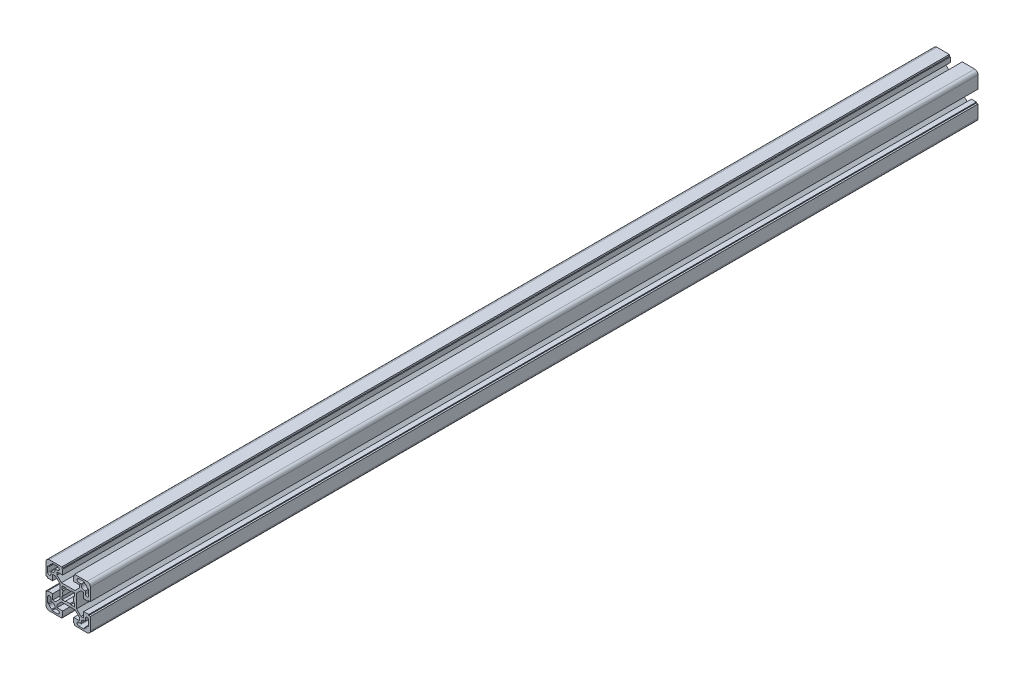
ISO-10303-21;
HEADER;
FILE_DESCRIPTION(('STEP AP214'),'2;1');
FILE_NAME('part.step','',(''),(''),'','','');
FILE_SCHEMA(('AUTOMOTIVE_DESIGN { 1 0 10303 214 1 1 1 1 }'));
ENDSEC;
DATA;
#1=APPLICATION_CONTEXT('core data for automotive mechanical design processes');
#2=APPLICATION_PROTOCOL_DEFINITION('international standard','automotive_design',2000,#1);
#3=PRODUCT_CONTEXT('',#1,'mechanical');
#4=PRODUCT('Part','Part','',(#3));
#5=PRODUCT_RELATED_PRODUCT_CATEGORY('part','',(#4));
#6=PRODUCT_DEFINITION_FORMATION('','',#4);
#7=PRODUCT_DEFINITION_CONTEXT('part definition',#1,'design');
#8=PRODUCT_DEFINITION('design','',#6,#7);
#9=PRODUCT_DEFINITION_SHAPE('','',#8);
#10=(LENGTH_UNIT() NAMED_UNIT(*) SI_UNIT(.MILLI.,.METRE.));
#11=(NAMED_UNIT(*) PLANE_ANGLE_UNIT() SI_UNIT($,.RADIAN.));
#12=(NAMED_UNIT(*) SI_UNIT($,.STERADIAN.) SOLID_ANGLE_UNIT());
#13=UNCERTAINTY_MEASURE_WITH_UNIT(LENGTH_MEASURE(1.E-05),#10,'distance_accuracy_value','');
#14=(GEOMETRIC_REPRESENTATION_CONTEXT(3) GLOBAL_UNCERTAINTY_ASSIGNED_CONTEXT((#13)) GLOBAL_UNIT_ASSIGNED_CONTEXT((#10,
#11,#12)) REPRESENTATION_CONTEXT('',''));
#15=CARTESIAN_POINT('',(0.,0.,0.));
#16=DIRECTION('',(0.,0.,1.));
#17=DIRECTION('',(1.,0.,0.));
#18=AXIS2_PLACEMENT_3D('',#15,#16,#17);
#19=CARTESIAN_POINT('',(-14.5000000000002,-11.75,800.));
#20=DIRECTION('',(0.,-1.,0.));
#21=DIRECTION('',(1.,0.,0.));
#22=AXIS2_PLACEMENT_3D('',#19,#20,#21);
#23=PLANE('',#22);
#24=DIRECTION('',(1.,0.,0.));
#25=VECTOR('',#24,1.);
#26=CARTESIAN_POINT('',(-14.5000000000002,-11.75,800.));
#27=LINE('',#26,#25);
#28=CARTESIAN_POINT('',(-14.5000000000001,-11.75,800.));
#29=VERTEX_POINT('',#28);
#30=CARTESIAN_POINT('',(-15.5000000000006,-11.75,800.));
#31=VERTEX_POINT('',#30);
#32=EDGE_CURVE('E806',#29,#31,#27,.F.);
#33=ORIENTED_EDGE('',*,*,#32,.T.);
#34=DIRECTION('',(0.,0.,1.));
#35=VECTOR('',#34,1.);
#36=CARTESIAN_POINT('',(-15.5000000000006,-11.75,800.));
#37=LINE('',#36,#35);
#38=CARTESIAN_POINT('',(-15.5000000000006,-11.75,0.));
#39=VERTEX_POINT('',#38);
#40=EDGE_CURVE('E804',#39,#31,#37,.T.);
#41=ORIENTED_EDGE('',*,*,#40,.F.);
#42=DIRECTION('',(1.,0.,0.));
#43=VECTOR('',#42,1.);
#44=CARTESIAN_POINT('',(-14.5000000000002,-11.75,0.));
#45=LINE('',#44,#43);
#46=CARTESIAN_POINT('',(-14.5000000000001,-11.75,0.));
#47=VERTEX_POINT('',#46);
#48=EDGE_CURVE('E20',#39,#47,#45,.T.);
#49=ORIENTED_EDGE('',*,*,#48,.T.);
#50=DIRECTION('',(0.,0.,-1.));
#51=VECTOR('',#50,1.);
#52=CARTESIAN_POINT('',(-14.5000000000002,-11.75,800.));
#53=LINE('',#52,#51);
#54=EDGE_CURVE('E801',#47,#29,#53,.F.);
#55=ORIENTED_EDGE('',*,*,#54,.T.);
#56=EDGE_LOOP('',(#33,#41,#49,#55));
#57=FACE_BOUND('',#56,.T.);
#58=ADVANCED_FACE('F17',(#57),#23,.T.);
#59=CARTESIAN_POINT('',(-11.7500000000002,-15.5,800.));
#60=DIRECTION('',(-1.,0.,0.));
#61=DIRECTION('',(0.,-1.,0.));
#62=AXIS2_PLACEMENT_3D('',#59,#60,#61);
#63=PLANE('',#62);
#64=DIRECTION('',(0.,-1.,0.));
#65=VECTOR('',#64,1.);
#66=CARTESIAN_POINT('',(-11.7500000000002,-15.5,800.));
#67=LINE('',#66,#65);
#68=CARTESIAN_POINT('',(-11.7500000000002,-15.5,800.));
#69=VERTEX_POINT('',#68);
#70=CARTESIAN_POINT('',(-11.7500000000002,-14.5,800.));
#71=VERTEX_POINT('',#70);
#72=EDGE_CURVE('E1218',#69,#71,#67,.F.);
#73=ORIENTED_EDGE('',*,*,#72,.T.);
#74=DIRECTION('',(0.,0.,-1.));
#75=VECTOR('',#74,1.);
#76=CARTESIAN_POINT('',(-11.7500000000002,-14.5,800.));
#77=LINE('',#76,#75);
#78=CARTESIAN_POINT('',(-11.7500000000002,-14.5,0.));
#79=VERTEX_POINT('',#78);
#80=EDGE_CURVE('E814',#71,#79,#77,.T.);
#81=ORIENTED_EDGE('',*,*,#80,.T.);
#82=DIRECTION('',(0.,-1.,0.));
#83=VECTOR('',#82,1.);
#84=CARTESIAN_POINT('',(-11.7500000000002,-15.5,0.));
#85=LINE('',#84,#83);
#86=CARTESIAN_POINT('',(-11.7500000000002,-15.5,0.));
#87=VERTEX_POINT('',#86);
#88=EDGE_CURVE('E819',#79,#87,#85,.T.);
#89=ORIENTED_EDGE('',*,*,#88,.T.);
#90=DIRECTION('',(0.,0.,-1.));
#91=VECTOR('',#90,1.);
#92=CARTESIAN_POINT('',(-11.7500000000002,-15.5,800.));
#93=LINE('',#92,#91);
#94=EDGE_CURVE('E1262',#69,#87,#93,.T.);
#95=ORIENTED_EDGE('',*,*,#94,.F.);
#96=EDGE_LOOP('',(#73,#81,#89,#95));
#97=FACE_BOUND('',#96,.T.);
#98=ADVANCED_FACE('F1555',(#97),#63,.T.);
#99=CARTESIAN_POINT('',(-14.5000000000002,-17.25,800.));
#100=DIRECTION('',(1.,0.,0.));
#101=DIRECTION('',(0.,0.,-1.));
#102=AXIS2_PLACEMENT_3D('',#99,#100,#101);
#103=PLANE('',#102);
#104=DIRECTION('',(0.,1.,0.));
#105=VECTOR('',#104,1.);
#106=CARTESIAN_POINT('',(-14.5000000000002,-17.25,800.));
#107=LINE('',#106,#105);
#108=CARTESIAN_POINT('',(-14.5000000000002,-17.25,800.));
#109=VERTEX_POINT('',#108);
#110=CARTESIAN_POINT('',(-14.5000000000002,-18.5,800.));
#111=VERTEX_POINT('',#110);
#112=EDGE_CURVE('E1214',#109,#111,#107,.F.);
#113=ORIENTED_EDGE('',*,*,#112,.T.);
#114=DIRECTION('',(0.,0.,1.));
#115=VECTOR('',#114,1.);
#116=CARTESIAN_POINT('',(-14.5000000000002,-18.5,800.));
#117=LINE('',#116,#115);
#118=CARTESIAN_POINT('',(-14.5000000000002,-18.5,0.));
#119=VERTEX_POINT('',#118);
#120=EDGE_CURVE('E1256',#119,#111,#117,.T.);
#121=ORIENTED_EDGE('',*,*,#120,.F.);
#122=DIRECTION('',(0.,1.,0.));
#123=VECTOR('',#122,1.);
#124=CARTESIAN_POINT('',(-14.5000000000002,-17.25,0.));
#125=LINE('',#124,#123);
#126=CARTESIAN_POINT('',(-14.5000000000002,-17.25,0.));
#127=VERTEX_POINT('',#126);
#128=EDGE_CURVE('E1216',#119,#127,#125,.T.);
#129=ORIENTED_EDGE('',*,*,#128,.T.);
#130=DIRECTION('',(0.,0.,-1.));
#131=VECTOR('',#130,1.);
#132=CARTESIAN_POINT('',(-14.5000000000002,-17.25,800.));
#133=LINE('',#132,#131);
#134=EDGE_CURVE('E1251',#127,#109,#133,.F.);
#135=ORIENTED_EDGE('',*,*,#134,.T.);
#136=EDGE_LOOP('',(#113,#121,#129,#135));
#137=FACE_BOUND('',#136,.T.);
#138=ADVANCED_FACE('F1560',(#137),#103,.T.);
#139=CARTESIAN_POINT('',(-18.5000000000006,-14.5000000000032,800.));
#140=DIRECTION('',(0.,1.,0.));
#141=DIRECTION('',(0.,0.,1.));
#142=AXIS2_PLACEMENT_3D('',#139,#140,#141);
#143=PLANE('',#142);
#144=DIRECTION('',(1.,0.,0.));
#145=VECTOR('',#144,1.);
#146=CARTESIAN_POINT('',(-18.5000000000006,-14.5000000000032,800.));
#147=LINE('',#146,#145);
#148=CARTESIAN_POINT('',(-18.5000000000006,-14.5000000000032,800.));
#149=VERTEX_POINT('',#148);
#150=CARTESIAN_POINT('',(-17.2500000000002,-14.5000000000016,800.));
#151=VERTEX_POINT('',#150);
#152=EDGE_CURVE('E1210',#149,#151,#147,.T.);
#153=ORIENTED_EDGE('',*,*,#152,.T.);
#154=DIRECTION('',(0.,0.,-1.));
#155=VECTOR('',#154,1.);
#156=CARTESIAN_POINT('',(-17.2500000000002,-14.5,800.));
#157=LINE('',#156,#155);
#158=CARTESIAN_POINT('',(-17.2500000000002,-14.5000000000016,0.));
#159=VERTEX_POINT('',#158);
#160=EDGE_CURVE('E1248',#151,#159,#157,.T.);
#161=ORIENTED_EDGE('',*,*,#160,.T.);
#162=DIRECTION('',(1.,0.,0.));
#163=VECTOR('',#162,1.);
#164=CARTESIAN_POINT('',(-18.5000000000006,-14.5000000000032,0.));
#165=LINE('',#164,#163);
#166=CARTESIAN_POINT('',(-18.5000000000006,-14.5000000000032,0.));
#167=VERTEX_POINT('',#166);
#168=EDGE_CURVE('E1212',#159,#167,#165,.F.);
#169=ORIENTED_EDGE('',*,*,#168,.T.);
#170=DIRECTION('',(0.,0.,-1.));
#171=VECTOR('',#170,1.);
#172=CARTESIAN_POINT('',(-18.5000000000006,-14.5000000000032,800.));
#173=LINE('',#172,#171);
#174=EDGE_CURVE('E1242',#149,#167,#173,.T.);
#175=ORIENTED_EDGE('',*,*,#174,.F.);
#176=EDGE_LOOP('',(#153,#161,#169,#175));
#177=FACE_BOUND('',#176,.T.);
#178=ADVANCED_FACE('F1569',(#177),#143,.T.);
#179=CARTESIAN_POINT('',(18.5000000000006,-14.5000000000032,800.));
#180=DIRECTION('',(0.,1.,0.));
#181=DIRECTION('',(0.,0.,1.));
#182=AXIS2_PLACEMENT_3D('',#179,#180,#181);
#183=PLANE('',#182);
#184=DIRECTION('',(1.,0.,0.));
#185=VECTOR('',#184,1.);
#186=CARTESIAN_POINT('',(18.5000000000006,-14.5000000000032,800.));
#187=LINE('',#186,#185);
#188=CARTESIAN_POINT('',(17.2500000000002,-14.5000000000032,800.));
#189=VERTEX_POINT('',#188);
#190=CARTESIAN_POINT('',(18.5000000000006,-14.5000000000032,800.));
#191=VERTEX_POINT('',#190);
#192=EDGE_CURVE('E1206',#189,#191,#187,.T.);
#193=ORIENTED_EDGE('',*,*,#192,.T.);
#194=DIRECTION('',(0.,0.,1.));
#195=VECTOR('',#194,1.);
#196=CARTESIAN_POINT('',(18.5000000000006,-14.5000000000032,800.));
#197=LINE('',#196,#195);
#198=CARTESIAN_POINT('',(18.5000000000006,-14.5000000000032,0.));
#199=VERTEX_POINT('',#198);
#200=EDGE_CURVE('E1947',#199,#191,#197,.T.);
#201=ORIENTED_EDGE('',*,*,#200,.F.);
#202=DIRECTION('',(1.,0.,0.));
#203=VECTOR('',#202,1.);
#204=CARTESIAN_POINT('',(18.5000000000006,-14.5000000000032,0.));
#205=LINE('',#204,#203);
#206=CARTESIAN_POINT('',(17.2500000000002,-14.5000000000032,0.));
#207=VERTEX_POINT('',#206);
#208=EDGE_CURVE('E1208',#199,#207,#205,.F.);
#209=ORIENTED_EDGE('',*,*,#208,.T.);
#210=DIRECTION('',(0.,0.,-1.));
#211=VECTOR('',#210,1.);
#212=CARTESIAN_POINT('',(17.2500000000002,-14.5000000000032,800.));
#213=LINE('',#212,#211);
#214=EDGE_CURVE('E1952',#207,#189,#213,.F.);
#215=ORIENTED_EDGE('',*,*,#214,.T.);
#216=EDGE_LOOP('',(#193,#201,#209,#215));
#217=FACE_BOUND('',#216,.T.);
#218=ADVANCED_FACE('F2472',(#217),#183,.T.);
#219=CARTESIAN_POINT('',(14.5000000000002,-17.25,800.));
#220=DIRECTION('',(-1.,0.,0.));
#221=DIRECTION('',(0.,0.,1.));
#222=AXIS2_PLACEMENT_3D('',#219,#220,#221);
#223=PLANE('',#222);
#224=DIRECTION('',(0.,1.,0.));
#225=VECTOR('',#224,1.);
#226=CARTESIAN_POINT('',(14.5000000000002,-17.25,800.));
#227=LINE('',#226,#225);
#228=CARTESIAN_POINT('',(14.5000000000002,-18.5,800.));
#229=VERTEX_POINT('',#228);
#230=CARTESIAN_POINT('',(14.5000000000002,-17.25,800.));
#231=VERTEX_POINT('',#230);
#232=EDGE_CURVE('E1202',#229,#231,#227,.T.);
#233=ORIENTED_EDGE('',*,*,#232,.T.);
#234=DIRECTION('',(0.,0.,-1.));
#235=VECTOR('',#234,1.);
#236=CARTESIAN_POINT('',(14.5000000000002,-17.25,800.));
#237=LINE('',#236,#235);
#238=CARTESIAN_POINT('',(14.5000000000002,-17.25,0.));
#239=VERTEX_POINT('',#238);
#240=EDGE_CURVE('E1955',#231,#239,#237,.T.);
#241=ORIENTED_EDGE('',*,*,#240,.T.);
#242=DIRECTION('',(0.,1.,0.));
#243=VECTOR('',#242,1.);
#244=CARTESIAN_POINT('',(14.5000000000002,-17.25,0.));
#245=LINE('',#244,#243);
#246=CARTESIAN_POINT('',(14.5000000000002,-18.5,0.));
#247=VERTEX_POINT('',#246);
#248=EDGE_CURVE('E1204',#239,#247,#245,.F.);
#249=ORIENTED_EDGE('',*,*,#248,.T.);
#250=DIRECTION('',(0.,0.,1.));
#251=VECTOR('',#250,1.);
#252=CARTESIAN_POINT('',(14.5000000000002,-18.5,800.));
#253=LINE('',#252,#251);
#254=EDGE_CURVE('E1958',#229,#247,#253,.F.);
#255=ORIENTED_EDGE('',*,*,#254,.F.);
#256=EDGE_LOOP('',(#233,#241,#249,#255));
#257=FACE_BOUND('',#256,.T.);
#258=ADVANCED_FACE('F2468',(#257),#223,.T.);
#259=CARTESIAN_POINT('',(11.7500000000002,-15.5,800.));
#260=DIRECTION('',(1.,0.,0.));
#261=DIRECTION('',(0.,1.,0.));
#262=AXIS2_PLACEMENT_3D('',#259,#260,#261);
#263=PLANE('',#262);
#264=DIRECTION('',(0.,1.,0.));
#265=VECTOR('',#264,1.);
#266=CARTESIAN_POINT('',(11.7500000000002,-15.5,800.));
#267=LINE('',#266,#265);
#268=CARTESIAN_POINT('',(11.7500000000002,-14.5,800.));
#269=VERTEX_POINT('',#268);
#270=CARTESIAN_POINT('',(11.7500000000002,-15.5,800.));
#271=VERTEX_POINT('',#270);
#272=EDGE_CURVE('E1198',#269,#271,#267,.F.);
#273=ORIENTED_EDGE('',*,*,#272,.T.);
#274=DIRECTION('',(0.,0.,-1.));
#275=VECTOR('',#274,1.);
#276=CARTESIAN_POINT('',(11.7500000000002,-15.5,800.));
#277=LINE('',#276,#275);
#278=CARTESIAN_POINT('',(11.7500000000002,-15.5,0.));
#279=VERTEX_POINT('',#278);
#280=EDGE_CURVE('E1964',#279,#271,#277,.F.);
#281=ORIENTED_EDGE('',*,*,#280,.F.);
#282=DIRECTION('',(0.,1.,0.));
#283=VECTOR('',#282,1.);
#284=CARTESIAN_POINT('',(11.7500000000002,-15.5,0.));
#285=LINE('',#284,#283);
#286=CARTESIAN_POINT('',(11.7500000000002,-14.5,0.));
#287=VERTEX_POINT('',#286);
#288=EDGE_CURVE('E1200',#279,#287,#285,.T.);
#289=ORIENTED_EDGE('',*,*,#288,.T.);
#290=DIRECTION('',(0.,0.,-1.));
#291=VECTOR('',#290,1.);
#292=CARTESIAN_POINT('',(11.7500000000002,-14.5,800.));
#293=LINE('',#292,#291);
#294=EDGE_CURVE('E1969',#287,#269,#293,.F.);
#295=ORIENTED_EDGE('',*,*,#294,.T.);
#296=EDGE_LOOP('',(#273,#281,#289,#295));
#297=FACE_BOUND('',#296,.T.);
#298=ADVANCED_FACE('F2465',(#297),#263,.T.);
#299=CARTESIAN_POINT('',(14.5000000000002,-11.75,800.));
#300=DIRECTION('',(0.,-1.,0.));
#301=DIRECTION('',(1.,0.,0.));
#302=AXIS2_PLACEMENT_3D('',#299,#300,#301);
#303=PLANE('',#302);
#304=DIRECTION('',(1.,0.,0.));
#305=VECTOR('',#304,1.);
#306=CARTESIAN_POINT('',(14.5000000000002,-11.75,800.));
#307=LINE('',#306,#305);
#308=CARTESIAN_POINT('',(15.5000000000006,-11.75,800.));
#309=VERTEX_POINT('',#308);
#310=CARTESIAN_POINT('',(14.5000000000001,-11.75,800.));
#311=VERTEX_POINT('',#310);
#312=EDGE_CURVE('E1194',#309,#311,#307,.F.);
#313=ORIENTED_EDGE('',*,*,#312,.T.);
#314=DIRECTION('',(0.,0.,-1.));
#315=VECTOR('',#314,1.);
#316=CARTESIAN_POINT('',(14.5000000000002,-11.75,800.));
#317=LINE('',#316,#315);
#318=CARTESIAN_POINT('',(14.5000000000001,-11.75,0.));
#319=VERTEX_POINT('',#318);
#320=EDGE_CURVE('E1940',#311,#319,#317,.T.);
#321=ORIENTED_EDGE('',*,*,#320,.T.);
#322=DIRECTION('',(1.,0.,0.));
#323=VECTOR('',#322,1.);
#324=CARTESIAN_POINT('',(14.5000000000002,-11.75,0.));
#325=LINE('',#324,#323);
#326=CARTESIAN_POINT('',(15.5000000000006,-11.75,0.));
#327=VERTEX_POINT('',#326);
#328=EDGE_CURVE('E1196',#319,#327,#325,.T.);
#329=ORIENTED_EDGE('',*,*,#328,.T.);
#330=DIRECTION('',(0.,0.,-1.));
#331=VECTOR('',#330,1.);
#332=CARTESIAN_POINT('',(15.5000000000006,-11.75,800.));
#333=LINE('',#332,#331);
#334=EDGE_CURVE('E1237',#309,#327,#333,.T.);
#335=ORIENTED_EDGE('',*,*,#334,.F.);
#336=EDGE_LOOP('',(#313,#321,#329,#335));
#337=FACE_BOUND('',#336,.T.);
#338=ADVANCED_FACE('F1939',(#337),#303,.T.);
#339=CARTESIAN_POINT('',(5.80000000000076,-18.5000000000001,800.));
#340=DIRECTION('',(1.,0.,0.));
#341=DIRECTION('',(0.,0.,-1.));
#342=AXIS2_PLACEMENT_3D('',#339,#340,#341);
#343=PLANE('',#342);
#344=DIRECTION('',(0.,0.,1.));
#345=VECTOR('',#344,1.);
#346=CARTESIAN_POINT('',(5.80000000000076,-20.,800.));
#347=LINE('',#346,#345);
#348=CARTESIAN_POINT('',(5.80000000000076,-20.,0.));
#349=VERTEX_POINT('',#348);
#350=CARTESIAN_POINT('',(5.80000000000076,-20.,800.));
#351=VERTEX_POINT('',#350);
#352=EDGE_CURVE('E1973',#349,#351,#347,.T.);
#353=ORIENTED_EDGE('',*,*,#352,.T.);
#354=DIRECTION('',(0.,1.,0.));
#355=VECTOR('',#354,1.);
#356=CARTESIAN_POINT('',(5.80000000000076,-17.,800.));
#357=LINE('',#356,#355);
#358=CARTESIAN_POINT('',(5.80000000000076,-18.5000000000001,800.));
#359=VERTEX_POINT('',#358);
#360=EDGE_CURVE('E1192',#359,#351,#357,.F.);
#361=ORIENTED_EDGE('',*,*,#360,.F.);
#362=DIRECTION('',(0.,0.,1.));
#363=VECTOR('',#362,1.);
#364=CARTESIAN_POINT('',(5.80000000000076,-18.5000000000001,800.));
#365=LINE('',#364,#363);
#366=CARTESIAN_POINT('',(5.80000000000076,-18.5000000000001,0.));
#367=VERTEX_POINT('',#366);
#368=EDGE_CURVE('E1116',#359,#367,#365,.F.);
#369=ORIENTED_EDGE('',*,*,#368,.T.);
#370=DIRECTION('',(0.,1.,0.));
#371=VECTOR('',#370,1.);
#372=CARTESIAN_POINT('',(5.80000000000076,-17.,0.));
#373=LINE('',#372,#371);
#374=EDGE_CURVE('E1190',#349,#367,#373,.T.);
#375=ORIENTED_EDGE('',*,*,#374,.F.);
#376=EDGE_LOOP('',(#353,#361,#369,#375));
#377=FACE_BOUND('',#376,.T.);
#378=ADVANCED_FACE('F2286',(#377),#343,.F.);
#379=CARTESIAN_POINT('',(20.,-5.79999999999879,800.));
#380=DIRECTION('',(0.,-1.,0.));
#381=DIRECTION('',(0.,0.,-1.));
#382=AXIS2_PLACEMENT_3D('',#379,#380,#381);
#383=PLANE('',#382);
#384=DIRECTION('',(0.,0.,1.));
#385=VECTOR('',#384,1.);
#386=CARTESIAN_POINT('',(18.5,-5.79999999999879,800.));
#387=LINE('',#386,#385);
#388=CARTESIAN_POINT('',(18.5,-5.79999999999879,0.));
#389=VERTEX_POINT('',#388);
#390=CARTESIAN_POINT('',(18.5,-5.79999999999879,800.));
#391=VERTEX_POINT('',#390);
#392=EDGE_CURVE('E1185',#389,#391,#387,.T.);
#393=ORIENTED_EDGE('',*,*,#392,.T.);
#394=DIRECTION('',(1.,0.,0.));
#395=VECTOR('',#394,1.);
#396=CARTESIAN_POINT('',(17.,-5.79999999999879,800.));
#397=LINE('',#396,#395);
#398=CARTESIAN_POINT('',(20.,-5.79999999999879,800.));
#399=VERTEX_POINT('',#398);
#400=EDGE_CURVE('E1188',#399,#391,#397,.F.);
#401=ORIENTED_EDGE('',*,*,#400,.F.);
#402=DIRECTION('',(0.,0.,1.));
#403=VECTOR('',#402,1.);
#404=CARTESIAN_POINT('',(20.,-5.79999999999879,800.));
#405=LINE('',#404,#403);
#406=CARTESIAN_POINT('',(20.,-5.79999999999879,0.));
#407=VERTEX_POINT('',#406);
#408=EDGE_CURVE('E1981',#399,#407,#405,.F.);
#409=ORIENTED_EDGE('',*,*,#408,.T.);
#410=DIRECTION('',(1.,0.,0.));
#411=VECTOR('',#410,1.);
#412=CARTESIAN_POINT('',(17.,-5.79999999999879,0.));
#413=LINE('',#412,#411);
#414=EDGE_CURVE('E1186',#389,#407,#413,.T.);
#415=ORIENTED_EDGE('',*,*,#414,.F.);
#416=EDGE_LOOP('',(#393,#401,#409,#415));
#417=FACE_BOUND('',#416,.T.);
#418=ADVANCED_FACE('F2294',(#417),#383,.F.);
#419=CARTESIAN_POINT('',(18.5,-5.79999999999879,800.));
#420=DIRECTION('',(-1.,0.,0.));
#421=DIRECTION('',(0.,0.,1.));
#422=AXIS2_PLACEMENT_3D('',#419,#420,#421);
#423=PLANE('',#422);
#424=DIRECTION('',(0.,0.,-1.));
#425=VECTOR('',#424,1.);
#426=CARTESIAN_POINT('',(18.5,-4.99999999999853,800.));
#427=LINE('',#426,#425);
#428=CARTESIAN_POINT('',(18.5,-4.99999999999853,0.));
#429=VERTEX_POINT('',#428);
#430=CARTESIAN_POINT('',(18.5,-4.99999999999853,800.));
#431=VERTEX_POINT('',#430);
#432=EDGE_CURVE('E1984',#429,#431,#427,.F.);
#433=ORIENTED_EDGE('',*,*,#432,.T.);
#434=DIRECTION('',(0.,1.,0.));
#435=VECTOR('',#434,1.);
#436=CARTESIAN_POINT('',(18.5,-17.,800.));
#437=LINE('',#436,#435);
#438=EDGE_CURVE('E1183',#391,#431,#437,.T.);
#439=ORIENTED_EDGE('',*,*,#438,.F.);
#440=ORIENTED_EDGE('',*,*,#392,.F.);
#441=DIRECTION('',(0.,1.,0.));
#442=VECTOR('',#441,1.);
#443=CARTESIAN_POINT('',(18.5,-17.,0.));
#444=LINE('',#443,#442);
#445=EDGE_CURVE('E1180',#429,#389,#444,.F.);
#446=ORIENTED_EDGE('',*,*,#445,.F.);
#447=EDGE_LOOP('',(#433,#439,#440,#446));
#448=FACE_BOUND('',#447,.T.);
#449=ADVANCED_FACE('F2297',(#448),#423,.F.);
#450=CARTESIAN_POINT('',(18.5,5.79999999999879,800.));
#451=DIRECTION('',(-1.,0.,0.));
#452=DIRECTION('',(0.,0.,1.));
#453=AXIS2_PLACEMENT_3D('',#450,#451,#452);
#454=PLANE('',#453);
#455=DIRECTION('',(0.,0.,1.));
#456=VECTOR('',#455,1.);
#457=CARTESIAN_POINT('',(18.5,5.79999999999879,800.));
#458=LINE('',#457,#456);
#459=CARTESIAN_POINT('',(18.5,5.79999999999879,0.));
#460=VERTEX_POINT('',#459);
#461=CARTESIAN_POINT('',(18.5,5.79999999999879,800.));
#462=VERTEX_POINT('',#461);
#463=EDGE_CURVE('E1175',#460,#462,#458,.T.);
#464=ORIENTED_EDGE('',*,*,#463,.T.);
#465=DIRECTION('',(0.,1.,0.));
#466=VECTOR('',#465,1.);
#467=CARTESIAN_POINT('',(18.5,-17.,800.));
#468=LINE('',#467,#466);
#469=CARTESIAN_POINT('',(18.5,4.99999999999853,800.));
#470=VERTEX_POINT('',#469);
#471=EDGE_CURVE('E1178',#470,#462,#468,.T.);
#472=ORIENTED_EDGE('',*,*,#471,.F.);
#473=DIRECTION('',(0.,0.,1.));
#474=VECTOR('',#473,1.);
#475=CARTESIAN_POINT('',(18.5,4.99999999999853,800.));
#476=LINE('',#475,#474);
#477=CARTESIAN_POINT('',(18.5,4.99999999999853,0.));
#478=VERTEX_POINT('',#477);
#479=EDGE_CURVE('E2011',#470,#478,#476,.F.);
#480=ORIENTED_EDGE('',*,*,#479,.T.);
#481=DIRECTION('',(0.,1.,0.));
#482=VECTOR('',#481,1.);
#483=CARTESIAN_POINT('',(18.5,-17.,0.));
#484=LINE('',#483,#482);
#485=EDGE_CURVE('E1176',#460,#478,#484,.F.);
#486=ORIENTED_EDGE('',*,*,#485,.F.);
#487=EDGE_LOOP('',(#464,#472,#480,#486));
#488=FACE_BOUND('',#487,.T.);
#489=ADVANCED_FACE('F2319',(#488),#454,.F.);
#490=CARTESIAN_POINT('',(20.,5.79999999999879,800.));
#491=DIRECTION('',(0.,1.,0.));
#492=DIRECTION('',(0.,0.,1.));
#493=AXIS2_PLACEMENT_3D('',#490,#491,#492);
#494=PLANE('',#493);
#495=DIRECTION('',(0.,0.,1.));
#496=VECTOR('',#495,1.);
#497=CARTESIAN_POINT('',(20.,5.79999999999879,800.));
#498=LINE('',#497,#496);
#499=CARTESIAN_POINT('',(20.,5.79999999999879,0.));
#500=VERTEX_POINT('',#499);
#501=CARTESIAN_POINT('',(20.,5.79999999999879,800.));
#502=VERTEX_POINT('',#501);
#503=EDGE_CURVE('E2014',#500,#502,#498,.T.);
#504=ORIENTED_EDGE('',*,*,#503,.T.);
#505=DIRECTION('',(1.,0.,0.));
#506=VECTOR('',#505,1.);
#507=CARTESIAN_POINT('',(17.,5.79999999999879,800.));
#508=LINE('',#507,#506);
#509=EDGE_CURVE('E1173',#462,#502,#508,.T.);
#510=ORIENTED_EDGE('',*,*,#509,.F.);
#511=ORIENTED_EDGE('',*,*,#463,.F.);
#512=DIRECTION('',(1.,0.,0.));
#513=VECTOR('',#512,1.);
#514=CARTESIAN_POINT('',(17.,5.79999999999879,0.));
#515=LINE('',#514,#513);
#516=EDGE_CURVE('E1170',#500,#460,#515,.F.);
#517=ORIENTED_EDGE('',*,*,#516,.F.);
#518=EDGE_LOOP('',(#504,#510,#511,#517));
#519=FACE_BOUND('',#518,.T.);
#520=ADVANCED_FACE('F2323',(#519),#494,.F.);
#521=CARTESIAN_POINT('',(5.80000000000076,18.5000000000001,800.));
#522=DIRECTION('',(1.,0.,0.));
#523=DIRECTION('',(0.,0.,-1.));
#524=AXIS2_PLACEMENT_3D('',#521,#522,#523);
#525=PLANE('',#524);
#526=DIRECTION('',(0.,0.,-1.));
#527=VECTOR('',#526,1.);
#528=CARTESIAN_POINT('',(5.80000000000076,18.5000000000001,800.));
#529=LINE('',#528,#527);
#530=CARTESIAN_POINT('',(5.80000000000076,18.5000000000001,0.));
#531=VERTEX_POINT('',#530);
#532=CARTESIAN_POINT('',(5.80000000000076,18.5000000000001,800.));
#533=VERTEX_POINT('',#532);
#534=EDGE_CURVE('E1165',#531,#533,#529,.F.);
#535=ORIENTED_EDGE('',*,*,#534,.T.);
#536=DIRECTION('',(0.,1.,0.));
#537=VECTOR('',#536,1.);
#538=CARTESIAN_POINT('',(5.80000000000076,-17.,800.));
#539=LINE('',#538,#537);
#540=CARTESIAN_POINT('',(5.80000000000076,20.,800.));
#541=VERTEX_POINT('',#540);
#542=EDGE_CURVE('E1168',#541,#533,#539,.F.);
#543=ORIENTED_EDGE('',*,*,#542,.F.);
#544=DIRECTION('',(0.,0.,-1.));
#545=VECTOR('',#544,1.);
#546=CARTESIAN_POINT('',(5.80000000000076,20.,800.));
#547=LINE('',#546,#545);
#548=CARTESIAN_POINT('',(5.80000000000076,20.,0.));
#549=VERTEX_POINT('',#548);
#550=EDGE_CURVE('E2022',#541,#549,#547,.T.);
#551=ORIENTED_EDGE('',*,*,#550,.T.);
#552=DIRECTION('',(0.,1.,0.));
#553=VECTOR('',#552,1.);
#554=CARTESIAN_POINT('',(5.80000000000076,-17.,0.));
#555=LINE('',#554,#553);
#556=EDGE_CURVE('E1166',#531,#549,#555,.T.);
#557=ORIENTED_EDGE('',*,*,#556,.F.);
#558=EDGE_LOOP('',(#535,#543,#551,#557));
#559=FACE_BOUND('',#558,.T.);
#560=ADVANCED_FACE('F2334',(#559),#525,.F.);
#561=CARTESIAN_POINT('',(5.00000000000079,18.5000000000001,800.));
#562=DIRECTION('',(0.,-1.,0.));
#563=DIRECTION('',(0.,0.,-1.));
#564=AXIS2_PLACEMENT_3D('',#561,#562,#563);
#565=PLANE('',#564);
#566=DIRECTION('',(0.,0.,1.));
#567=VECTOR('',#566,1.);
#568=CARTESIAN_POINT('',(5.00000000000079,18.5000000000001,800.));
#569=LINE('',#568,#567);
#570=CARTESIAN_POINT('',(5.00000000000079,18.5000000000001,0.));
#571=VERTEX_POINT('',#570);
#572=CARTESIAN_POINT('',(5.00000000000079,18.5000000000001,800.));
#573=VERTEX_POINT('',#572);
#574=EDGE_CURVE('E2025',#571,#573,#569,.T.);
#575=ORIENTED_EDGE('',*,*,#574,.T.);
#576=DIRECTION('',(1.,0.,0.));
#577=VECTOR('',#576,1.);
#578=CARTESIAN_POINT('',(17.,18.5000000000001,800.));
#579=LINE('',#578,#577);
#580=EDGE_CURVE('E1163',#533,#573,#579,.F.);
#581=ORIENTED_EDGE('',*,*,#580,.F.);
#582=ORIENTED_EDGE('',*,*,#534,.F.);
#583=DIRECTION('',(1.,0.,0.));
#584=VECTOR('',#583,1.);
#585=CARTESIAN_POINT('',(17.,18.5000000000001,0.));
#586=LINE('',#585,#584);
#587=EDGE_CURVE('E1160',#571,#531,#586,.T.);
#588=ORIENTED_EDGE('',*,*,#587,.F.);
#589=EDGE_LOOP('',(#575,#581,#582,#588));
#590=FACE_BOUND('',#589,.T.);
#591=ADVANCED_FACE('F2338',(#590),#565,.F.);
#592=CARTESIAN_POINT('',(-5.00000000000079,18.5000000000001,800.));
#593=DIRECTION('',(0.,-1.,0.));
#594=DIRECTION('',(0.,0.,-1.));
#595=AXIS2_PLACEMENT_3D('',#592,#593,#594);
#596=PLANE('',#595);
#597=DIRECTION('',(0.,0.,1.));
#598=VECTOR('',#597,1.);
#599=CARTESIAN_POINT('',(-5.80000000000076,18.5000000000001,800.));
#600=LINE('',#599,#598);
#601=CARTESIAN_POINT('',(-5.80000000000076,18.5000000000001,0.));
#602=VERTEX_POINT('',#601);
#603=CARTESIAN_POINT('',(-5.80000000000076,18.5000000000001,800.));
#604=VERTEX_POINT('',#603);
#605=EDGE_CURVE('E1155',#602,#604,#600,.T.);
#606=ORIENTED_EDGE('',*,*,#605,.T.);
#607=DIRECTION('',(1.,0.,0.));
#608=VECTOR('',#607,1.);
#609=CARTESIAN_POINT('',(17.,18.5000000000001,800.));
#610=LINE('',#609,#608);
#611=CARTESIAN_POINT('',(-5.00000000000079,18.5000000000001,800.));
#612=VERTEX_POINT('',#611);
#613=EDGE_CURVE('E1158',#612,#604,#610,.F.);
#614=ORIENTED_EDGE('',*,*,#613,.F.);
#615=DIRECTION('',(0.,0.,1.));
#616=VECTOR('',#615,1.);
#617=CARTESIAN_POINT('',(-5.00000000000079,18.5000000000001,800.));
#618=LINE('',#617,#616);
#619=CARTESIAN_POINT('',(-5.00000000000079,18.5000000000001,0.));
#620=VERTEX_POINT('',#619);
#621=EDGE_CURVE('E2052',#612,#620,#618,.F.);
#622=ORIENTED_EDGE('',*,*,#621,.T.);
#623=DIRECTION('',(1.,0.,0.));
#624=VECTOR('',#623,1.);
#625=CARTESIAN_POINT('',(17.,18.5000000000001,0.));
#626=LINE('',#625,#624);
#627=EDGE_CURVE('E1156',#602,#620,#626,.T.);
#628=ORIENTED_EDGE('',*,*,#627,.F.);
#629=EDGE_LOOP('',(#606,#614,#622,#628));
#630=FACE_BOUND('',#629,.T.);
#631=ADVANCED_FACE('F2360',(#630),#596,.F.);
#632=CARTESIAN_POINT('',(-5.80000000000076,18.5000000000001,800.));
#633=DIRECTION('',(-1.,0.,0.));
#634=DIRECTION('',(0.,0.,1.));
#635=AXIS2_PLACEMENT_3D('',#632,#633,#634);
#636=PLANE('',#635);
#637=DIRECTION('',(0.,0.,1.));
#638=VECTOR('',#637,1.);
#639=CARTESIAN_POINT('',(-5.80000000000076,20.,800.));
#640=LINE('',#639,#638);
#641=CARTESIAN_POINT('',(-5.80000000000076,20.,0.));
#642=VERTEX_POINT('',#641);
#643=CARTESIAN_POINT('',(-5.80000000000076,20.,800.));
#644=VERTEX_POINT('',#643);
#645=EDGE_CURVE('E2055',#642,#644,#640,.T.);
#646=ORIENTED_EDGE('',*,*,#645,.T.);
#647=DIRECTION('',(0.,1.,0.));
#648=VECTOR('',#647,1.);
#649=CARTESIAN_POINT('',(-5.80000000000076,-17.,800.));
#650=LINE('',#649,#648);
#651=EDGE_CURVE('E1153',#604,#644,#650,.T.);
#652=ORIENTED_EDGE('',*,*,#651,.F.);
#653=ORIENTED_EDGE('',*,*,#605,.F.);
#654=DIRECTION('',(0.,1.,0.));
#655=VECTOR('',#654,1.);
#656=CARTESIAN_POINT('',(-5.80000000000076,-17.,0.));
#657=LINE('',#656,#655);
#658=EDGE_CURVE('E1150',#642,#602,#657,.F.);
#659=ORIENTED_EDGE('',*,*,#658,.F.);
#660=EDGE_LOOP('',(#646,#652,#653,#659));
#661=FACE_BOUND('',#660,.T.);
#662=ADVANCED_FACE('F2364',(#661),#636,.F.);
#663=CARTESIAN_POINT('',(-20.,5.79999999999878,800.));
#664=DIRECTION('',(0.,1.,0.));
#665=DIRECTION('',(0.,0.,1.));
#666=AXIS2_PLACEMENT_3D('',#663,#664,#665);
#667=PLANE('',#666);
#668=DIRECTION('',(0.,0.,-1.));
#669=VECTOR('',#668,1.);
#670=CARTESIAN_POINT('',(-18.5,5.79999999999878,800.));
#671=LINE('',#670,#669);
#672=CARTESIAN_POINT('',(-18.5,5.79999999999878,0.));
#673=VERTEX_POINT('',#672);
#674=CARTESIAN_POINT('',(-18.5,5.79999999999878,800.));
#675=VERTEX_POINT('',#674);
#676=EDGE_CURVE('E1145',#673,#675,#671,.F.);
#677=ORIENTED_EDGE('',*,*,#676,.T.);
#678=DIRECTION('',(1.,0.,0.));
#679=VECTOR('',#678,1.);
#680=CARTESIAN_POINT('',(17.,5.79999999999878,800.));
#681=LINE('',#680,#679);
#682=CARTESIAN_POINT('',(-20.,5.79999999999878,800.));
#683=VERTEX_POINT('',#682);
#684=EDGE_CURVE('E1148',#683,#675,#681,.T.);
#685=ORIENTED_EDGE('',*,*,#684,.F.);
#686=DIRECTION('',(0.,0.,1.));
#687=VECTOR('',#686,1.);
#688=CARTESIAN_POINT('',(-20.,5.79999999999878,800.));
#689=LINE('',#688,#687);
#690=CARTESIAN_POINT('',(-20.,5.79999999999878,0.));
#691=VERTEX_POINT('',#690);
#692=EDGE_CURVE('E2063',#683,#691,#689,.F.);
#693=ORIENTED_EDGE('',*,*,#692,.T.);
#694=DIRECTION('',(1.,0.,0.));
#695=VECTOR('',#694,1.);
#696=CARTESIAN_POINT('',(17.,5.79999999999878,0.));
#697=LINE('',#696,#695);
#698=EDGE_CURVE('E1146',#673,#691,#697,.F.);
#699=ORIENTED_EDGE('',*,*,#698,.F.);
#700=EDGE_LOOP('',(#677,#685,#693,#699));
#701=FACE_BOUND('',#700,.T.);
#702=ADVANCED_FACE('F2375',(#701),#667,.F.);
#703=CARTESIAN_POINT('',(-18.5,5.79999999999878,800.));
#704=DIRECTION('',(1.,0.,0.));
#705=DIRECTION('',(0.,0.,-1.));
#706=AXIS2_PLACEMENT_3D('',#703,#704,#705);
#707=PLANE('',#706);
#708=DIRECTION('',(0.,0.,1.));
#709=VECTOR('',#708,1.);
#710=CARTESIAN_POINT('',(-18.5,4.99999999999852,800.));
#711=LINE('',#710,#709);
#712=CARTESIAN_POINT('',(-18.5,4.99999999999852,0.));
#713=VERTEX_POINT('',#712);
#714=CARTESIAN_POINT('',(-18.5,4.99999999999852,800.));
#715=VERTEX_POINT('',#714);
#716=EDGE_CURVE('E2066',#713,#715,#711,.T.);
#717=ORIENTED_EDGE('',*,*,#716,.T.);
#718=DIRECTION('',(0.,1.,0.));
#719=VECTOR('',#718,1.);
#720=CARTESIAN_POINT('',(-18.5,-17.,800.));
#721=LINE('',#720,#719);
#722=EDGE_CURVE('E1143',#675,#715,#721,.F.);
#723=ORIENTED_EDGE('',*,*,#722,.F.);
#724=ORIENTED_EDGE('',*,*,#676,.F.);
#725=DIRECTION('',(0.,1.,0.));
#726=VECTOR('',#725,1.);
#727=CARTESIAN_POINT('',(-18.5,-17.,0.));
#728=LINE('',#727,#726);
#729=EDGE_CURVE('E1140',#713,#673,#728,.T.);
#730=ORIENTED_EDGE('',*,*,#729,.F.);
#731=EDGE_LOOP('',(#717,#723,#724,#730));
#732=FACE_BOUND('',#731,.T.);
#733=ADVANCED_FACE('F2379',(#732),#707,.F.);
#734=CARTESIAN_POINT('',(-18.5,-5.79999999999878,800.));
#735=DIRECTION('',(1.,0.,0.));
#736=DIRECTION('',(0.,0.,-1.));
#737=AXIS2_PLACEMENT_3D('',#734,#735,#736);
#738=PLANE('',#737);
#739=DIRECTION('',(0.,0.,-1.));
#740=VECTOR('',#739,1.);
#741=CARTESIAN_POINT('',(-18.5,-5.79999999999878,800.));
#742=LINE('',#741,#740);
#743=CARTESIAN_POINT('',(-18.5,-5.79999999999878,0.));
#744=VERTEX_POINT('',#743);
#745=CARTESIAN_POINT('',(-18.5,-5.79999999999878,800.));
#746=VERTEX_POINT('',#745);
#747=EDGE_CURVE('E1135',#744,#746,#742,.F.);
#748=ORIENTED_EDGE('',*,*,#747,.T.);
#749=DIRECTION('',(0.,1.,0.));
#750=VECTOR('',#749,1.);
#751=CARTESIAN_POINT('',(-18.5,-17.,800.));
#752=LINE('',#751,#750);
#753=CARTESIAN_POINT('',(-18.5,-4.99999999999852,800.));
#754=VERTEX_POINT('',#753);
#755=EDGE_CURVE('E1138',#754,#746,#752,.F.);
#756=ORIENTED_EDGE('',*,*,#755,.F.);
#757=DIRECTION('',(0.,0.,1.));
#758=VECTOR('',#757,1.);
#759=CARTESIAN_POINT('',(-18.5,-4.99999999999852,800.));
#760=LINE('',#759,#758);
#761=CARTESIAN_POINT('',(-18.5,-4.99999999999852,0.));
#762=VERTEX_POINT('',#761);
#763=EDGE_CURVE('E2093',#754,#762,#760,.F.);
#764=ORIENTED_EDGE('',*,*,#763,.T.);
#765=DIRECTION('',(0.,1.,0.));
#766=VECTOR('',#765,1.);
#767=CARTESIAN_POINT('',(-18.5,-17.,0.));
#768=LINE('',#767,#766);
#769=EDGE_CURVE('E1136',#744,#762,#768,.T.);
#770=ORIENTED_EDGE('',*,*,#769,.F.);
#771=EDGE_LOOP('',(#748,#756,#764,#770));
#772=FACE_BOUND('',#771,.T.);
#773=ADVANCED_FACE('F2401',(#772),#738,.F.);
#774=CARTESIAN_POINT('',(-20.,-5.79999999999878,800.));
#775=DIRECTION('',(0.,-1.,0.));
#776=DIRECTION('',(0.,0.,-1.));
#777=AXIS2_PLACEMENT_3D('',#774,#775,#776);
#778=PLANE('',#777);
#779=DIRECTION('',(0.,0.,1.));
#780=VECTOR('',#779,1.);
#781=CARTESIAN_POINT('',(-20.,-5.79999999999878,800.));
#782=LINE('',#781,#780);
#783=CARTESIAN_POINT('',(-20.,-5.79999999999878,0.));
#784=VERTEX_POINT('',#783);
#785=CARTESIAN_POINT('',(-20.,-5.79999999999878,800.));
#786=VERTEX_POINT('',#785);
#787=EDGE_CURVE('E2096',#784,#786,#782,.T.);
#788=ORIENTED_EDGE('',*,*,#787,.T.);
#789=DIRECTION('',(1.,0.,0.));
#790=VECTOR('',#789,1.);
#791=CARTESIAN_POINT('',(17.,-5.79999999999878,800.));
#792=LINE('',#791,#790);
#793=EDGE_CURVE('E1133',#746,#786,#792,.F.);
#794=ORIENTED_EDGE('',*,*,#793,.F.);
#795=ORIENTED_EDGE('',*,*,#747,.F.);
#796=DIRECTION('',(1.,0.,0.));
#797=VECTOR('',#796,1.);
#798=CARTESIAN_POINT('',(17.,-5.79999999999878,0.));
#799=LINE('',#798,#797);
#800=EDGE_CURVE('E1130',#784,#744,#799,.T.);
#801=ORIENTED_EDGE('',*,*,#800,.F.);
#802=EDGE_LOOP('',(#788,#794,#795,#801));
#803=FACE_BOUND('',#802,.T.);
#804=ADVANCED_FACE('F2405',(#803),#778,.F.);
#805=CARTESIAN_POINT('',(-5.80000000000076,-18.5000000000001,800.));
#806=DIRECTION('',(-1.,0.,0.));
#807=DIRECTION('',(0.,0.,1.));
#808=AXIS2_PLACEMENT_3D('',#805,#806,#807);
#809=PLANE('',#808);
#810=DIRECTION('',(0.,0.,1.));
#811=VECTOR('',#810,1.);
#812=CARTESIAN_POINT('',(-5.80000000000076,-18.5000000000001,800.));
#813=LINE('',#812,#811);
#814=CARTESIAN_POINT('',(-5.80000000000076,-18.5000000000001,0.));
#815=VERTEX_POINT('',#814);
#816=CARTESIAN_POINT('',(-5.80000000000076,-18.5000000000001,800.));
#817=VERTEX_POINT('',#816);
#818=EDGE_CURVE('E1125',#815,#817,#813,.T.);
#819=ORIENTED_EDGE('',*,*,#818,.T.);
#820=DIRECTION('',(0.,1.,0.));
#821=VECTOR('',#820,1.);
#822=CARTESIAN_POINT('',(-5.80000000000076,-17.,800.));
#823=LINE('',#822,#821);
#824=CARTESIAN_POINT('',(-5.80000000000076,-20.,800.));
#825=VERTEX_POINT('',#824);
#826=EDGE_CURVE('E1128',#825,#817,#823,.T.);
#827=ORIENTED_EDGE('',*,*,#826,.F.);
#828=DIRECTION('',(0.,0.,1.));
#829=VECTOR('',#828,1.);
#830=CARTESIAN_POINT('',(-5.80000000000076,-20.,800.));
#831=LINE('',#830,#829);
#832=CARTESIAN_POINT('',(-5.80000000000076,-20.,0.));
#833=VERTEX_POINT('',#832);
#834=EDGE_CURVE('E2104',#825,#833,#831,.F.);
#835=ORIENTED_EDGE('',*,*,#834,.T.);
#836=DIRECTION('',(0.,1.,0.));
#837=VECTOR('',#836,1.);
#838=CARTESIAN_POINT('',(-5.80000000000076,-17.,0.));
#839=LINE('',#838,#837);
#840=EDGE_CURVE('E1126',#815,#833,#839,.F.);
#841=ORIENTED_EDGE('',*,*,#840,.F.);
#842=EDGE_LOOP('',(#819,#827,#835,#841));
#843=FACE_BOUND('',#842,.T.);
#844=ADVANCED_FACE('F2416',(#843),#809,.F.);
#845=CARTESIAN_POINT('',(-5.00000000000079,-18.5000000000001,800.));
#846=DIRECTION('',(0.,1.,0.));
#847=DIRECTION('',(0.,0.,1.));
#848=AXIS2_PLACEMENT_3D('',#845,#846,#847);
#849=PLANE('',#848);
#850=DIRECTION('',(0.,0.,1.));
#851=VECTOR('',#850,1.);
#852=CARTESIAN_POINT('',(-5.00000000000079,-18.5000000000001,800.));
#853=LINE('',#852,#851);
#854=CARTESIAN_POINT('',(-5.00000000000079,-18.5000000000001,0.));
#855=VERTEX_POINT('',#854);
#856=CARTESIAN_POINT('',(-5.00000000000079,-18.5000000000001,800.));
#857=VERTEX_POINT('',#856);
#858=EDGE_CURVE('E2107',#855,#857,#853,.T.);
#859=ORIENTED_EDGE('',*,*,#858,.T.);
#860=DIRECTION('',(1.,0.,0.));
#861=VECTOR('',#860,1.);
#862=CARTESIAN_POINT('',(17.,-18.5000000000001,800.));
#863=LINE('',#862,#861);
#864=EDGE_CURVE('E1123',#817,#857,#863,.T.);
#865=ORIENTED_EDGE('',*,*,#864,.F.);
#866=ORIENTED_EDGE('',*,*,#818,.F.);
#867=DIRECTION('',(1.,0.,0.));
#868=VECTOR('',#867,1.);
#869=CARTESIAN_POINT('',(17.,-18.5000000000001,0.));
#870=LINE('',#869,#868);
#871=EDGE_CURVE('E1120',#855,#815,#870,.F.);
#872=ORIENTED_EDGE('',*,*,#871,.F.);
#873=EDGE_LOOP('',(#859,#865,#866,#872));
#874=FACE_BOUND('',#873,.T.);
#875=ADVANCED_FACE('F2420',(#874),#849,.F.);
#876=CARTESIAN_POINT('',(5.00000000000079,-18.5000000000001,800.));
#877=DIRECTION('',(0.,1.,0.));
#878=DIRECTION('',(0.,0.,1.));
#879=AXIS2_PLACEMENT_3D('',#876,#877,#878);
#880=PLANE('',#879);
#881=ORIENTED_EDGE('',*,*,#368,.F.);
#882=DIRECTION('',(1.,0.,0.));
#883=VECTOR('',#882,1.);
#884=CARTESIAN_POINT('',(17.,-18.5000000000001,800.));
#885=LINE('',#884,#883);
#886=CARTESIAN_POINT('',(5.00000000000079,-18.5000000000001,800.));
#887=VERTEX_POINT('',#886);
#888=EDGE_CURVE('E1117',#887,#359,#885,.T.);
#889=ORIENTED_EDGE('',*,*,#888,.F.);
#890=DIRECTION('',(0.,0.,1.));
#891=VECTOR('',#890,1.);
#892=CARTESIAN_POINT('',(5.00000000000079,-18.5000000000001,800.));
#893=LINE('',#892,#891);
#894=CARTESIAN_POINT('',(5.00000000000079,-18.5000000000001,0.));
#895=VERTEX_POINT('',#894);
#896=EDGE_CURVE('E2126',#887,#895,#893,.F.);
#897=ORIENTED_EDGE('',*,*,#896,.T.);
#898=DIRECTION('',(1.,0.,0.));
#899=VECTOR('',#898,1.);
#900=CARTESIAN_POINT('',(17.,-18.5000000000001,0.));
#901=LINE('',#900,#899);
#902=EDGE_CURVE('E1114',#367,#895,#901,.F.);
#903=ORIENTED_EDGE('',*,*,#902,.F.);
#904=EDGE_LOOP('',(#881,#889,#897,#903));
#905=FACE_BOUND('',#904,.T.);
#906=ADVANCED_FACE('F2277',(#905),#880,.F.);
#907=CARTESIAN_POINT('',(14.5000000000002,11.75,800.));
#908=DIRECTION('',(0.,1.,0.));
#909=DIRECTION('',(-1.,0.,0.));
#910=AXIS2_PLACEMENT_3D('',#907,#908,#909);
#911=PLANE('',#910);
#912=DIRECTION('',(-1.,0.,0.));
#913=VECTOR('',#912,1.);
#914=CARTESIAN_POINT('',(14.5000000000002,11.75,800.));
#915=LINE('',#914,#913);
#916=CARTESIAN_POINT('',(14.5000000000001,11.75,800.));
#917=VERTEX_POINT('',#916);
#918=CARTESIAN_POINT('',(15.5000000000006,11.75,800.));
#919=VERTEX_POINT('',#918);
#920=EDGE_CURVE('E1110',#917,#919,#915,.F.);
#921=ORIENTED_EDGE('',*,*,#920,.T.);
#922=DIRECTION('',(0.,0.,-1.));
#923=VECTOR('',#922,1.);
#924=CARTESIAN_POINT('',(15.5000000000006,11.75,800.));
#925=LINE('',#924,#923);
#926=CARTESIAN_POINT('',(15.5000000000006,11.75,0.));
#927=VERTEX_POINT('',#926);
#928=EDGE_CURVE('E2129',#927,#919,#925,.F.);
#929=ORIENTED_EDGE('',*,*,#928,.F.);
#930=DIRECTION('',(-1.,0.,0.));
#931=VECTOR('',#930,1.);
#932=CARTESIAN_POINT('',(14.5000000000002,11.75,0.));
#933=LINE('',#932,#931);
#934=CARTESIAN_POINT('',(14.5000000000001,11.75,0.));
#935=VERTEX_POINT('',#934);
#936=EDGE_CURVE('E1112',#927,#935,#933,.T.);
#937=ORIENTED_EDGE('',*,*,#936,.T.);
#938=DIRECTION('',(0.,0.,-1.));
#939=VECTOR('',#938,1.);
#940=CARTESIAN_POINT('',(14.5000000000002,11.75,800.));
#941=LINE('',#940,#939);
#942=EDGE_CURVE('E2132',#935,#917,#941,.F.);
#943=ORIENTED_EDGE('',*,*,#942,.T.);
#944=EDGE_LOOP('',(#921,#929,#937,#943));
#945=FACE_BOUND('',#944,.T.);
#946=ADVANCED_FACE('F2432',(#945),#911,.T.);
#947=CARTESIAN_POINT('',(11.7500000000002,15.5,800.));
#948=DIRECTION('',(1.,0.,0.));
#949=DIRECTION('',(0.,1.,0.));
#950=AXIS2_PLACEMENT_3D('',#947,#948,#949);
#951=PLANE('',#950);
#952=DIRECTION('',(0.,1.,0.));
#953=VECTOR('',#952,1.);
#954=CARTESIAN_POINT('',(11.7500000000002,15.5,800.));
#955=LINE('',#954,#953);
#956=CARTESIAN_POINT('',(11.7500000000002,15.5,800.));
#957=VERTEX_POINT('',#956);
#958=CARTESIAN_POINT('',(11.7500000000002,14.5,800.));
#959=VERTEX_POINT('',#958);
#960=EDGE_CURVE('E1106',#957,#959,#955,.F.);
#961=ORIENTED_EDGE('',*,*,#960,.T.);
#962=DIRECTION('',(0.,0.,-1.));
#963=VECTOR('',#962,1.);
#964=CARTESIAN_POINT('',(11.7500000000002,14.5,800.));
#965=LINE('',#964,#963);
#966=CARTESIAN_POINT('',(11.7500000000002,14.5,0.));
#967=VERTEX_POINT('',#966);
#968=EDGE_CURVE('E2135',#959,#967,#965,.T.);
#969=ORIENTED_EDGE('',*,*,#968,.T.);
#970=DIRECTION('',(0.,1.,0.));
#971=VECTOR('',#970,1.);
#972=CARTESIAN_POINT('',(11.7500000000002,15.5,0.));
#973=LINE('',#972,#971);
#974=CARTESIAN_POINT('',(11.7500000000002,15.5,0.));
#975=VERTEX_POINT('',#974);
#976=EDGE_CURVE('E1108',#967,#975,#973,.T.);
#977=ORIENTED_EDGE('',*,*,#976,.T.);
#978=DIRECTION('',(0.,0.,1.));
#979=VECTOR('',#978,1.);
#980=CARTESIAN_POINT('',(11.7500000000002,15.5,800.));
#981=LINE('',#980,#979);
#982=EDGE_CURVE('E2138',#957,#975,#981,.F.);
#983=ORIENTED_EDGE('',*,*,#982,.F.);
#984=EDGE_LOOP('',(#961,#969,#977,#983));
#985=FACE_BOUND('',#984,.T.);
#986=ADVANCED_FACE('F2634',(#985),#951,.T.);
#987=CARTESIAN_POINT('',(14.5000000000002,17.25,800.));
#988=DIRECTION('',(-1.,0.,0.));
#989=DIRECTION('',(0.,0.,1.));
#990=AXIS2_PLACEMENT_3D('',#987,#988,#989);
#991=PLANE('',#990);
#992=DIRECTION('',(0.,1.,0.));
#993=VECTOR('',#992,1.);
#994=CARTESIAN_POINT('',(14.5000000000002,17.25,800.));
#995=LINE('',#994,#993);
#996=CARTESIAN_POINT('',(14.5000000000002,17.25,800.));
#997=VERTEX_POINT('',#996);
#998=CARTESIAN_POINT('',(14.5000000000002,18.5,800.));
#999=VERTEX_POINT('',#998);
#1000=EDGE_CURVE('E1102',#997,#999,#995,.T.);
#1001=ORIENTED_EDGE('',*,*,#1000,.T.);
#1002=DIRECTION('',(0.,0.,-1.));
#1003=VECTOR('',#1002,1.);
#1004=CARTESIAN_POINT('',(14.5000000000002,18.5,800.));
#1005=LINE('',#1004,#1003);
#1006=CARTESIAN_POINT('',(14.5000000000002,18.5,0.));
#1007=VERTEX_POINT('',#1006);
#1008=EDGE_CURVE('E2144',#1007,#999,#1005,.F.);
#1009=ORIENTED_EDGE('',*,*,#1008,.F.);
#1010=DIRECTION('',(0.,1.,0.));
#1011=VECTOR('',#1010,1.);
#1012=CARTESIAN_POINT('',(14.5000000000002,17.25,0.));
#1013=LINE('',#1012,#1011);
#1014=CARTESIAN_POINT('',(14.5000000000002,17.25,0.));
#1015=VERTEX_POINT('',#1014);
#1016=EDGE_CURVE('E1104',#1007,#1015,#1013,.F.);
#1017=ORIENTED_EDGE('',*,*,#1016,.T.);
#1018=DIRECTION('',(0.,0.,-1.));
#1019=VECTOR('',#1018,1.);
#1020=CARTESIAN_POINT('',(14.5000000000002,17.25,800.));
#1021=LINE('',#1020,#1019);
#1022=EDGE_CURVE('E2150',#1015,#997,#1021,.F.);
#1023=ORIENTED_EDGE('',*,*,#1022,.T.);
#1024=EDGE_LOOP('',(#1001,#1009,#1017,#1023));
#1025=FACE_BOUND('',#1024,.T.);
#1026=ADVANCED_FACE('F2643',(#1025),#991,.T.);
#1027=CARTESIAN_POINT('',(18.5000000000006,14.5000000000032,800.));
#1028=DIRECTION('',(0.,-1.,0.));
#1029=DIRECTION('',(0.,0.,-1.));
#1030=AXIS2_PLACEMENT_3D('',#1027,#1028,#1029);
#1031=PLANE('',#1030);
#1032=DIRECTION('',(1.,0.,0.));
#1033=VECTOR('',#1032,1.);
#1034=CARTESIAN_POINT('',(18.5000000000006,14.5000000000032,800.));
#1035=LINE('',#1034,#1033);
#1036=CARTESIAN_POINT('',(18.5000000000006,14.5000000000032,800.));
#1037=VERTEX_POINT('',#1036);
#1038=CARTESIAN_POINT('',(17.2500000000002,14.5000000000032,800.));
#1039=VERTEX_POINT('',#1038);
#1040=EDGE_CURVE('E1098',#1037,#1039,#1035,.F.);
#1041=ORIENTED_EDGE('',*,*,#1040,.T.);
#1042=DIRECTION('',(0.,0.,-1.));
#1043=VECTOR('',#1042,1.);
#1044=CARTESIAN_POINT('',(17.2500000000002,14.5000000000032,800.));
#1045=LINE('',#1044,#1043);
#1046=CARTESIAN_POINT('',(17.2500000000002,14.5000000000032,0.));
#1047=VERTEX_POINT('',#1046);
#1048=EDGE_CURVE('E2153',#1039,#1047,#1045,.T.);
#1049=ORIENTED_EDGE('',*,*,#1048,.T.);
#1050=DIRECTION('',(1.,0.,0.));
#1051=VECTOR('',#1050,1.);
#1052=CARTESIAN_POINT('',(18.5000000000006,14.5000000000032,0.));
#1053=LINE('',#1052,#1051);
#1054=CARTESIAN_POINT('',(18.5000000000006,14.5000000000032,0.));
#1055=VERTEX_POINT('',#1054);
#1056=EDGE_CURVE('E1100',#1047,#1055,#1053,.T.);
#1057=ORIENTED_EDGE('',*,*,#1056,.T.);
#1058=DIRECTION('',(0.,0.,1.));
#1059=VECTOR('',#1058,1.);
#1060=CARTESIAN_POINT('',(18.5000000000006,14.5000000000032,800.));
#1061=LINE('',#1060,#1059);
#1062=EDGE_CURVE('E2156',#1037,#1055,#1061,.F.);
#1063=ORIENTED_EDGE('',*,*,#1062,.F.);
#1064=EDGE_LOOP('',(#1041,#1049,#1057,#1063));
#1065=FACE_BOUND('',#1064,.T.);
#1066=ADVANCED_FACE('F2653',(#1065),#1031,.T.);
#1067=CARTESIAN_POINT('',(4.58333333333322,1.99826313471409,800.));
#1068=DIRECTION('',(-0.399652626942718,0.91666666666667,0.));
#1069=DIRECTION('',(-0.91666666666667,-0.399652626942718,0.));
#1070=AXIS2_PLACEMENT_3D('',#1067,#1068,#1069);
#1071=PLANE('',#1070);
#1072=DIRECTION('',(-0.91666666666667,-0.399652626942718,0.));
#1073=VECTOR('',#1072,1.);
#1074=CARTESIAN_POINT('',(4.58333333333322,1.99826313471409,800.));
#1075=LINE('',#1074,#1073);
#1076=CARTESIAN_POINT('',(4.58333333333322,1.99826313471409,800.));
#1077=VERTEX_POINT('',#1076);
#1078=CARTESIAN_POINT('',(5.49999999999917,2.39791576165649,800.));
#1079=VERTEX_POINT('',#1078);
#1080=EDGE_CURVE('E1094',#1077,#1079,#1075,.F.);
#1081=ORIENTED_EDGE('',*,*,#1080,.T.);
#1082=DIRECTION('',(0.,0.,1.));
#1083=VECTOR('',#1082,1.);
#1084=CARTESIAN_POINT('',(5.49999999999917,2.39791576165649,800.));
#1085=LINE('',#1084,#1083);
#1086=CARTESIAN_POINT('',(5.49999999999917,2.39791576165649,0.));
#1087=VERTEX_POINT('',#1086);
#1088=EDGE_CURVE('E2168',#1087,#1079,#1085,.T.);
#1089=ORIENTED_EDGE('',*,*,#1088,.F.);
#1090=DIRECTION('',(-0.91666666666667,-0.399652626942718,0.));
#1091=VECTOR('',#1090,1.);
#1092=CARTESIAN_POINT('',(4.58333333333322,1.99826313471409,0.));
#1093=LINE('',#1092,#1091);
#1094=CARTESIAN_POINT('',(4.58333333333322,1.99826313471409,0.));
#1095=VERTEX_POINT('',#1094);
#1096=EDGE_CURVE('E1096',#1087,#1095,#1093,.T.);
#1097=ORIENTED_EDGE('',*,*,#1096,.T.);
#1098=DIRECTION('',(0.,0.,-1.));
#1099=VECTOR('',#1098,1.);
#1100=CARTESIAN_POINT('',(4.58333333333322,1.99826313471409,800.));
#1101=LINE('',#1100,#1099);
#1102=EDGE_CURVE('E2174',#1095,#1077,#1101,.F.);
#1103=ORIENTED_EDGE('',*,*,#1102,.T.);
#1104=EDGE_LOOP('',(#1081,#1089,#1097,#1103));
#1105=FACE_BOUND('',#1104,.T.);
#1106=ADVANCED_FACE('F2663',(#1105),#1071,.T.);
#1107=CARTESIAN_POINT('',(4.58333333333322,-1.99826313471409,800.));
#1108=DIRECTION('',(-0.399652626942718,-0.91666666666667,0.));
#1109=DIRECTION('',(0.91666666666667,-0.399652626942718,0.));
#1110=AXIS2_PLACEMENT_3D('',#1107,#1108,#1109);
#1111=PLANE('',#1110);
#1112=DIRECTION('',(0.91666666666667,-0.399652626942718,0.));
#1113=VECTOR('',#1112,1.);
#1114=CARTESIAN_POINT('',(4.58333333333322,-1.99826313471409,800.));
#1115=LINE('',#1114,#1113);
#1116=CARTESIAN_POINT('',(5.49999999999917,-2.39791576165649,800.));
#1117=VERTEX_POINT('',#1116);
#1118=CARTESIAN_POINT('',(4.58333333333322,-1.99826313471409,800.));
#1119=VERTEX_POINT('',#1118);
#1120=EDGE_CURVE('E1090',#1117,#1119,#1115,.F.);
#1121=ORIENTED_EDGE('',*,*,#1120,.T.);
#1122=DIRECTION('',(0.,0.,-1.));
#1123=VECTOR('',#1122,1.);
#1124=CARTESIAN_POINT('',(4.58333333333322,-1.99826313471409,800.));
#1125=LINE('',#1124,#1123);
#1126=CARTESIAN_POINT('',(4.58333333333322,-1.99826313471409,0.));
#1127=VERTEX_POINT('',#1126);
#1128=EDGE_CURVE('E2177',#1119,#1127,#1125,.T.);
#1129=ORIENTED_EDGE('',*,*,#1128,.T.);
#1130=DIRECTION('',(0.91666666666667,-0.399652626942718,0.));
#1131=VECTOR('',#1130,1.);
#1132=CARTESIAN_POINT('',(4.58333333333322,-1.99826313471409,0.));
#1133=LINE('',#1132,#1131);
#1134=CARTESIAN_POINT('',(5.49999999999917,-2.39791576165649,0.));
#1135=VERTEX_POINT('',#1134);
#1136=EDGE_CURVE('E1092',#1127,#1135,#1133,.T.);
#1137=ORIENTED_EDGE('',*,*,#1136,.T.);
#1138=DIRECTION('',(0.,0.,1.));
#1139=VECTOR('',#1138,1.);
#1140=CARTESIAN_POINT('',(5.49999999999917,-2.39791576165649,800.));
#1141=LINE('',#1140,#1139);
#1142=EDGE_CURVE('E2180',#1117,#1135,#1141,.F.);
#1143=ORIENTED_EDGE('',*,*,#1142,.F.);
#1144=EDGE_LOOP('',(#1121,#1129,#1137,#1143));
#1145=FACE_BOUND('',#1144,.T.);
#1146=ADVANCED_FACE('F2673',(#1145),#1111,.T.);
#1147=CARTESIAN_POINT('',(2.39791576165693,-5.49999999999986,800.));
#1148=DIRECTION('',(0.916666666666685,0.399652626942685,0.));
#1149=DIRECTION('',(-0.399652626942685,0.916666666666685,0.));
#1150=AXIS2_PLACEMENT_3D('',#1147,#1148,#1149);
#1151=PLANE('',#1150);
#1152=DIRECTION('',(-0.399652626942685,0.916666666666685,0.));
#1153=VECTOR('',#1152,1.);
#1154=CARTESIAN_POINT('',(2.39791576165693,-5.49999999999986,800.));
#1155=LINE('',#1154,#1153);
#1156=CARTESIAN_POINT('',(1.99826313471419,-4.58333333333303,800.));
#1157=VERTEX_POINT('',#1156);
#1158=CARTESIAN_POINT('',(2.39791576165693,-5.49999999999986,800.));
#1159=VERTEX_POINT('',#1158);
#1160=EDGE_CURVE('E1086',#1157,#1159,#1155,.F.);
#1161=ORIENTED_EDGE('',*,*,#1160,.T.);
#1162=DIRECTION('',(0.,0.,1.));
#1163=VECTOR('',#1162,1.);
#1164=CARTESIAN_POINT('',(2.39791576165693,-5.49999999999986,800.));
#1165=LINE('',#1164,#1163);
#1166=CARTESIAN_POINT('',(2.39791576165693,-5.49999999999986,0.));
#1167=VERTEX_POINT('',#1166);
#1168=EDGE_CURVE('E2183',#1167,#1159,#1165,.T.);
#1169=ORIENTED_EDGE('',*,*,#1168,.F.);
#1170=DIRECTION('',(-0.399652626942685,0.916666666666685,0.));
#1171=VECTOR('',#1170,1.);
#1172=CARTESIAN_POINT('',(2.39791576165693,-5.49999999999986,0.));
#1173=LINE('',#1172,#1171);
#1174=CARTESIAN_POINT('',(1.99826313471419,-4.58333333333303,0.));
#1175=VERTEX_POINT('',#1174);
#1176=EDGE_CURVE('E1088',#1167,#1175,#1173,.T.);
#1177=ORIENTED_EDGE('',*,*,#1176,.T.);
#1178=DIRECTION('',(0.,0.,-1.));
#1179=VECTOR('',#1178,1.);
#1180=CARTESIAN_POINT('',(1.99826313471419,-4.58333333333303,800.));
#1181=LINE('',#1180,#1179);
#1182=EDGE_CURVE('E2189',#1175,#1157,#1181,.F.);
#1183=ORIENTED_EDGE('',*,*,#1182,.T.);
#1184=EDGE_LOOP('',(#1161,#1169,#1177,#1183));
#1185=FACE_BOUND('',#1184,.T.);
#1186=ADVANCED_FACE('F2683',(#1185),#1151,.T.);
#1187=CARTESIAN_POINT('',(-2.39791576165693,-5.49999999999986,800.));
#1188=DIRECTION('',(-0.916666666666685,0.399652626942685,0.));
#1189=DIRECTION('',(-0.399652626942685,-0.916666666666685,0.));
#1190=AXIS2_PLACEMENT_3D('',#1187,#1188,#1189);
#1191=PLANE('',#1190);
#1192=DIRECTION('',(-0.399652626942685,-0.916666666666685,0.));
#1193=VECTOR('',#1192,1.);
#1194=CARTESIAN_POINT('',(-2.39791576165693,-5.49999999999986,800.));
#1195=LINE('',#1194,#1193);
#1196=CARTESIAN_POINT('',(-2.39791576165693,-5.49999999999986,800.));
#1197=VERTEX_POINT('',#1196);
#1198=CARTESIAN_POINT('',(-1.99826313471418,-4.58333333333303,800.));
#1199=VERTEX_POINT('',#1198);
#1200=EDGE_CURVE('E1082',#1197,#1199,#1195,.F.);
#1201=ORIENTED_EDGE('',*,*,#1200,.T.);
#1202=DIRECTION('',(0.,0.,-1.));
#1203=VECTOR('',#1202,1.);
#1204=CARTESIAN_POINT('',(-1.99826313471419,-4.58333333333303,800.));
#1205=LINE('',#1204,#1203);
#1206=CARTESIAN_POINT('',(-1.99826313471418,-4.58333333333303,0.));
#1207=VERTEX_POINT('',#1206);
#1208=EDGE_CURVE('E2192',#1199,#1207,#1205,.T.);
#1209=ORIENTED_EDGE('',*,*,#1208,.T.);
#1210=DIRECTION('',(-0.399652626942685,-0.916666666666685,0.));
#1211=VECTOR('',#1210,1.);
#1212=CARTESIAN_POINT('',(-2.39791576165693,-5.49999999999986,0.));
#1213=LINE('',#1212,#1211);
#1214=CARTESIAN_POINT('',(-2.39791576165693,-5.49999999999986,0.));
#1215=VERTEX_POINT('',#1214);
#1216=EDGE_CURVE('E1084',#1207,#1215,#1213,.T.);
#1217=ORIENTED_EDGE('',*,*,#1216,.T.);
#1218=DIRECTION('',(0.,0.,1.));
#1219=VECTOR('',#1218,1.);
#1220=CARTESIAN_POINT('',(-2.39791576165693,-5.49999999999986,800.));
#1221=LINE('',#1220,#1219);
#1222=EDGE_CURVE('E2195',#1197,#1215,#1221,.F.);
#1223=ORIENTED_EDGE('',*,*,#1222,.F.);
#1224=EDGE_LOOP('',(#1201,#1209,#1217,#1223));
#1225=FACE_BOUND('',#1224,.T.);
#1226=ADVANCED_FACE('F2693',(#1225),#1191,.T.);
#1227=CARTESIAN_POINT('',(-4.58333333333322,-1.99826313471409,800.));
#1228=DIRECTION('',(0.399652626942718,-0.91666666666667,0.));
#1229=DIRECTION('',(0.91666666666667,0.399652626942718,0.));
#1230=AXIS2_PLACEMENT_3D('',#1227,#1228,#1229);
#1231=PLANE('',#1230);
#1232=DIRECTION('',(0.91666666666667,0.399652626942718,0.));
#1233=VECTOR('',#1232,1.);
#1234=CARTESIAN_POINT('',(-4.58333333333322,-1.99826313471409,800.));
#1235=LINE('',#1234,#1233);
#1236=CARTESIAN_POINT('',(-4.58333333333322,-1.99826313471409,800.));
#1237=VERTEX_POINT('',#1236);
#1238=CARTESIAN_POINT('',(-5.49999999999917,-2.39791576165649,800.));
#1239=VERTEX_POINT('',#1238);
#1240=EDGE_CURVE('E1077',#1237,#1239,#1235,.F.);
#1241=ORIENTED_EDGE('',*,*,#1240,.T.);
#1242=DIRECTION('',(0.,0.,1.));
#1243=VECTOR('',#1242,1.);
#1244=CARTESIAN_POINT('',(-5.49999999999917,-2.39791576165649,800.));
#1245=LINE('',#1244,#1243);
#1246=CARTESIAN_POINT('',(-5.49999999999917,-2.39791576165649,0.));
#1247=VERTEX_POINT('',#1246);
#1248=EDGE_CURVE('E2198',#1247,#1239,#1245,.T.);
#1249=ORIENTED_EDGE('',*,*,#1248,.F.);
#1250=DIRECTION('',(0.91666666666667,0.399652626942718,0.));
#1251=VECTOR('',#1250,1.);
#1252=CARTESIAN_POINT('',(-4.58333333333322,-1.99826313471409,0.));
#1253=LINE('',#1252,#1251);
#1254=CARTESIAN_POINT('',(-4.58333333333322,-1.99826313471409,0.));
#1255=VERTEX_POINT('',#1254);
#1256=EDGE_CURVE('E1079',#1247,#1255,#1253,.T.);
#1257=ORIENTED_EDGE('',*,*,#1256,.T.);
#1258=DIRECTION('',(0.,0.,-1.));
#1259=VECTOR('',#1258,1.);
#1260=CARTESIAN_POINT('',(-4.58333333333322,-1.99826313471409,800.));
#1261=LINE('',#1260,#1259);
#1262=EDGE_CURVE('E2204',#1255,#1237,#1261,.F.);
#1263=ORIENTED_EDGE('',*,*,#1262,.T.);
#1264=EDGE_LOOP('',(#1241,#1249,#1257,#1263));
#1265=FACE_BOUND('',#1264,.T.);
#1266=ADVANCED_FACE('F2703',(#1265),#1231,.T.);
#1267=CARTESIAN_POINT('',(-4.58333333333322,1.99826313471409,800.));
#1268=DIRECTION('',(0.399652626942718,0.91666666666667,0.));
#1269=DIRECTION('',(-0.91666666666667,0.399652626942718,0.));
#1270=AXIS2_PLACEMENT_3D('',#1267,#1268,#1269);
#1271=PLANE('',#1270);
#1272=DIRECTION('',(-0.91666666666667,0.399652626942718,0.));
#1273=VECTOR('',#1272,1.);
#1274=CARTESIAN_POINT('',(-4.58333333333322,1.99826313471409,800.));
#1275=LINE('',#1274,#1273);
#1276=CARTESIAN_POINT('',(-5.49999999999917,2.39791576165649,800.));
#1277=VERTEX_POINT('',#1276);
#1278=CARTESIAN_POINT('',(-4.58333333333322,1.99826313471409,800.));
#1279=VERTEX_POINT('',#1278);
#1280=EDGE_CURVE('E1073',#1277,#1279,#1275,.F.);
#1281=ORIENTED_EDGE('',*,*,#1280,.T.);
#1282=DIRECTION('',(0.,0.,-1.));
#1283=VECTOR('',#1282,1.);
#1284=CARTESIAN_POINT('',(-4.58333333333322,1.99826313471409,800.));
#1285=LINE('',#1284,#1283);
#1286=CARTESIAN_POINT('',(-4.58333333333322,1.99826313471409,0.));
#1287=VERTEX_POINT('',#1286);
#1288=EDGE_CURVE('E2207',#1279,#1287,#1285,.T.);
#1289=ORIENTED_EDGE('',*,*,#1288,.T.);
#1290=DIRECTION('',(-0.91666666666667,0.399652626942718,0.));
#1291=VECTOR('',#1290,1.);
#1292=CARTESIAN_POINT('',(-4.58333333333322,1.99826313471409,0.));
#1293=LINE('',#1292,#1291);
#1294=CARTESIAN_POINT('',(-5.49999999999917,2.39791576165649,0.));
#1295=VERTEX_POINT('',#1294);
#1296=EDGE_CURVE('E1075',#1287,#1295,#1293,.T.);
#1297=ORIENTED_EDGE('',*,*,#1296,.T.);
#1298=DIRECTION('',(0.,0.,1.));
#1299=VECTOR('',#1298,1.);
#1300=CARTESIAN_POINT('',(-5.49999999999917,2.39791576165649,800.));
#1301=LINE('',#1300,#1299);
#1302=EDGE_CURVE('E2210',#1277,#1295,#1301,.F.);
#1303=ORIENTED_EDGE('',*,*,#1302,.F.);
#1304=EDGE_LOOP('',(#1281,#1289,#1297,#1303));
#1305=FACE_BOUND('',#1304,.T.);
#1306=ADVANCED_FACE('F2713',(#1305),#1271,.T.);
#1307=CARTESIAN_POINT('',(-2.39791576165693,5.49999999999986,800.));
#1308=DIRECTION('',(-0.916666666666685,-0.399652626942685,0.));
#1309=DIRECTION('',(0.399652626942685,-0.916666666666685,0.));
#1310=AXIS2_PLACEMENT_3D('',#1307,#1308,#1309);
#1311=PLANE('',#1310);
#1312=DIRECTION('',(0.399652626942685,-0.916666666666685,0.));
#1313=VECTOR('',#1312,1.);
#1314=CARTESIAN_POINT('',(-2.39791576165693,5.49999999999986,800.));
#1315=LINE('',#1314,#1313);
#1316=CARTESIAN_POINT('',(-1.99826313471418,4.58333333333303,800.));
#1317=VERTEX_POINT('',#1316);
#1318=CARTESIAN_POINT('',(-2.39791576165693,5.49999999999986,800.));
#1319=VERTEX_POINT('',#1318);
#1320=EDGE_CURVE('E1069',#1317,#1319,#1315,.F.);
#1321=ORIENTED_EDGE('',*,*,#1320,.T.);
#1322=DIRECTION('',(0.,0.,-1.));
#1323=VECTOR('',#1322,1.);
#1324=CARTESIAN_POINT('',(-2.39791576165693,5.49999999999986,800.));
#1325=LINE('',#1324,#1323);
#1326=CARTESIAN_POINT('',(-2.39791576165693,5.49999999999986,0.));
#1327=VERTEX_POINT('',#1326);
#1328=EDGE_CURVE('E2213',#1327,#1319,#1325,.F.);
#1329=ORIENTED_EDGE('',*,*,#1328,.F.);
#1330=DIRECTION('',(0.399652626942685,-0.916666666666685,0.));
#1331=VECTOR('',#1330,1.);
#1332=CARTESIAN_POINT('',(-2.39791576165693,5.49999999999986,0.));
#1333=LINE('',#1332,#1331);
#1334=CARTESIAN_POINT('',(-1.99826313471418,4.58333333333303,0.));
#1335=VERTEX_POINT('',#1334);
#1336=EDGE_CURVE('E1071',#1327,#1335,#1333,.T.);
#1337=ORIENTED_EDGE('',*,*,#1336,.T.);
#1338=DIRECTION('',(0.,0.,-1.));
#1339=VECTOR('',#1338,1.);
#1340=CARTESIAN_POINT('',(-1.99826313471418,4.58333333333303,800.));
#1341=LINE('',#1340,#1339);
#1342=EDGE_CURVE('E2219',#1335,#1317,#1341,.F.);
#1343=ORIENTED_EDGE('',*,*,#1342,.T.);
#1344=EDGE_LOOP('',(#1321,#1329,#1337,#1343));
#1345=FACE_BOUND('',#1344,.T.);
#1346=ADVANCED_FACE('F2723',(#1345),#1311,.T.);
#1347=CARTESIAN_POINT('',(2.39791576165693,5.49999999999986,800.));
#1348=DIRECTION('',(0.916666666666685,-0.399652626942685,0.));
#1349=DIRECTION('',(0.399652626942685,0.916666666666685,0.));
#1350=AXIS2_PLACEMENT_3D('',#1347,#1348,#1349);
#1351=PLANE('',#1350);
#1352=DIRECTION('',(0.399652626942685,0.916666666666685,0.));
#1353=VECTOR('',#1352,1.);
#1354=CARTESIAN_POINT('',(2.39791576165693,5.49999999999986,800.));
#1355=LINE('',#1354,#1353);
#1356=CARTESIAN_POINT('',(2.39791576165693,5.49999999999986,800.));
#1357=VERTEX_POINT('',#1356);
#1358=CARTESIAN_POINT('',(1.99826313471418,4.58333333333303,800.));
#1359=VERTEX_POINT('',#1358);
#1360=EDGE_CURVE('E1065',#1357,#1359,#1355,.F.);
#1361=ORIENTED_EDGE('',*,*,#1360,.T.);
#1362=DIRECTION('',(0.,0.,-1.));
#1363=VECTOR('',#1362,1.);
#1364=CARTESIAN_POINT('',(1.99826313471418,4.58333333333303,800.));
#1365=LINE('',#1364,#1363);
#1366=CARTESIAN_POINT('',(1.99826313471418,4.58333333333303,0.));
#1367=VERTEX_POINT('',#1366);
#1368=EDGE_CURVE('E2222',#1359,#1367,#1365,.T.);
#1369=ORIENTED_EDGE('',*,*,#1368,.T.);
#1370=DIRECTION('',(0.399652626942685,0.916666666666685,0.));
#1371=VECTOR('',#1370,1.);
#1372=CARTESIAN_POINT('',(2.39791576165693,5.49999999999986,0.));
#1373=LINE('',#1372,#1371);
#1374=CARTESIAN_POINT('',(2.39791576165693,5.49999999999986,0.));
#1375=VERTEX_POINT('',#1374);
#1376=EDGE_CURVE('E1067',#1367,#1375,#1373,.T.);
#1377=ORIENTED_EDGE('',*,*,#1376,.T.);
#1378=DIRECTION('',(0.,0.,-1.));
#1379=VECTOR('',#1378,1.);
#1380=CARTESIAN_POINT('',(2.39791576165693,5.49999999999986,800.));
#1381=LINE('',#1380,#1379);
#1382=EDGE_CURVE('E2165',#1357,#1375,#1381,.T.);
#1383=ORIENTED_EDGE('',*,*,#1382,.F.);
#1384=EDGE_LOOP('',(#1361,#1369,#1377,#1383));
#1385=FACE_BOUND('',#1384,.T.);
#1386=ADVANCED_FACE('F2733',(#1385),#1351,.T.);
#1387=CARTESIAN_POINT('',(-18.5000000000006,14.5000000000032,800.));
#1388=DIRECTION('',(0.,-1.,0.));
#1389=DIRECTION('',(0.,0.,-1.));
#1390=AXIS2_PLACEMENT_3D('',#1387,#1388,#1389);
#1391=PLANE('',#1390);
#1392=DIRECTION('',(1.,0.,0.));
#1393=VECTOR('',#1392,1.);
#1394=CARTESIAN_POINT('',(-18.5000000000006,14.5000000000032,800.));
#1395=LINE('',#1394,#1393);
#1396=CARTESIAN_POINT('',(-17.2500000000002,14.5000000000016,800.));
#1397=VERTEX_POINT('',#1396);
#1398=CARTESIAN_POINT('',(-18.5000000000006,14.5000000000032,800.));
#1399=VERTEX_POINT('',#1398);
#1400=EDGE_CURVE('E1061',#1397,#1399,#1395,.F.);
#1401=ORIENTED_EDGE('',*,*,#1400,.T.);
#1402=DIRECTION('',(0.,0.,-1.));
#1403=VECTOR('',#1402,1.);
#1404=CARTESIAN_POINT('',(-18.5000000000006,14.5000000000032,800.));
#1405=LINE('',#1404,#1403);
#1406=CARTESIAN_POINT('',(-18.5000000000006,14.5000000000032,0.));
#1407=VERTEX_POINT('',#1406);
#1408=EDGE_CURVE('E2231',#1407,#1399,#1405,.F.);
#1409=ORIENTED_EDGE('',*,*,#1408,.F.);
#1410=DIRECTION('',(1.,0.,0.));
#1411=VECTOR('',#1410,1.);
#1412=CARTESIAN_POINT('',(-18.5000000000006,14.5000000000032,0.));
#1413=LINE('',#1412,#1411);
#1414=CARTESIAN_POINT('',(-17.2500000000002,14.5000000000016,0.));
#1415=VERTEX_POINT('',#1414);
#1416=EDGE_CURVE('E1063',#1407,#1415,#1413,.T.);
#1417=ORIENTED_EDGE('',*,*,#1416,.T.);
#1418=DIRECTION('',(0.,0.,-1.));
#1419=VECTOR('',#1418,1.);
#1420=CARTESIAN_POINT('',(-17.2500000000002,14.5,800.));
#1421=LINE('',#1420,#1419);
#1422=EDGE_CURVE('E2237',#1415,#1397,#1421,.F.);
#1423=ORIENTED_EDGE('',*,*,#1422,.T.);
#1424=EDGE_LOOP('',(#1401,#1409,#1417,#1423));
#1425=FACE_BOUND('',#1424,.T.);
#1426=ADVANCED_FACE('F2743',(#1425),#1391,.T.);
#1427=CARTESIAN_POINT('',(-14.5000000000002,17.25,800.));
#1428=DIRECTION('',(1.,0.,0.));
#1429=DIRECTION('',(0.,0.,-1.));
#1430=AXIS2_PLACEMENT_3D('',#1427,#1428,#1429);
#1431=PLANE('',#1430);
#1432=DIRECTION('',(0.,1.,0.));
#1433=VECTOR('',#1432,1.);
#1434=CARTESIAN_POINT('',(-14.5000000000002,17.25,800.));
#1435=LINE('',#1434,#1433);
#1436=CARTESIAN_POINT('',(-14.5000000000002,18.5,800.));
#1437=VERTEX_POINT('',#1436);
#1438=CARTESIAN_POINT('',(-14.5000000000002,17.25,800.));
#1439=VERTEX_POINT('',#1438);
#1440=EDGE_CURVE('E1057',#1437,#1439,#1435,.F.);
#1441=ORIENTED_EDGE('',*,*,#1440,.T.);
#1442=DIRECTION('',(0.,0.,-1.));
#1443=VECTOR('',#1442,1.);
#1444=CARTESIAN_POINT('',(-14.5000000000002,17.25,800.));
#1445=LINE('',#1444,#1443);
#1446=CARTESIAN_POINT('',(-14.5000000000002,17.25,0.));
#1447=VERTEX_POINT('',#1446);
#1448=EDGE_CURVE('E2240',#1439,#1447,#1445,.T.);
#1449=ORIENTED_EDGE('',*,*,#1448,.T.);
#1450=DIRECTION('',(0.,1.,0.));
#1451=VECTOR('',#1450,1.);
#1452=CARTESIAN_POINT('',(-14.5000000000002,17.25,0.));
#1453=LINE('',#1452,#1451);
#1454=CARTESIAN_POINT('',(-14.5000000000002,18.5,0.));
#1455=VERTEX_POINT('',#1454);
#1456=EDGE_CURVE('E1059',#1447,#1455,#1453,.T.);
#1457=ORIENTED_EDGE('',*,*,#1456,.T.);
#1458=DIRECTION('',(0.,0.,-1.));
#1459=VECTOR('',#1458,1.);
#1460=CARTESIAN_POINT('',(-14.5000000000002,18.5,800.));
#1461=LINE('',#1460,#1459);
#1462=EDGE_CURVE('E2243',#1437,#1455,#1461,.T.);
#1463=ORIENTED_EDGE('',*,*,#1462,.F.);
#1464=EDGE_LOOP('',(#1441,#1449,#1457,#1463));
#1465=FACE_BOUND('',#1464,.T.);
#1466=ADVANCED_FACE('F2753',(#1465),#1431,.T.);
#1467=CARTESIAN_POINT('',(-11.7500000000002,15.5,800.));
#1468=DIRECTION('',(-1.,0.,0.));
#1469=DIRECTION('',(0.,-1.,0.));
#1470=AXIS2_PLACEMENT_3D('',#1467,#1468,#1469);
#1471=PLANE('',#1470);
#1472=DIRECTION('',(0.,-1.,0.));
#1473=VECTOR('',#1472,1.);
#1474=CARTESIAN_POINT('',(-11.7500000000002,15.5,800.));
#1475=LINE('',#1474,#1473);
#1476=CARTESIAN_POINT('',(-11.7500000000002,14.5,800.));
#1477=VERTEX_POINT('',#1476);
#1478=CARTESIAN_POINT('',(-11.7500000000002,15.5,800.));
#1479=VERTEX_POINT('',#1478);
#1480=EDGE_CURVE('E1053',#1477,#1479,#1475,.F.);
#1481=ORIENTED_EDGE('',*,*,#1480,.T.);
#1482=DIRECTION('',(0.,0.,1.));
#1483=VECTOR('',#1482,1.);
#1484=CARTESIAN_POINT('',(-11.7500000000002,15.5,800.));
#1485=LINE('',#1484,#1483);
#1486=CARTESIAN_POINT('',(-11.7500000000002,15.5,0.));
#1487=VERTEX_POINT('',#1486);
#1488=EDGE_CURVE('E2249',#1487,#1479,#1485,.T.);
#1489=ORIENTED_EDGE('',*,*,#1488,.F.);
#1490=DIRECTION('',(0.,-1.,0.));
#1491=VECTOR('',#1490,1.);
#1492=CARTESIAN_POINT('',(-11.7500000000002,15.5,0.));
#1493=LINE('',#1492,#1491);
#1494=CARTESIAN_POINT('',(-11.7500000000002,14.5,0.));
#1495=VERTEX_POINT('',#1494);
#1496=EDGE_CURVE('E1055',#1487,#1495,#1493,.T.);
#1497=ORIENTED_EDGE('',*,*,#1496,.T.);
#1498=DIRECTION('',(0.,0.,-1.));
#1499=VECTOR('',#1498,1.);
#1500=CARTESIAN_POINT('',(-11.7500000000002,14.5,800.));
#1501=LINE('',#1500,#1499);
#1502=EDGE_CURVE('E2255',#1495,#1477,#1501,.F.);
#1503=ORIENTED_EDGE('',*,*,#1502,.T.);
#1504=EDGE_LOOP('',(#1481,#1489,#1497,#1503));
#1505=FACE_BOUND('',#1504,.T.);
#1506=ADVANCED_FACE('F2763',(#1505),#1471,.T.);
#1507=CARTESIAN_POINT('',(-14.5000000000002,11.75,800.));
#1508=DIRECTION('',(0.,1.,0.));
#1509=DIRECTION('',(-1.,0.,0.));
#1510=AXIS2_PLACEMENT_3D('',#1507,#1508,#1509);
#1511=PLANE('',#1510);
#1512=DIRECTION('',(-1.,0.,0.));
#1513=VECTOR('',#1512,1.);
#1514=CARTESIAN_POINT('',(-14.5000000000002,11.75,800.));
#1515=LINE('',#1514,#1513);
#1516=CARTESIAN_POINT('',(-15.5000000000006,11.75,800.));
#1517=VERTEX_POINT('',#1516);
#1518=CARTESIAN_POINT('',(-14.5000000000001,11.75,800.));
#1519=VERTEX_POINT('',#1518);
#1520=EDGE_CURVE('E1049',#1517,#1519,#1515,.F.);
#1521=ORIENTED_EDGE('',*,*,#1520,.T.);
#1522=DIRECTION('',(0.,0.,-1.));
#1523=VECTOR('',#1522,1.);
#1524=CARTESIAN_POINT('',(-14.5000000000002,11.75,800.));
#1525=LINE('',#1524,#1523);
#1526=CARTESIAN_POINT('',(-14.5000000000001,11.75,0.));
#1527=VERTEX_POINT('',#1526);
#1528=EDGE_CURVE('E2119',#1519,#1527,#1525,.T.);
#1529=ORIENTED_EDGE('',*,*,#1528,.T.);
#1530=DIRECTION('',(-1.,0.,0.));
#1531=VECTOR('',#1530,1.);
#1532=CARTESIAN_POINT('',(-14.5000000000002,11.75,0.));
#1533=LINE('',#1532,#1531);
#1534=CARTESIAN_POINT('',(-15.5000000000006,11.75,0.));
#1535=VERTEX_POINT('',#1534);
#1536=EDGE_CURVE('E1051',#1527,#1535,#1533,.T.);
#1537=ORIENTED_EDGE('',*,*,#1536,.T.);
#1538=DIRECTION('',(0.,0.,1.));
#1539=VECTOR('',#1538,1.);
#1540=CARTESIAN_POINT('',(-15.5000000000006,11.75,800.));
#1541=LINE('',#1540,#1539);
#1542=EDGE_CURVE('E2225',#1517,#1535,#1541,.F.);
#1543=ORIENTED_EDGE('',*,*,#1542,.F.);
#1544=EDGE_LOOP('',(#1521,#1529,#1537,#1543));
#1545=FACE_BOUND('',#1544,.T.);
#1546=ADVANCED_FACE('F2773',(#1545),#1511,.T.);
#1547=CARTESIAN_POINT('',(-15.5000000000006,-11.75,800.));
#1548=DIRECTION('',(-1.,0.,0.));
#1549=DIRECTION('',(0.,0.,1.));
#1550=AXIS2_PLACEMENT_3D('',#1547,#1548,#1549);
#1551=PLANE('',#1550);
#1552=DIRECTION('',(0.,1.,0.));
#1553=VECTOR('',#1552,1.);
#1554=CARTESIAN_POINT('',(-15.5000000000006,-17.,800.));
#1555=LINE('',#1554,#1553);
#1556=CARTESIAN_POINT('',(-15.5000000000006,-9.50000000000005,800.));
#1557=VERTEX_POINT('',#1556);
#1558=EDGE_CURVE('E1040',#1557,#31,#1555,.F.);
#1559=ORIENTED_EDGE('',*,*,#1558,.F.);
#1560=DIRECTION('',(0.,0.,-1.));
#1561=VECTOR('',#1560,1.);
#1562=CARTESIAN_POINT('',(-15.5000000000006,-9.50000000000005,800.));
#1563=LINE('',#1562,#1561);
#1564=CARTESIAN_POINT('',(-15.5000000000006,-9.50000000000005,0.));
#1565=VERTEX_POINT('',#1564);
#1566=EDGE_CURVE('E1235',#1557,#1565,#1563,.T.);
#1567=ORIENTED_EDGE('',*,*,#1566,.T.);
#1568=DIRECTION('',(0.,1.,0.));
#1569=VECTOR('',#1568,1.);
#1570=CARTESIAN_POINT('',(-15.5000000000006,-11.75,0.));
#1571=LINE('',#1570,#1569);
#1572=EDGE_CURVE('E822',#1565,#39,#1571,.F.);
#1573=ORIENTED_EDGE('',*,*,#1572,.T.);
#1574=ORIENTED_EDGE('',*,*,#40,.T.);
#1575=EDGE_LOOP('',(#1559,#1567,#1573,#1574));
#1576=FACE_BOUND('',#1575,.T.);
#1577=ADVANCED_FACE('F1223',(#1576),#1551,.T.);
#1578=CARTESIAN_POINT('',(-14.5000000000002,-14.5,800.));
#1579=DIRECTION('',(0.,0.,-1.));
#1580=DIRECTION('',(-1.,0.,0.));
#1581=AXIS2_PLACEMENT_3D('',#1578,#1579,#1580);
#1582=CYLINDRICAL_SURFACE('',#1581,2.75);
#1583=ORIENTED_EDGE('',*,*,#80,.F.);
#1584=CARTESIAN_POINT('',(-14.5000000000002,-14.5,800.));
#1585=DIRECTION('',(0.,0.,-1.));
#1586=DIRECTION('',(-1.,0.,0.));
#1587=AXIS2_PLACEMENT_3D('',#1584,#1585,#1586);
#1588=CIRCLE('',#1587,2.75);
#1589=EDGE_CURVE('E813',#29,#71,#1588,.T.);
#1590=ORIENTED_EDGE('',*,*,#1589,.F.);
#1591=ORIENTED_EDGE('',*,*,#54,.F.);
#1592=CARTESIAN_POINT('',(-14.5000000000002,-14.5,0.));
#1593=DIRECTION('',(0.,0.,-1.));
#1594=DIRECTION('',(-1.,0.,0.));
#1595=AXIS2_PLACEMENT_3D('',#1592,#1593,#1594);
#1596=CIRCLE('',#1595,2.75);
#1597=EDGE_CURVE('E811',#47,#79,#1596,.T.);
#1598=ORIENTED_EDGE('',*,*,#1597,.T.);
#1599=EDGE_LOOP('',(#1583,#1590,#1591,#1598));
#1600=FACE_BOUND('',#1599,.T.);
#1601=ADVANCED_FACE('F810',(#1600),#1582,.F.);
#1602=CARTESIAN_POINT('',(-9.50000000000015,-15.5,800.));
#1603=DIRECTION('',(0.,-1.,0.));
#1604=DIRECTION('',(0.,0.,-1.));
#1605=AXIS2_PLACEMENT_3D('',#1602,#1603,#1604);
#1606=PLANE('',#1605);
#1607=DIRECTION('',(1.,0.,0.));
#1608=VECTOR('',#1607,1.);
#1609=CARTESIAN_POINT('',(17.,-15.5,800.));
#1610=LINE('',#1609,#1608);
#1611=CARTESIAN_POINT('',(-9.50000000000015,-15.5,800.));
#1612=VERTEX_POINT('',#1611);
#1613=EDGE_CURVE('E1037',#69,#1612,#1610,.T.);
#1614=ORIENTED_EDGE('',*,*,#1613,.F.);
#1615=ORIENTED_EDGE('',*,*,#94,.T.);
#1616=DIRECTION('',(1.,0.,0.));
#1617=VECTOR('',#1616,1.);
#1618=CARTESIAN_POINT('',(-9.50000000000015,-15.5,0.));
#1619=LINE('',#1618,#1617);
#1620=CARTESIAN_POINT('',(-9.50000000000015,-15.5,0.));
#1621=VERTEX_POINT('',#1620);
#1622=EDGE_CURVE('E821',#87,#1621,#1619,.T.);
#1623=ORIENTED_EDGE('',*,*,#1622,.T.);
#1624=DIRECTION('',(0.,0.,-1.));
#1625=VECTOR('',#1624,1.);
#1626=CARTESIAN_POINT('',(-9.50000000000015,-15.5,800.));
#1627=LINE('',#1626,#1625);
#1628=EDGE_CURVE('E1259',#1621,#1612,#1627,.F.);
#1629=ORIENTED_EDGE('',*,*,#1628,.T.);
#1630=EDGE_LOOP('',(#1614,#1615,#1623,#1629));
#1631=FACE_BOUND('',#1630,.T.);
#1632=ADVANCED_FACE('F1552',(#1631),#1606,.T.);
#1633=CARTESIAN_POINT('',(-9.50000000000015,-17.,800.));
#1634=DIRECTION('',(0.,0.,-1.));
#1635=DIRECTION('',(-1.,0.,0.));
#1636=AXIS2_PLACEMENT_3D('',#1633,#1634,#1635);
#1637=CYLINDRICAL_SURFACE('',#1636,1.5);
#1638=DIRECTION('',(0.,0.,1.));
#1639=VECTOR('',#1638,1.);
#1640=CARTESIAN_POINT('',(-9.50000000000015,-18.5,800.));
#1641=LINE('',#1640,#1639);
#1642=CARTESIAN_POINT('',(-9.50000000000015,-18.5,800.));
#1643=VERTEX_POINT('',#1642);
#1644=CARTESIAN_POINT('',(-9.50000000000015,-18.5,0.));
#1645=VERTEX_POINT('',#1644);
#1646=EDGE_CURVE('E1254',#1643,#1645,#1641,.F.);
#1647=ORIENTED_EDGE('',*,*,#1646,.F.);
#1648=CARTESIAN_POINT('',(-9.50000000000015,-17.,800.));
#1649=DIRECTION('',(0.,0.,-1.));
#1650=DIRECTION('',(-1.,0.,0.));
#1651=AXIS2_PLACEMENT_3D('',#1648,#1649,#1650);
#1652=CIRCLE('',#1651,1.5);
#1653=EDGE_CURVE('E1035',#1612,#1643,#1652,.T.);
#1654=ORIENTED_EDGE('',*,*,#1653,.F.);
#1655=ORIENTED_EDGE('',*,*,#1628,.F.);
#1656=CARTESIAN_POINT('',(-9.50000000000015,-17.,0.));
#1657=DIRECTION('',(0.,0.,-1.));
#1658=DIRECTION('',(-1.,0.,0.));
#1659=AXIS2_PLACEMENT_3D('',#1656,#1657,#1658);
#1660=CIRCLE('',#1659,1.5);
#1661=EDGE_CURVE('E825',#1621,#1645,#1660,.T.);
#1662=ORIENTED_EDGE('',*,*,#1661,.T.);
#1663=EDGE_LOOP('',(#1647,#1654,#1655,#1662));
#1664=FACE_BOUND('',#1663,.T.);
#1665=ADVANCED_FACE('F1546',(#1664),#1637,.F.);
#1666=CARTESIAN_POINT('',(-14.5000000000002,-18.5,800.));
#1667=DIRECTION('',(0.,1.,0.));
#1668=DIRECTION('',(0.,0.,1.));
#1669=AXIS2_PLACEMENT_3D('',#1666,#1667,#1668);
#1670=PLANE('',#1669);
#1671=DIRECTION('',(1.,0.,0.));
#1672=VECTOR('',#1671,1.);
#1673=CARTESIAN_POINT('',(17.,-18.5,800.));
#1674=LINE('',#1673,#1672);
#1675=EDGE_CURVE('E1032',#1643,#111,#1674,.F.);
#1676=ORIENTED_EDGE('',*,*,#1675,.F.);
#1677=ORIENTED_EDGE('',*,*,#1646,.T.);
#1678=DIRECTION('',(1.,0.,0.));
#1679=VECTOR('',#1678,1.);
#1680=CARTESIAN_POINT('',(-14.5000000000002,-18.5,0.));
#1681=LINE('',#1680,#1679);
#1682=EDGE_CURVE('E1540',#1645,#119,#1681,.F.);
#1683=ORIENTED_EDGE('',*,*,#1682,.T.);
#1684=ORIENTED_EDGE('',*,*,#120,.T.);
#1685=EDGE_LOOP('',(#1676,#1677,#1683,#1684));
#1686=FACE_BOUND('',#1685,.T.);
#1687=ADVANCED_FACE('F1557',(#1686),#1670,.T.);
#1688=CARTESIAN_POINT('',(-14.5000000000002,-14.5,800.));
#1689=DIRECTION('',(0.,0.,-1.));
#1690=DIRECTION('',(-1.,0.,0.));
#1691=AXIS2_PLACEMENT_3D('',#1688,#1689,#1690);
#1692=CYLINDRICAL_SURFACE('',#1691,2.75000000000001);
#1693=ORIENTED_EDGE('',*,*,#160,.F.);
#1694=CARTESIAN_POINT('',(-14.5000000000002,-14.5,800.));
#1695=DIRECTION('',(0.,0.,-1.));
#1696=DIRECTION('',(-1.,0.,0.));
#1697=AXIS2_PLACEMENT_3D('',#1694,#1695,#1696);
#1698=CIRCLE('',#1697,2.75000000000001);
#1699=EDGE_CURVE('E1029',#109,#151,#1698,.T.);
#1700=ORIENTED_EDGE('',*,*,#1699,.F.);
#1701=ORIENTED_EDGE('',*,*,#134,.F.);
#1702=CARTESIAN_POINT('',(-14.5000000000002,-14.5,0.));
#1703=DIRECTION('',(0.,0.,-1.));
#1704=DIRECTION('',(-1.,0.,0.));
#1705=AXIS2_PLACEMENT_3D('',#1702,#1703,#1704);
#1706=CIRCLE('',#1705,2.75000000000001);
#1707=EDGE_CURVE('E1537',#127,#159,#1706,.T.);
#1708=ORIENTED_EDGE('',*,*,#1707,.T.);
#1709=EDGE_LOOP('',(#1693,#1700,#1701,#1708));
#1710=FACE_BOUND('',#1709,.T.);
#1711=ADVANCED_FACE('F1566',(#1710),#1692,.F.);
#1712=CARTESIAN_POINT('',(-18.5000000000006,-9.50000000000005,800.));
#1713=DIRECTION('',(1.,0.,0.));
#1714=DIRECTION('',(0.,0.,-1.));
#1715=AXIS2_PLACEMENT_3D('',#1712,#1713,#1714);
#1716=PLANE('',#1715);
#1717=DIRECTION('',(0.,1.,0.));
#1718=VECTOR('',#1717,1.);
#1719=CARTESIAN_POINT('',(-18.5000000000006,-17.,800.));
#1720=LINE('',#1719,#1718);
#1721=CARTESIAN_POINT('',(-18.5000000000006,-9.50000000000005,800.));
#1722=VERTEX_POINT('',#1721);
#1723=EDGE_CURVE('E1046',#149,#1722,#1720,.T.);
#1724=ORIENTED_EDGE('',*,*,#1723,.F.);
#1725=ORIENTED_EDGE('',*,*,#174,.T.);
#1726=DIRECTION('',(0.,1.,0.));
#1727=VECTOR('',#1726,1.);
#1728=CARTESIAN_POINT('',(-18.5000000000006,-9.50000000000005,0.));
#1729=LINE('',#1728,#1727);
#1730=CARTESIAN_POINT('',(-18.5000000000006,-9.50000000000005,0.));
#1731=VERTEX_POINT('',#1730);
#1732=EDGE_CURVE('E1534',#167,#1731,#1729,.T.);
#1733=ORIENTED_EDGE('',*,*,#1732,.T.);
#1734=DIRECTION('',(0.,0.,-1.));
#1735=VECTOR('',#1734,1.);
#1736=CARTESIAN_POINT('',(-18.5000000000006,-9.50000000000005,800.));
#1737=LINE('',#1736,#1735);
#1738=EDGE_CURVE('E1233',#1731,#1722,#1737,.F.);
#1739=ORIENTED_EDGE('',*,*,#1738,.T.);
#1740=EDGE_LOOP('',(#1724,#1725,#1733,#1739));
#1741=FACE_BOUND('',#1740,.T.);
#1742=ADVANCED_FACE('F1571',(#1741),#1716,.T.);
#1743=CARTESIAN_POINT('',(-17.0000000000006,-9.50000000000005,800.));
#1744=DIRECTION('',(0.,0.,-1.));
#1745=DIRECTION('',(-1.,0.,0.));
#1746=AXIS2_PLACEMENT_3D('',#1743,#1744,#1745);
#1747=CYLINDRICAL_SURFACE('',#1746,1.49999999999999);
#1748=ORIENTED_EDGE('',*,*,#1566,.F.);
#1749=CARTESIAN_POINT('',(-17.0000000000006,-9.50000000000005,800.));
#1750=DIRECTION('',(0.,0.,-1.));
#1751=DIRECTION('',(-1.,0.,0.));
#1752=AXIS2_PLACEMENT_3D('',#1749,#1750,#1751);
#1753=CIRCLE('',#1752,1.49999999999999);
#1754=EDGE_CURVE('E1043',#1722,#1557,#1753,.T.);
#1755=ORIENTED_EDGE('',*,*,#1754,.F.);
#1756=ORIENTED_EDGE('',*,*,#1738,.F.);
#1757=CARTESIAN_POINT('',(-17.0000000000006,-9.50000000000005,0.));
#1758=DIRECTION('',(0.,0.,-1.));
#1759=DIRECTION('',(-1.,0.,0.));
#1760=AXIS2_PLACEMENT_3D('',#1757,#1758,#1759);
#1761=CIRCLE('',#1760,1.49999999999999);
#1762=EDGE_CURVE('E1236',#1731,#1565,#1761,.T.);
#1763=ORIENTED_EDGE('',*,*,#1762,.T.);
#1764=EDGE_LOOP('',(#1748,#1755,#1756,#1763));
#1765=FACE_BOUND('',#1764,.T.);
#1766=ADVANCED_FACE('F1231',(#1765),#1747,.F.);
#1767=CARTESIAN_POINT('',(15.5000000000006,-11.75,800.));
#1768=DIRECTION('',(1.,0.,0.));
#1769=DIRECTION('',(0.,0.,-1.));
#1770=AXIS2_PLACEMENT_3D('',#1767,#1768,#1769);
#1771=PLANE('',#1770);
#1772=DIRECTION('',(0.,1.,0.));
#1773=VECTOR('',#1772,1.);
#1774=CARTESIAN_POINT('',(15.5000000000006,-17.,800.));
#1775=LINE('',#1774,#1773);
#1776=CARTESIAN_POINT('',(15.5000000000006,-9.50000000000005,800.));
#1777=VERTEX_POINT('',#1776);
#1778=EDGE_CURVE('E1024',#309,#1777,#1775,.T.);
#1779=ORIENTED_EDGE('',*,*,#1778,.F.);
#1780=ORIENTED_EDGE('',*,*,#334,.T.);
#1781=DIRECTION('',(0.,1.,0.));
#1782=VECTOR('',#1781,1.);
#1783=CARTESIAN_POINT('',(15.5000000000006,-11.75,0.));
#1784=LINE('',#1783,#1782);
#1785=CARTESIAN_POINT('',(15.5000000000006,-9.50000000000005,0.));
#1786=VERTEX_POINT('',#1785);
#1787=EDGE_CURVE('E1530',#327,#1786,#1784,.T.);
#1788=ORIENTED_EDGE('',*,*,#1787,.T.);
#1789=DIRECTION('',(0.,0.,-1.));
#1790=VECTOR('',#1789,1.);
#1791=CARTESIAN_POINT('',(15.5000000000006,-9.50000000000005,800.));
#1792=LINE('',#1791,#1790);
#1793=EDGE_CURVE('E1240',#1786,#1777,#1792,.F.);
#1794=ORIENTED_EDGE('',*,*,#1793,.T.);
#1795=EDGE_LOOP('',(#1779,#1780,#1788,#1794));
#1796=FACE_BOUND('',#1795,.T.);
#1797=ADVANCED_FACE('F1579',(#1796),#1771,.T.);
#1798=CARTESIAN_POINT('',(17.0000000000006,-9.50000000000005,800.));
#1799=DIRECTION('',(0.,0.,-1.));
#1800=DIRECTION('',(-1.,0.,0.));
#1801=AXIS2_PLACEMENT_3D('',#1798,#1799,#1800);
#1802=CYLINDRICAL_SURFACE('',#1801,1.49999999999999);
#1803=DIRECTION('',(0.,0.,1.));
#1804=VECTOR('',#1803,1.);
#1805=CARTESIAN_POINT('',(18.5000000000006,-9.50000000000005,800.));
#1806=LINE('',#1805,#1804);
#1807=CARTESIAN_POINT('',(18.5000000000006,-9.50000000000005,800.));
#1808=VERTEX_POINT('',#1807);
#1809=CARTESIAN_POINT('',(18.5000000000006,-9.50000000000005,0.));
#1810=VERTEX_POINT('',#1809);
#1811=EDGE_CURVE('E1945',#1808,#1810,#1806,.F.);
#1812=ORIENTED_EDGE('',*,*,#1811,.F.);
#1813=CARTESIAN_POINT('',(17.0000000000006,-9.50000000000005,800.));
#1814=DIRECTION('',(0.,0.,-1.));
#1815=DIRECTION('',(-1.,0.,0.));
#1816=AXIS2_PLACEMENT_3D('',#1813,#1814,#1815);
#1817=CIRCLE('',#1816,1.49999999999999);
#1818=EDGE_CURVE('E1022',#1777,#1808,#1817,.T.);
#1819=ORIENTED_EDGE('',*,*,#1818,.F.);
#1820=ORIENTED_EDGE('',*,*,#1793,.F.);
#1821=CARTESIAN_POINT('',(17.0000000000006,-9.50000000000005,0.));
#1822=DIRECTION('',(0.,0.,-1.));
#1823=DIRECTION('',(-1.,0.,0.));
#1824=AXIS2_PLACEMENT_3D('',#1821,#1822,#1823);
#1825=CIRCLE('',#1824,1.49999999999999);
#1826=EDGE_CURVE('E1527',#1786,#1810,#1825,.T.);
#1827=ORIENTED_EDGE('',*,*,#1826,.T.);
#1828=EDGE_LOOP('',(#1812,#1819,#1820,#1827));
#1829=FACE_BOUND('',#1828,.T.);
#1830=ADVANCED_FACE('F1919',(#1829),#1802,.F.);
#1831=CARTESIAN_POINT('',(18.5000000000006,-9.50000000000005,800.));
#1832=DIRECTION('',(-1.,0.,0.));
#1833=DIRECTION('',(0.,0.,1.));
#1834=AXIS2_PLACEMENT_3D('',#1831,#1832,#1833);
#1835=PLANE('',#1834);
#1836=DIRECTION('',(0.,1.,0.));
#1837=VECTOR('',#1836,1.);
#1838=CARTESIAN_POINT('',(18.5000000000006,-17.,800.));
#1839=LINE('',#1838,#1837);
#1840=EDGE_CURVE('E1019',#1808,#191,#1839,.F.);
#1841=ORIENTED_EDGE('',*,*,#1840,.F.);
#1842=ORIENTED_EDGE('',*,*,#1811,.T.);
#1843=DIRECTION('',(0.,1.,0.));
#1844=VECTOR('',#1843,1.);
#1845=CARTESIAN_POINT('',(18.5000000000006,-9.50000000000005,0.));
#1846=LINE('',#1845,#1844);
#1847=EDGE_CURVE('E1524',#1810,#199,#1846,.F.);
#1848=ORIENTED_EDGE('',*,*,#1847,.T.);
#1849=ORIENTED_EDGE('',*,*,#200,.T.);
#1850=EDGE_LOOP('',(#1841,#1842,#1848,#1849));
#1851=FACE_BOUND('',#1850,.T.);
#1852=ADVANCED_FACE('F1915',(#1851),#1835,.T.);
#1853=CARTESIAN_POINT('',(14.5000000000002,-14.5,800.));
#1854=DIRECTION('',(0.,0.,-1.));
#1855=DIRECTION('',(-1.,0.,0.));
#1856=AXIS2_PLACEMENT_3D('',#1853,#1854,#1855);
#1857=CYLINDRICAL_SURFACE('',#1856,2.75000000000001);
#1858=ORIENTED_EDGE('',*,*,#240,.F.);
#1859=CARTESIAN_POINT('',(14.5000000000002,-14.5,800.));
#1860=DIRECTION('',(0.,0.,-1.));
#1861=DIRECTION('',(-1.,0.,0.));
#1862=AXIS2_PLACEMENT_3D('',#1859,#1860,#1861);
#1863=CIRCLE('',#1862,2.75000000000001);
#1864=EDGE_CURVE('E1016',#189,#231,#1863,.T.);
#1865=ORIENTED_EDGE('',*,*,#1864,.F.);
#1866=ORIENTED_EDGE('',*,*,#214,.F.);
#1867=CARTESIAN_POINT('',(14.5000000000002,-14.5,0.));
#1868=DIRECTION('',(0.,0.,-1.));
#1869=DIRECTION('',(-1.,0.,0.));
#1870=AXIS2_PLACEMENT_3D('',#1867,#1868,#1869);
#1871=CIRCLE('',#1870,2.75000000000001);
#1872=EDGE_CURVE('E1521',#207,#239,#1871,.T.);
#1873=ORIENTED_EDGE('',*,*,#1872,.T.);
#1874=EDGE_LOOP('',(#1858,#1865,#1866,#1873));
#1875=FACE_BOUND('',#1874,.T.);
#1876=ADVANCED_FACE('F1911',(#1875),#1857,.F.);
#1877=CARTESIAN_POINT('',(14.5000000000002,-18.5,800.));
#1878=DIRECTION('',(0.,1.,0.));
#1879=DIRECTION('',(0.,0.,1.));
#1880=AXIS2_PLACEMENT_3D('',#1877,#1878,#1879);
#1881=PLANE('',#1880);
#1882=DIRECTION('',(1.,0.,0.));
#1883=VECTOR('',#1882,1.);
#1884=CARTESIAN_POINT('',(17.,-18.5,800.));
#1885=LINE('',#1884,#1883);
#1886=CARTESIAN_POINT('',(9.50000000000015,-18.5,800.));
#1887=VERTEX_POINT('',#1886);
#1888=EDGE_CURVE('E1013',#229,#1887,#1885,.F.);
#1889=ORIENTED_EDGE('',*,*,#1888,.F.);
#1890=ORIENTED_EDGE('',*,*,#254,.T.);
#1891=DIRECTION('',(1.,0.,0.));
#1892=VECTOR('',#1891,1.);
#1893=CARTESIAN_POINT('',(14.5000000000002,-18.5,0.));
#1894=LINE('',#1893,#1892);
#1895=CARTESIAN_POINT('',(9.50000000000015,-18.5,0.));
#1896=VERTEX_POINT('',#1895);
#1897=EDGE_CURVE('E1518',#247,#1896,#1894,.F.);
#1898=ORIENTED_EDGE('',*,*,#1897,.T.);
#1899=DIRECTION('',(0.,0.,-1.));
#1900=VECTOR('',#1899,1.);
#1901=CARTESIAN_POINT('',(9.50000000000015,-18.5,800.));
#1902=LINE('',#1901,#1900);
#1903=EDGE_CURVE('E1961',#1896,#1887,#1902,.F.);
#1904=ORIENTED_EDGE('',*,*,#1903,.T.);
#1905=EDGE_LOOP('',(#1889,#1890,#1898,#1904));
#1906=FACE_BOUND('',#1905,.T.);
#1907=ADVANCED_FACE('F1907',(#1906),#1881,.T.);
#1908=CARTESIAN_POINT('',(9.50000000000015,-17.,800.));
#1909=DIRECTION('',(0.,0.,-1.));
#1910=DIRECTION('',(-1.,0.,0.));
#1911=AXIS2_PLACEMENT_3D('',#1908,#1909,#1910);
#1912=CYLINDRICAL_SURFACE('',#1911,1.5);
#1913=CARTESIAN_POINT('',(9.50000000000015,-17.,800.));
#1914=DIRECTION('',(0.,0.,-1.));
#1915=DIRECTION('',(-1.,0.,0.));
#1916=AXIS2_PLACEMENT_3D('',#1913,#1914,#1915);
#1917=CIRCLE('',#1916,1.5);
#1918=CARTESIAN_POINT('',(9.50000000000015,-15.5,800.));
#1919=VERTEX_POINT('',#1918);
#1920=EDGE_CURVE('E1011',#1887,#1919,#1917,.T.);
#1921=ORIENTED_EDGE('',*,*,#1920,.F.);
#1922=ORIENTED_EDGE('',*,*,#1903,.F.);
#1923=CARTESIAN_POINT('',(9.50000000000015,-17.,0.));
#1924=DIRECTION('',(0.,0.,-1.));
#1925=DIRECTION('',(-1.,0.,0.));
#1926=AXIS2_PLACEMENT_3D('',#1923,#1924,#1925);
#1927=CIRCLE('',#1926,1.5);
#1928=CARTESIAN_POINT('',(9.50000000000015,-15.5,0.));
#1929=VERTEX_POINT('',#1928);
#1930=EDGE_CURVE('E1515',#1896,#1929,#1927,.T.);
#1931=ORIENTED_EDGE('',*,*,#1930,.T.);
#1932=DIRECTION('',(0.,0.,-1.));
#1933=VECTOR('',#1932,1.);
#1934=CARTESIAN_POINT('',(9.50000000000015,-15.5,800.));
#1935=LINE('',#1934,#1933);
#1936=EDGE_CURVE('E1967',#1919,#1929,#1935,.T.);
#1937=ORIENTED_EDGE('',*,*,#1936,.F.);
#1938=EDGE_LOOP('',(#1921,#1922,#1931,#1937));
#1939=FACE_BOUND('',#1938,.T.);
#1940=ADVANCED_FACE('F1903',(#1939),#1912,.F.);
#1941=CARTESIAN_POINT('',(9.50000000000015,-15.5,800.));
#1942=DIRECTION('',(0.,-1.,0.));
#1943=DIRECTION('',(0.,0.,-1.));
#1944=AXIS2_PLACEMENT_3D('',#1941,#1942,#1943);
#1945=PLANE('',#1944);
#1946=DIRECTION('',(1.,0.,0.));
#1947=VECTOR('',#1946,1.);
#1948=CARTESIAN_POINT('',(17.,-15.5,800.));
#1949=LINE('',#1948,#1947);
#1950=EDGE_CURVE('E1008',#1919,#271,#1949,.T.);
#1951=ORIENTED_EDGE('',*,*,#1950,.F.);
#1952=ORIENTED_EDGE('',*,*,#1936,.T.);
#1953=DIRECTION('',(1.,0.,0.));
#1954=VECTOR('',#1953,1.);
#1955=CARTESIAN_POINT('',(9.50000000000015,-15.5,0.));
#1956=LINE('',#1955,#1954);
#1957=EDGE_CURVE('E1512',#1929,#279,#1956,.T.);
#1958=ORIENTED_EDGE('',*,*,#1957,.T.);
#1959=ORIENTED_EDGE('',*,*,#280,.T.);
#1960=EDGE_LOOP('',(#1951,#1952,#1958,#1959));
#1961=FACE_BOUND('',#1960,.T.);
#1962=ADVANCED_FACE('F1899',(#1961),#1945,.T.);
#1963=CARTESIAN_POINT('',(14.5000000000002,-14.5,800.));
#1964=DIRECTION('',(0.,0.,-1.));
#1965=DIRECTION('',(-1.,0.,0.));
#1966=AXIS2_PLACEMENT_3D('',#1963,#1964,#1965);
#1967=CYLINDRICAL_SURFACE('',#1966,2.75);
#1968=ORIENTED_EDGE('',*,*,#320,.F.);
#1969=CARTESIAN_POINT('',(14.5000000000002,-14.5,800.));
#1970=DIRECTION('',(0.,0.,-1.));
#1971=DIRECTION('',(-1.,0.,0.));
#1972=AXIS2_PLACEMENT_3D('',#1969,#1970,#1971);
#1973=CIRCLE('',#1972,2.75);
#1974=EDGE_CURVE('E1026',#269,#311,#1973,.T.);
#1975=ORIENTED_EDGE('',*,*,#1974,.F.);
#1976=ORIENTED_EDGE('',*,*,#294,.F.);
#1977=CARTESIAN_POINT('',(14.5000000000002,-14.5,0.));
#1978=DIRECTION('',(0.,0.,-1.));
#1979=DIRECTION('',(-1.,0.,0.));
#1980=AXIS2_PLACEMENT_3D('',#1977,#1978,#1979);
#1981=CIRCLE('',#1980,2.75);
#1982=EDGE_CURVE('E1509',#287,#319,#1981,.T.);
#1983=ORIENTED_EDGE('',*,*,#1982,.T.);
#1984=EDGE_LOOP('',(#1968,#1975,#1976,#1983));
#1985=FACE_BOUND('',#1984,.T.);
#1986=ADVANCED_FACE('F1895',(#1985),#1967,.F.);
#1987=CARTESIAN_POINT('',(5.80000000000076,-20.,800.));
#1988=DIRECTION('',(0.,1.,0.));
#1989=DIRECTION('',(0.,0.,1.));
#1990=AXIS2_PLACEMENT_3D('',#1987,#1988,#1989);
#1991=PLANE('',#1990);
#1992=DIRECTION('',(0.,0.,-1.));
#1993=VECTOR('',#1992,1.);
#1994=CARTESIAN_POINT('',(17.,-20.,800.));
#1995=LINE('',#1994,#1993);
#1996=CARTESIAN_POINT('',(17.,-20.,800.));
#1997=VERTEX_POINT('',#1996);
#1998=CARTESIAN_POINT('',(17.,-20.,0.));
#1999=VERTEX_POINT('',#1998);
#2000=EDGE_CURVE('E1976',#1997,#1999,#1995,.T.);
#2001=ORIENTED_EDGE('',*,*,#2000,.F.);
#2002=DIRECTION('',(1.,0.,0.));
#2003=VECTOR('',#2002,1.);
#2004=CARTESIAN_POINT('',(17.,-20.,800.));
#2005=LINE('',#2004,#2003);
#2006=EDGE_CURVE('E1006',#351,#1997,#2005,.T.);
#2007=ORIENTED_EDGE('',*,*,#2006,.F.);
#2008=ORIENTED_EDGE('',*,*,#352,.F.);
#2009=DIRECTION('',(1.,0.,0.));
#2010=VECTOR('',#2009,1.);
#2011=CARTESIAN_POINT('',(5.80000000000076,-20.,0.));
#2012=LINE('',#2011,#2010);
#2013=EDGE_CURVE('E1506',#349,#1999,#2012,.T.);
#2014=ORIENTED_EDGE('',*,*,#2013,.T.);
#2015=EDGE_LOOP('',(#2001,#2007,#2008,#2014));
#2016=FACE_BOUND('',#2015,.T.);
#2017=ADVANCED_FACE('F1891',(#2016),#1991,.F.);
#2018=CARTESIAN_POINT('',(17.,-17.,800.));
#2019=DIRECTION('',(0.,0.,-1.));
#2020=DIRECTION('',(-1.,0.,0.));
#2021=AXIS2_PLACEMENT_3D('',#2018,#2019,#2020);
#2022=CYLINDRICAL_SURFACE('',#2021,3.00000000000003);
#2023=CARTESIAN_POINT('',(17.,-17.,800.));
#2024=DIRECTION('',(0.,0.,-1.));
#2025=DIRECTION('',(-1.,0.,0.));
#2026=AXIS2_PLACEMENT_3D('',#2023,#2024,#2025);
#2027=CIRCLE('',#2026,3.00000000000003);
#2028=CARTESIAN_POINT('',(20.,-17.,800.));
#2029=VERTEX_POINT('',#2028);
#2030=EDGE_CURVE('E1004',#1997,#2029,#2027,.F.);
#2031=ORIENTED_EDGE('',*,*,#2030,.F.);
#2032=ORIENTED_EDGE('',*,*,#2000,.T.);
#2033=CARTESIAN_POINT('',(17.,-17.,0.));
#2034=DIRECTION('',(0.,0.,-1.));
#2035=DIRECTION('',(-1.,0.,0.));
#2036=AXIS2_PLACEMENT_3D('',#2033,#2034,#2035);
#2037=CIRCLE('',#2036,3.00000000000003);
#2038=CARTESIAN_POINT('',(20.,-17.,0.));
#2039=VERTEX_POINT('',#2038);
#2040=EDGE_CURVE('E1503',#1999,#2039,#2037,.F.);
#2041=ORIENTED_EDGE('',*,*,#2040,.T.);
#2042=DIRECTION('',(0.,0.,1.));
#2043=VECTOR('',#2042,1.);
#2044=CARTESIAN_POINT('',(20.,-17.,800.));
#2045=LINE('',#2044,#2043);
#2046=EDGE_CURVE('E1978',#2039,#2029,#2045,.T.);
#2047=ORIENTED_EDGE('',*,*,#2046,.T.);
#2048=EDGE_LOOP('',(#2031,#2032,#2041,#2047));
#2049=FACE_BOUND('',#2048,.T.);
#2050=ADVANCED_FACE('F1887',(#2049),#2022,.T.);
#2051=CARTESIAN_POINT('',(20.,-17.,800.));
#2052=DIRECTION('',(-1.,0.,0.));
#2053=DIRECTION('',(0.,-1.,0.));
#2054=AXIS2_PLACEMENT_3D('',#2051,#2052,#2053);
#2055=PLANE('',#2054);
#2056=ORIENTED_EDGE('',*,*,#408,.F.);
#2057=DIRECTION('',(0.,1.,0.));
#2058=VECTOR('',#2057,1.);
#2059=CARTESIAN_POINT('',(20.,-17.,800.));
#2060=LINE('',#2059,#2058);
#2061=EDGE_CURVE('E1001',#2029,#399,#2060,.T.);
#2062=ORIENTED_EDGE('',*,*,#2061,.F.);
#2063=ORIENTED_EDGE('',*,*,#2046,.F.);
#2064=DIRECTION('',(0.,-1.,0.));
#2065=VECTOR('',#2064,1.);
#2066=CARTESIAN_POINT('',(20.,-17.,0.));
#2067=LINE('',#2066,#2065);
#2068=EDGE_CURVE('E1500',#2039,#407,#2067,.F.);
#2069=ORIENTED_EDGE('',*,*,#2068,.T.);
#2070=EDGE_LOOP('',(#2056,#2062,#2063,#2069));
#2071=FACE_BOUND('',#2070,.T.);
#2072=ADVANCED_FACE('F1883',(#2071),#2055,.F.);
#2073=CARTESIAN_POINT('',(18.5,-4.99999999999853,800.));
#2074=DIRECTION('',(0.,-1.,0.));
#2075=DIRECTION('',(0.,0.,-1.));
#2076=AXIS2_PLACEMENT_3D('',#2073,#2074,#2075);
#2077=PLANE('',#2076);
#2078=DIRECTION('',(0.,0.,1.));
#2079=VECTOR('',#2078,1.);
#2080=CARTESIAN_POINT('',(14.,-4.99999999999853,800.));
#2081=LINE('',#2080,#2079);
#2082=CARTESIAN_POINT('',(14.,-4.99999999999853,0.));
#2083=VERTEX_POINT('',#2082);
#2084=CARTESIAN_POINT('',(14.,-4.99999999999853,800.));
#2085=VERTEX_POINT('',#2084);
#2086=EDGE_CURVE('E1987',#2083,#2085,#2081,.T.);
#2087=ORIENTED_EDGE('',*,*,#2086,.T.);
#2088=DIRECTION('',(1.,0.,0.));
#2089=VECTOR('',#2088,1.);
#2090=CARTESIAN_POINT('',(17.,-4.99999999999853,800.));
#2091=LINE('',#2090,#2089);
#2092=EDGE_CURVE('E999',#431,#2085,#2091,.F.);
#2093=ORIENTED_EDGE('',*,*,#2092,.F.);
#2094=ORIENTED_EDGE('',*,*,#432,.F.);
#2095=DIRECTION('',(1.,0.,0.));
#2096=VECTOR('',#2095,1.);
#2097=CARTESIAN_POINT('',(18.5,-4.99999999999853,0.));
#2098=LINE('',#2097,#2096);
#2099=EDGE_CURVE('E1497',#429,#2083,#2098,.F.);
#2100=ORIENTED_EDGE('',*,*,#2099,.T.);
#2101=EDGE_LOOP('',(#2087,#2093,#2094,#2100));
#2102=FACE_BOUND('',#2101,.T.);
#2103=ADVANCED_FACE('F1879',(#2102),#2077,.F.);
#2104=CARTESIAN_POINT('',(14.,-4.99999999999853,800.));
#2105=DIRECTION('',(1.,0.,0.));
#2106=DIRECTION('',(0.,1.,0.));
#2107=AXIS2_PLACEMENT_3D('',#2104,#2105,#2106);
#2108=PLANE('',#2107);
#2109=DIRECTION('',(0.,0.,-1.));
#2110=VECTOR('',#2109,1.);
#2111=CARTESIAN_POINT('',(14.,-10.0499999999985,800.));
#2112=LINE('',#2111,#2110);
#2113=CARTESIAN_POINT('',(14.,-10.0499999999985,0.));
#2114=VERTEX_POINT('',#2113);
#2115=CARTESIAN_POINT('',(14.,-10.0499999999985,800.));
#2116=VERTEX_POINT('',#2115);
#2117=EDGE_CURVE('E1990',#2114,#2116,#2112,.F.);
#2118=ORIENTED_EDGE('',*,*,#2117,.T.);
#2119=DIRECTION('',(0.,1.,0.));
#2120=VECTOR('',#2119,1.);
#2121=CARTESIAN_POINT('',(14.,-17.,800.));
#2122=LINE('',#2121,#2120);
#2123=EDGE_CURVE('E997',#2085,#2116,#2122,.F.);
#2124=ORIENTED_EDGE('',*,*,#2123,.F.);
#2125=ORIENTED_EDGE('',*,*,#2086,.F.);
#2126=DIRECTION('',(0.,1.,0.));
#2127=VECTOR('',#2126,1.);
#2128=CARTESIAN_POINT('',(14.,-4.99999999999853,0.));
#2129=LINE('',#2128,#2127);
#2130=EDGE_CURVE('E1494',#2083,#2114,#2129,.F.);
#2131=ORIENTED_EDGE('',*,*,#2130,.T.);
#2132=EDGE_LOOP('',(#2118,#2124,#2125,#2131));
#2133=FACE_BOUND('',#2132,.T.);
#2134=ADVANCED_FACE('F1875',(#2133),#2108,.F.);
#2135=CARTESIAN_POINT('',(14.,-10.0499999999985,800.));
#2136=DIRECTION('',(0.,-1.,0.));
#2137=DIRECTION('',(0.,0.,-1.));
#2138=AXIS2_PLACEMENT_3D('',#2135,#2136,#2137);
#2139=PLANE('',#2138);
#2140=DIRECTION('',(0.,0.,1.));
#2141=VECTOR('',#2140,1.);
#2142=CARTESIAN_POINT('',(11.4642135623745,-10.0499999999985,800.));
#2143=LINE('',#2142,#2141);
#2144=CARTESIAN_POINT('',(11.4642135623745,-10.0499999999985,-4.9960036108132E-13));
#2145=VERTEX_POINT('',#2144);
#2146=CARTESIAN_POINT('',(11.4642135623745,-10.0499999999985,800.));
#2147=VERTEX_POINT('',#2146);
#2148=EDGE_CURVE('E1993',#2145,#2147,#2143,.T.);
#2149=ORIENTED_EDGE('',*,*,#2148,.T.);
#2150=DIRECTION('',(1.,0.,0.));
#2151=VECTOR('',#2150,1.);
#2152=CARTESIAN_POINT('',(17.,-10.0499999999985,800.));
#2153=LINE('',#2152,#2151);
#2154=EDGE_CURVE('E995',#2116,#2147,#2153,.F.);
#2155=ORIENTED_EDGE('',*,*,#2154,.F.);
#2156=ORIENTED_EDGE('',*,*,#2117,.F.);
#2157=DIRECTION('',(1.,0.,0.));
#2158=VECTOR('',#2157,1.);
#2159=CARTESIAN_POINT('',(14.,-10.0499999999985,0.));
#2160=LINE('',#2159,#2158);
#2161=EDGE_CURVE('E1491',#2114,#2145,#2160,.F.);
#2162=ORIENTED_EDGE('',*,*,#2161,.T.);
#2163=EDGE_LOOP('',(#2149,#2155,#2156,#2162));
#2164=FACE_BOUND('',#2163,.T.);
#2165=ADVANCED_FACE('F1871',(#2164),#2139,.F.);
#2166=CARTESIAN_POINT('',(11.4642135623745,-10.0499999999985,800.));
#2167=DIRECTION('',(-0.707106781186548,-0.707106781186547,0.));
#2168=DIRECTION('',(0.707106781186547,-0.707106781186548,0.));
#2169=AXIS2_PLACEMENT_3D('',#2166,#2167,#2168);
#2170=PLANE('',#2169);
#2171=DIRECTION('',(0.,0.,1.));
#2172=VECTOR('',#2171,1.);
#2173=CARTESIAN_POINT('',(7.50000000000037,-6.08578643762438,800.));
#2174=LINE('',#2173,#2172);
#2175=CARTESIAN_POINT('',(7.50000000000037,-6.08578643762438,-3.88578058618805E-13));
#2176=VERTEX_POINT('',#2175);
#2177=CARTESIAN_POINT('',(7.50000000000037,-6.08578643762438,800.));
#2178=VERTEX_POINT('',#2177);
#2179=EDGE_CURVE('E1996',#2176,#2178,#2174,.T.);
#2180=ORIENTED_EDGE('',*,*,#2179,.T.);
#2181=DIRECTION('',(-0.707106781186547,0.707106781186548,0.));
#2182=VECTOR('',#2181,1.);
#2183=CARTESIAN_POINT('',(11.4642135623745,-10.0499999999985,800.));
#2184=LINE('',#2183,#2182);
#2185=EDGE_CURVE('E993',#2147,#2178,#2184,.T.);
#2186=ORIENTED_EDGE('',*,*,#2185,.F.);
#2187=ORIENTED_EDGE('',*,*,#2148,.F.);
#2188=DIRECTION('',(0.707106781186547,-0.707106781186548,0.));
#2189=VECTOR('',#2188,1.);
#2190=CARTESIAN_POINT('',(11.4642135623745,-10.0499999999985,-8.88178419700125E-13));
#2191=LINE('',#2190,#2189);
#2192=EDGE_CURVE('E1488',#2145,#2176,#2191,.F.);
#2193=ORIENTED_EDGE('',*,*,#2192,.T.);
#2194=EDGE_LOOP('',(#2180,#2186,#2187,#2193));
#2195=FACE_BOUND('',#2194,.T.);
#2196=ADVANCED_FACE('F1867',(#2195),#2170,.F.);
#2197=CARTESIAN_POINT('',(7.50000000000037,-6.08578643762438,800.));
#2198=DIRECTION('',(-1.,0.,0.));
#2199=DIRECTION('',(0.,0.,1.));
#2200=AXIS2_PLACEMENT_3D('',#2197,#2198,#2199);
#2201=PLANE('',#2200);
#2202=DIRECTION('',(0.,0.,1.));
#2203=VECTOR('',#2202,1.);
#2204=CARTESIAN_POINT('',(7.50000000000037,6.08578643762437,800.));
#2205=LINE('',#2204,#2203);
#2206=CARTESIAN_POINT('',(7.50000000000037,6.08578643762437,-4.9960036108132E-13));
#2207=VERTEX_POINT('',#2206);
#2208=CARTESIAN_POINT('',(7.50000000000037,6.08578643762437,800.));
#2209=VERTEX_POINT('',#2208);
#2210=EDGE_CURVE('E1999',#2207,#2209,#2205,.T.);
#2211=ORIENTED_EDGE('',*,*,#2210,.T.);
#2212=DIRECTION('',(0.,1.,0.));
#2213=VECTOR('',#2212,1.);
#2214=CARTESIAN_POINT('',(7.50000000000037,-17.,800.));
#2215=LINE('',#2214,#2213);
#2216=EDGE_CURVE('E991',#2178,#2209,#2215,.T.);
#2217=ORIENTED_EDGE('',*,*,#2216,.F.);
#2218=ORIENTED_EDGE('',*,*,#2179,.F.);
#2219=DIRECTION('',(0.,1.,0.));
#2220=VECTOR('',#2219,1.);
#2221=CARTESIAN_POINT('',(7.50000000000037,-6.08578643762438,0.));
#2222=LINE('',#2221,#2220);
#2223=EDGE_CURVE('E1485',#2176,#2207,#2222,.T.);
#2224=ORIENTED_EDGE('',*,*,#2223,.T.);
#2225=EDGE_LOOP('',(#2211,#2217,#2218,#2224));
#2226=FACE_BOUND('',#2225,.T.);
#2227=ADVANCED_FACE('F1863',(#2226),#2201,.F.);
#2228=CARTESIAN_POINT('',(11.4642135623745,10.0499999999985,800.));
#2229=DIRECTION('',(-0.707106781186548,0.707106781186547,0.));
#2230=DIRECTION('',(-0.707106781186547,-0.707106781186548,0.));
#2231=AXIS2_PLACEMENT_3D('',#2228,#2229,#2230);
#2232=PLANE('',#2231);
#2233=DIRECTION('',(0.,0.,1.));
#2234=VECTOR('',#2233,1.);
#2235=CARTESIAN_POINT('',(11.4642135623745,10.0499999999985,800.));
#2236=LINE('',#2235,#2234);
#2237=CARTESIAN_POINT('',(11.4642135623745,10.0499999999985,-3.88578058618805E-13));
#2238=VERTEX_POINT('',#2237);
#2239=CARTESIAN_POINT('',(11.4642135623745,10.0499999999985,800.));
#2240=VERTEX_POINT('',#2239);
#2241=EDGE_CURVE('E2002',#2238,#2240,#2236,.T.);
#2242=ORIENTED_EDGE('',*,*,#2241,.T.);
#2243=DIRECTION('',(0.707106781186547,0.707106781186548,0.));
#2244=VECTOR('',#2243,1.);
#2245=CARTESIAN_POINT('',(7.50000000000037,6.08578643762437,800.));
#2246=LINE('',#2245,#2244);
#2247=EDGE_CURVE('E989',#2209,#2240,#2246,.T.);
#2248=ORIENTED_EDGE('',*,*,#2247,.F.);
#2249=ORIENTED_EDGE('',*,*,#2210,.F.);
#2250=DIRECTION('',(-0.707106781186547,-0.707106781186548,0.));
#2251=VECTOR('',#2250,1.);
#2252=CARTESIAN_POINT('',(11.4642135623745,10.0499999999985,-8.88178419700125E-13));
#2253=LINE('',#2252,#2251);
#2254=EDGE_CURVE('E1482',#2207,#2238,#2253,.F.);
#2255=ORIENTED_EDGE('',*,*,#2254,.T.);
#2256=EDGE_LOOP('',(#2242,#2248,#2249,#2255));
#2257=FACE_BOUND('',#2256,.T.);
#2258=ADVANCED_FACE('F1859',(#2257),#2232,.F.);
#2259=CARTESIAN_POINT('',(14.,10.0499999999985,800.));
#2260=DIRECTION('',(0.,1.,0.));
#2261=DIRECTION('',(0.,0.,1.));
#2262=AXIS2_PLACEMENT_3D('',#2259,#2260,#2261);
#2263=PLANE('',#2262);
#2264=DIRECTION('',(0.,0.,1.));
#2265=VECTOR('',#2264,1.);
#2266=CARTESIAN_POINT('',(14.,10.0499999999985,800.));
#2267=LINE('',#2266,#2265);
#2268=CARTESIAN_POINT('',(14.,10.0499999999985,0.));
#2269=VERTEX_POINT('',#2268);
#2270=CARTESIAN_POINT('',(14.,10.0499999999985,800.));
#2271=VERTEX_POINT('',#2270);
#2272=EDGE_CURVE('E2005',#2269,#2271,#2267,.T.);
#2273=ORIENTED_EDGE('',*,*,#2272,.T.);
#2274=DIRECTION('',(1.,0.,0.));
#2275=VECTOR('',#2274,1.);
#2276=CARTESIAN_POINT('',(17.,10.0499999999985,800.));
#2277=LINE('',#2276,#2275);
#2278=EDGE_CURVE('E987',#2240,#2271,#2277,.T.);
#2279=ORIENTED_EDGE('',*,*,#2278,.F.);
#2280=ORIENTED_EDGE('',*,*,#2241,.F.);
#2281=DIRECTION('',(1.,0.,0.));
#2282=VECTOR('',#2281,1.);
#2283=CARTESIAN_POINT('',(14.,10.0499999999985,0.));
#2284=LINE('',#2283,#2282);
#2285=EDGE_CURVE('E1479',#2238,#2269,#2284,.T.);
#2286=ORIENTED_EDGE('',*,*,#2285,.T.);
#2287=EDGE_LOOP('',(#2273,#2279,#2280,#2286));
#2288=FACE_BOUND('',#2287,.T.);
#2289=ADVANCED_FACE('F1855',(#2288),#2263,.F.);
#2290=CARTESIAN_POINT('',(14.,4.99999999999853,800.));
#2291=DIRECTION('',(1.,0.,0.));
#2292=DIRECTION('',(0.,1.,0.));
#2293=AXIS2_PLACEMENT_3D('',#2290,#2291,#2292);
#2294=PLANE('',#2293);
#2295=DIRECTION('',(0.,0.,1.));
#2296=VECTOR('',#2295,1.);
#2297=CARTESIAN_POINT('',(14.,4.99999999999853,800.));
#2298=LINE('',#2297,#2296);
#2299=CARTESIAN_POINT('',(14.,4.99999999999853,0.));
#2300=VERTEX_POINT('',#2299);
#2301=CARTESIAN_POINT('',(14.,4.99999999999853,800.));
#2302=VERTEX_POINT('',#2301);
#2303=EDGE_CURVE('E2008',#2300,#2302,#2298,.T.);
#2304=ORIENTED_EDGE('',*,*,#2303,.T.);
#2305=DIRECTION('',(0.,1.,0.));
#2306=VECTOR('',#2305,1.);
#2307=CARTESIAN_POINT('',(14.,-17.,800.));
#2308=LINE('',#2307,#2306);
#2309=EDGE_CURVE('E985',#2271,#2302,#2308,.F.);
#2310=ORIENTED_EDGE('',*,*,#2309,.F.);
#2311=ORIENTED_EDGE('',*,*,#2272,.F.);
#2312=DIRECTION('',(0.,1.,0.));
#2313=VECTOR('',#2312,1.);
#2314=CARTESIAN_POINT('',(14.,4.99999999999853,0.));
#2315=LINE('',#2314,#2313);
#2316=EDGE_CURVE('E1476',#2269,#2300,#2315,.F.);
#2317=ORIENTED_EDGE('',*,*,#2316,.T.);
#2318=EDGE_LOOP('',(#2304,#2310,#2311,#2317));
#2319=FACE_BOUND('',#2318,.T.);
#2320=ADVANCED_FACE('F1851',(#2319),#2294,.F.);
#2321=CARTESIAN_POINT('',(18.5,4.99999999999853,800.));
#2322=DIRECTION('',(0.,1.,0.));
#2323=DIRECTION('',(0.,0.,1.));
#2324=AXIS2_PLACEMENT_3D('',#2321,#2322,#2323);
#2325=PLANE('',#2324);
#2326=ORIENTED_EDGE('',*,*,#479,.F.);
#2327=DIRECTION('',(1.,0.,0.));
#2328=VECTOR('',#2327,1.);
#2329=CARTESIAN_POINT('',(17.,4.99999999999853,800.));
#2330=LINE('',#2329,#2328);
#2331=EDGE_CURVE('E982',#2302,#470,#2330,.T.);
#2332=ORIENTED_EDGE('',*,*,#2331,.F.);
#2333=ORIENTED_EDGE('',*,*,#2303,.F.);
#2334=DIRECTION('',(1.,0.,0.));
#2335=VECTOR('',#2334,1.);
#2336=CARTESIAN_POINT('',(18.5,4.99999999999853,0.));
#2337=LINE('',#2336,#2335);
#2338=EDGE_CURVE('E1473',#2300,#478,#2337,.T.);
#2339=ORIENTED_EDGE('',*,*,#2338,.T.);
#2340=EDGE_LOOP('',(#2326,#2332,#2333,#2339));
#2341=FACE_BOUND('',#2340,.T.);
#2342=ADVANCED_FACE('F1847',(#2341),#2325,.F.);
#2343=CARTESIAN_POINT('',(20.,17.,800.));
#2344=DIRECTION('',(-1.,0.,0.));
#2345=DIRECTION('',(0.,-1.,0.));
#2346=AXIS2_PLACEMENT_3D('',#2343,#2344,#2345);
#2347=PLANE('',#2346);
#2348=DIRECTION('',(0.,0.,-1.));
#2349=VECTOR('',#2348,1.);
#2350=CARTESIAN_POINT('',(20.,17.,800.));
#2351=LINE('',#2350,#2349);
#2352=CARTESIAN_POINT('',(20.,17.,800.));
#2353=VERTEX_POINT('',#2352);
#2354=CARTESIAN_POINT('',(20.,17.,0.));
#2355=VERTEX_POINT('',#2354);
#2356=EDGE_CURVE('E2017',#2353,#2355,#2351,.T.);
#2357=ORIENTED_EDGE('',*,*,#2356,.F.);
#2358=DIRECTION('',(0.,1.,0.));
#2359=VECTOR('',#2358,1.);
#2360=CARTESIAN_POINT('',(20.,-17.,800.));
#2361=LINE('',#2360,#2359);
#2362=EDGE_CURVE('E980',#502,#2353,#2361,.T.);
#2363=ORIENTED_EDGE('',*,*,#2362,.F.);
#2364=ORIENTED_EDGE('',*,*,#503,.F.);
#2365=DIRECTION('',(0.,-1.,0.));
#2366=VECTOR('',#2365,1.);
#2367=CARTESIAN_POINT('',(20.,17.,0.));
#2368=LINE('',#2367,#2366);
#2369=EDGE_CURVE('E1470',#500,#2355,#2368,.F.);
#2370=ORIENTED_EDGE('',*,*,#2369,.T.);
#2371=EDGE_LOOP('',(#2357,#2363,#2364,#2370));
#2372=FACE_BOUND('',#2371,.T.);
#2373=ADVANCED_FACE('F1843',(#2372),#2347,.F.);
#2374=CARTESIAN_POINT('',(17.,17.,800.));
#2375=DIRECTION('',(0.,0.,-1.));
#2376=DIRECTION('',(-1.,0.,0.));
#2377=AXIS2_PLACEMENT_3D('',#2374,#2375,#2376);
#2378=CYLINDRICAL_SURFACE('',#2377,3.00000000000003);
#2379=CARTESIAN_POINT('',(17.,17.,800.));
#2380=DIRECTION('',(0.,0.,-1.));
#2381=DIRECTION('',(-1.,0.,0.));
#2382=AXIS2_PLACEMENT_3D('',#2379,#2380,#2381);
#2383=CIRCLE('',#2382,3.00000000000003);
#2384=CARTESIAN_POINT('',(17.,20.,800.));
#2385=VERTEX_POINT('',#2384);
#2386=EDGE_CURVE('E978',#2353,#2385,#2383,.F.);
#2387=ORIENTED_EDGE('',*,*,#2386,.F.);
#2388=ORIENTED_EDGE('',*,*,#2356,.T.);
#2389=CARTESIAN_POINT('',(17.,17.,0.));
#2390=DIRECTION('',(0.,0.,-1.));
#2391=DIRECTION('',(-1.,0.,0.));
#2392=AXIS2_PLACEMENT_3D('',#2389,#2390,#2391);
#2393=CIRCLE('',#2392,3.00000000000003);
#2394=CARTESIAN_POINT('',(17.,20.,0.));
#2395=VERTEX_POINT('',#2394);
#2396=EDGE_CURVE('E1467',#2355,#2395,#2393,.F.);
#2397=ORIENTED_EDGE('',*,*,#2396,.T.);
#2398=DIRECTION('',(0.,0.,-1.));
#2399=VECTOR('',#2398,1.);
#2400=CARTESIAN_POINT('',(17.,20.,800.));
#2401=LINE('',#2400,#2399);
#2402=EDGE_CURVE('E2019',#2395,#2385,#2401,.F.);
#2403=ORIENTED_EDGE('',*,*,#2402,.T.);
#2404=EDGE_LOOP('',(#2387,#2388,#2397,#2403));
#2405=FACE_BOUND('',#2404,.T.);
#2406=ADVANCED_FACE('F1839',(#2405),#2378,.T.);
#2407=CARTESIAN_POINT('',(5.80000000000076,20.,800.));
#2408=DIRECTION('',(0.,-1.,0.));
#2409=DIRECTION('',(0.,0.,-1.));
#2410=AXIS2_PLACEMENT_3D('',#2407,#2408,#2409);
#2411=PLANE('',#2410);
#2412=ORIENTED_EDGE('',*,*,#550,.F.);
#2413=DIRECTION('',(1.,0.,0.));
#2414=VECTOR('',#2413,1.);
#2415=CARTESIAN_POINT('',(17.,20.,800.));
#2416=LINE('',#2415,#2414);
#2417=EDGE_CURVE('E975',#2385,#541,#2416,.F.);
#2418=ORIENTED_EDGE('',*,*,#2417,.F.);
#2419=ORIENTED_EDGE('',*,*,#2402,.F.);
#2420=DIRECTION('',(1.,0.,0.));
#2421=VECTOR('',#2420,1.);
#2422=CARTESIAN_POINT('',(5.80000000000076,20.,0.));
#2423=LINE('',#2422,#2421);
#2424=EDGE_CURVE('E1464',#2395,#549,#2423,.F.);
#2425=ORIENTED_EDGE('',*,*,#2424,.T.);
#2426=EDGE_LOOP('',(#2412,#2418,#2419,#2425));
#2427=FACE_BOUND('',#2426,.T.);
#2428=ADVANCED_FACE('F1835',(#2427),#2411,.F.);
#2429=CARTESIAN_POINT('',(5.0000000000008,14.0000000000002,800.));
#2430=DIRECTION('',(1.,0.,0.));
#2431=DIRECTION('',(0.,1.,0.));
#2432=AXIS2_PLACEMENT_3D('',#2429,#2430,#2431);
#2433=PLANE('',#2432);
#2434=DIRECTION('',(0.,0.,1.));
#2435=VECTOR('',#2434,1.);
#2436=CARTESIAN_POINT('',(5.0000000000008,14.0000000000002,800.));
#2437=LINE('',#2436,#2435);
#2438=CARTESIAN_POINT('',(5.0000000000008,14.0000000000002,0.));
#2439=VERTEX_POINT('',#2438);
#2440=CARTESIAN_POINT('',(5.00000000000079,14.0000000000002,800.));
#2441=VERTEX_POINT('',#2440);
#2442=EDGE_CURVE('E2028',#2439,#2441,#2437,.T.);
#2443=ORIENTED_EDGE('',*,*,#2442,.T.);
#2444=DIRECTION('',(0.,1.,0.));
#2445=VECTOR('',#2444,1.);
#2446=CARTESIAN_POINT('',(5.00000000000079,-17.,800.));
#2447=LINE('',#2446,#2445);
#2448=EDGE_CURVE('E973',#573,#2441,#2447,.F.);
#2449=ORIENTED_EDGE('',*,*,#2448,.F.);
#2450=ORIENTED_EDGE('',*,*,#574,.F.);
#2451=DIRECTION('',(0.,1.,0.));
#2452=VECTOR('',#2451,1.);
#2453=CARTESIAN_POINT('',(5.0000000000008,14.0000000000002,0.));
#2454=LINE('',#2453,#2452);
#2455=EDGE_CURVE('E1461',#571,#2439,#2454,.F.);
#2456=ORIENTED_EDGE('',*,*,#2455,.T.);
#2457=EDGE_LOOP('',(#2443,#2449,#2450,#2456));
#2458=FACE_BOUND('',#2457,.T.);
#2459=ADVANCED_FACE('F1831',(#2458),#2433,.F.);
#2460=CARTESIAN_POINT('',(10.0500000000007,14.0000000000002,800.));
#2461=DIRECTION('',(0.,1.,0.));
#2462=DIRECTION('',(-1.,0.,0.));
#2463=AXIS2_PLACEMENT_3D('',#2460,#2461,#2462);
#2464=PLANE('',#2463);
#2465=DIRECTION('',(0.,0.,-1.));
#2466=VECTOR('',#2465,1.);
#2467=CARTESIAN_POINT('',(10.0500000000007,14.0000000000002,800.));
#2468=LINE('',#2467,#2466);
#2469=CARTESIAN_POINT('',(10.0500000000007,14.0000000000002,0.));
#2470=VERTEX_POINT('',#2469);
#2471=CARTESIAN_POINT('',(10.0500000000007,14.0000000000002,800.));
#2472=VERTEX_POINT('',#2471);
#2473=EDGE_CURVE('E2031',#2470,#2472,#2468,.F.);
#2474=ORIENTED_EDGE('',*,*,#2473,.T.);
#2475=DIRECTION('',(1.,0.,0.));
#2476=VECTOR('',#2475,1.);
#2477=CARTESIAN_POINT('',(17.,14.0000000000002,800.));
#2478=LINE('',#2477,#2476);
#2479=EDGE_CURVE('E971',#2441,#2472,#2478,.T.);
#2480=ORIENTED_EDGE('',*,*,#2479,.F.);
#2481=ORIENTED_EDGE('',*,*,#2442,.F.);
#2482=DIRECTION('',(-1.,0.,0.));
#2483=VECTOR('',#2482,1.);
#2484=CARTESIAN_POINT('',(10.0500000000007,14.0000000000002,0.));
#2485=LINE('',#2484,#2483);
#2486=EDGE_CURVE('E1458',#2439,#2470,#2485,.F.);
#2487=ORIENTED_EDGE('',*,*,#2486,.T.);
#2488=EDGE_LOOP('',(#2474,#2480,#2481,#2487));
#2489=FACE_BOUND('',#2488,.T.);
#2490=ADVANCED_FACE('F1827',(#2489),#2464,.F.);
#2491=CARTESIAN_POINT('',(10.0500000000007,11.4642135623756,800.));
#2492=DIRECTION('',(1.,0.,0.));
#2493=DIRECTION('',(0.,0.,-1.));
#2494=AXIS2_PLACEMENT_3D('',#2491,#2492,#2493);
#2495=PLANE('',#2494);
#2496=DIRECTION('',(0.,0.,1.));
#2497=VECTOR('',#2496,1.);
#2498=CARTESIAN_POINT('',(10.0500000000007,11.4642135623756,800.));
#2499=LINE('',#2498,#2497);
#2500=CARTESIAN_POINT('',(10.0500000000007,11.4642135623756,-4.9960036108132E-13));
#2501=VERTEX_POINT('',#2500);
#2502=CARTESIAN_POINT('',(10.0500000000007,11.4642135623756,800.));
#2503=VERTEX_POINT('',#2502);
#2504=EDGE_CURVE('E2034',#2501,#2503,#2499,.T.);
#2505=ORIENTED_EDGE('',*,*,#2504,.T.);
#2506=DIRECTION('',(0.,1.,0.));
#2507=VECTOR('',#2506,1.);
#2508=CARTESIAN_POINT('',(10.0500000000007,-17.,800.));
#2509=LINE('',#2508,#2507);
#2510=EDGE_CURVE('E969',#2472,#2503,#2509,.F.);
#2511=ORIENTED_EDGE('',*,*,#2510,.F.);
#2512=ORIENTED_EDGE('',*,*,#2473,.F.);
#2513=DIRECTION('',(0.,1.,0.));
#2514=VECTOR('',#2513,1.);
#2515=CARTESIAN_POINT('',(10.0500000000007,11.4642135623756,0.));
#2516=LINE('',#2515,#2514);
#2517=EDGE_CURVE('E1455',#2470,#2501,#2516,.F.);
#2518=ORIENTED_EDGE('',*,*,#2517,.T.);
#2519=EDGE_LOOP('',(#2505,#2511,#2512,#2518));
#2520=FACE_BOUND('',#2519,.T.);
#2521=ADVANCED_FACE('F1823',(#2520),#2495,.F.);
#2522=CARTESIAN_POINT('',(6.08578643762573,7.50000000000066,800.));
#2523=DIRECTION('',(0.707106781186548,-0.707106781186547,0.));
#2524=DIRECTION('',(0.707106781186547,0.707106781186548,0.));
#2525=AXIS2_PLACEMENT_3D('',#2522,#2523,#2524);
#2526=PLANE('',#2525);
#2527=DIRECTION('',(0.,0.,1.));
#2528=VECTOR('',#2527,1.);
#2529=CARTESIAN_POINT('',(6.08578643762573,7.50000000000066,800.));
#2530=LINE('',#2529,#2528);
#2531=CARTESIAN_POINT('',(6.08578643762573,7.50000000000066,-3.88578058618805E-13));
#2532=VERTEX_POINT('',#2531);
#2533=CARTESIAN_POINT('',(6.08578643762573,7.50000000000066,800.));
#2534=VERTEX_POINT('',#2533);
#2535=EDGE_CURVE('E2037',#2532,#2534,#2530,.T.);
#2536=ORIENTED_EDGE('',*,*,#2535,.T.);
#2537=DIRECTION('',(-0.707106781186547,-0.707106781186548,0.));
#2538=VECTOR('',#2537,1.);
#2539=CARTESIAN_POINT('',(10.0500000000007,11.4642135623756,800.));
#2540=LINE('',#2539,#2538);
#2541=EDGE_CURVE('E967',#2503,#2534,#2540,.T.);
#2542=ORIENTED_EDGE('',*,*,#2541,.F.);
#2543=ORIENTED_EDGE('',*,*,#2504,.F.);
#2544=DIRECTION('',(0.707106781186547,0.707106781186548,0.));
#2545=VECTOR('',#2544,1.);
#2546=CARTESIAN_POINT('',(6.08578643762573,7.50000000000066,-8.88178419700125E-13));
#2547=LINE('',#2546,#2545);
#2548=EDGE_CURVE('E1452',#2501,#2532,#2547,.F.);
#2549=ORIENTED_EDGE('',*,*,#2548,.T.);
#2550=EDGE_LOOP('',(#2536,#2542,#2543,#2549));
#2551=FACE_BOUND('',#2550,.T.);
#2552=ADVANCED_FACE('F1819',(#2551),#2526,.F.);
#2553=CARTESIAN_POINT('',(-6.08578643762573,7.50000000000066,800.));
#2554=DIRECTION('',(0.,-1.,0.));
#2555=DIRECTION('',(1.,0.,0.));
#2556=AXIS2_PLACEMENT_3D('',#2553,#2554,#2555);
#2557=PLANE('',#2556);
#2558=DIRECTION('',(0.,0.,1.));
#2559=VECTOR('',#2558,1.);
#2560=CARTESIAN_POINT('',(-6.08578643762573,7.50000000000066,800.));
#2561=LINE('',#2560,#2559);
#2562=CARTESIAN_POINT('',(-6.08578643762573,7.50000000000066,-4.9960036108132E-13));
#2563=VERTEX_POINT('',#2562);
#2564=CARTESIAN_POINT('',(-6.08578643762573,7.50000000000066,800.));
#2565=VERTEX_POINT('',#2564);
#2566=EDGE_CURVE('E2040',#2563,#2565,#2561,.T.);
#2567=ORIENTED_EDGE('',*,*,#2566,.T.);
#2568=DIRECTION('',(1.,0.,0.));
#2569=VECTOR('',#2568,1.);
#2570=CARTESIAN_POINT('',(17.,7.50000000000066,800.));
#2571=LINE('',#2570,#2569);
#2572=EDGE_CURVE('E965',#2534,#2565,#2571,.F.);
#2573=ORIENTED_EDGE('',*,*,#2572,.F.);
#2574=ORIENTED_EDGE('',*,*,#2535,.F.);
#2575=DIRECTION('',(1.,0.,0.));
#2576=VECTOR('',#2575,1.);
#2577=CARTESIAN_POINT('',(-6.08578643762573,7.50000000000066,0.));
#2578=LINE('',#2577,#2576);
#2579=EDGE_CURVE('E1449',#2532,#2563,#2578,.F.);
#2580=ORIENTED_EDGE('',*,*,#2579,.T.);
#2581=EDGE_LOOP('',(#2567,#2573,#2574,#2580));
#2582=FACE_BOUND('',#2581,.T.);
#2583=ADVANCED_FACE('F1815',(#2582),#2557,.F.);
#2584=CARTESIAN_POINT('',(-6.08578643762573,7.50000000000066,800.));
#2585=DIRECTION('',(-0.707106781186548,-0.707106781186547,0.));
#2586=DIRECTION('',(0.707106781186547,-0.707106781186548,0.));
#2587=AXIS2_PLACEMENT_3D('',#2584,#2585,#2586);
#2588=PLANE('',#2587);
#2589=DIRECTION('',(0.,0.,1.));
#2590=VECTOR('',#2589,1.);
#2591=CARTESIAN_POINT('',(-10.0500000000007,11.4642135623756,800.));
#2592=LINE('',#2591,#2590);
#2593=CARTESIAN_POINT('',(-10.0500000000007,11.4642135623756,-3.88578058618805E-13));
#2594=VERTEX_POINT('',#2593);
#2595=CARTESIAN_POINT('',(-10.0500000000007,11.4642135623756,800.));
#2596=VERTEX_POINT('',#2595);
#2597=EDGE_CURVE('E2043',#2594,#2596,#2592,.T.);
#2598=ORIENTED_EDGE('',*,*,#2597,.T.);
#2599=DIRECTION('',(-0.707106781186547,0.707106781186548,0.));
#2600=VECTOR('',#2599,1.);
#2601=CARTESIAN_POINT('',(-6.08578643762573,7.50000000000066,800.));
#2602=LINE('',#2601,#2600);
#2603=EDGE_CURVE('E963',#2565,#2596,#2602,.T.);
#2604=ORIENTED_EDGE('',*,*,#2603,.F.);
#2605=ORIENTED_EDGE('',*,*,#2566,.F.);
#2606=DIRECTION('',(0.707106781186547,-0.707106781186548,0.));
#2607=VECTOR('',#2606,1.);
#2608=CARTESIAN_POINT('',(-6.08578643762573,7.50000000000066,-8.88178419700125E-13));
#2609=LINE('',#2608,#2607);
#2610=EDGE_CURVE('E1446',#2563,#2594,#2609,.F.);
#2611=ORIENTED_EDGE('',*,*,#2610,.T.);
#2612=EDGE_LOOP('',(#2598,#2604,#2605,#2611));
#2613=FACE_BOUND('',#2612,.T.);
#2614=ADVANCED_FACE('F1811',(#2613),#2588,.F.);
#2615=CARTESIAN_POINT('',(-10.0500000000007,11.4642135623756,800.));
#2616=DIRECTION('',(-1.,0.,0.));
#2617=DIRECTION('',(0.,0.,1.));
#2618=AXIS2_PLACEMENT_3D('',#2615,#2616,#2617);
#2619=PLANE('',#2618);
#2620=DIRECTION('',(0.,0.,1.));
#2621=VECTOR('',#2620,1.);
#2622=CARTESIAN_POINT('',(-10.0500000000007,14.0000000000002,800.));
#2623=LINE('',#2622,#2621);
#2624=CARTESIAN_POINT('',(-10.0500000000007,14.0000000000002,0.));
#2625=VERTEX_POINT('',#2624);
#2626=CARTESIAN_POINT('',(-10.0500000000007,14.0000000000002,800.));
#2627=VERTEX_POINT('',#2626);
#2628=EDGE_CURVE('E2046',#2625,#2627,#2623,.T.);
#2629=ORIENTED_EDGE('',*,*,#2628,.T.);
#2630=DIRECTION('',(0.,1.,0.));
#2631=VECTOR('',#2630,1.);
#2632=CARTESIAN_POINT('',(-10.0500000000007,-17.,800.));
#2633=LINE('',#2632,#2631);
#2634=EDGE_CURVE('E961',#2596,#2627,#2633,.T.);
#2635=ORIENTED_EDGE('',*,*,#2634,.F.);
#2636=ORIENTED_EDGE('',*,*,#2597,.F.);
#2637=DIRECTION('',(0.,1.,0.));
#2638=VECTOR('',#2637,1.);
#2639=CARTESIAN_POINT('',(-10.0500000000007,11.4642135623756,0.));
#2640=LINE('',#2639,#2638);
#2641=EDGE_CURVE('E1443',#2594,#2625,#2640,.T.);
#2642=ORIENTED_EDGE('',*,*,#2641,.T.);
#2643=EDGE_LOOP('',(#2629,#2635,#2636,#2642));
#2644=FACE_BOUND('',#2643,.T.);
#2645=ADVANCED_FACE('F1807',(#2644),#2619,.F.);
#2646=CARTESIAN_POINT('',(-10.0500000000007,14.0000000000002,800.));
#2647=DIRECTION('',(0.,1.,0.));
#2648=DIRECTION('',(0.,0.,1.));
#2649=AXIS2_PLACEMENT_3D('',#2646,#2647,#2648);
#2650=PLANE('',#2649);
#2651=DIRECTION('',(0.,0.,1.));
#2652=VECTOR('',#2651,1.);
#2653=CARTESIAN_POINT('',(-5.00000000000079,14.0000000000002,800.));
#2654=LINE('',#2653,#2652);
#2655=CARTESIAN_POINT('',(-5.00000000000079,14.0000000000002,0.));
#2656=VERTEX_POINT('',#2655);
#2657=CARTESIAN_POINT('',(-5.00000000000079,14.0000000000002,800.));
#2658=VERTEX_POINT('',#2657);
#2659=EDGE_CURVE('E2049',#2656,#2658,#2654,.T.);
#2660=ORIENTED_EDGE('',*,*,#2659,.T.);
#2661=DIRECTION('',(1.,0.,0.));
#2662=VECTOR('',#2661,1.);
#2663=CARTESIAN_POINT('',(17.,14.0000000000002,800.));
#2664=LINE('',#2663,#2662);
#2665=EDGE_CURVE('E959',#2627,#2658,#2664,.T.);
#2666=ORIENTED_EDGE('',*,*,#2665,.F.);
#2667=ORIENTED_EDGE('',*,*,#2628,.F.);
#2668=DIRECTION('',(1.,0.,0.));
#2669=VECTOR('',#2668,1.);
#2670=CARTESIAN_POINT('',(-10.0500000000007,14.0000000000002,0.));
#2671=LINE('',#2670,#2669);
#2672=EDGE_CURVE('E1440',#2625,#2656,#2671,.T.);
#2673=ORIENTED_EDGE('',*,*,#2672,.T.);
#2674=EDGE_LOOP('',(#2660,#2666,#2667,#2673));
#2675=FACE_BOUND('',#2674,.T.);
#2676=ADVANCED_FACE('F1803',(#2675),#2650,.F.);
#2677=CARTESIAN_POINT('',(-5.00000000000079,14.0000000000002,800.));
#2678=DIRECTION('',(-1.,0.,0.));
#2679=DIRECTION('',(0.,-1.,0.));
#2680=AXIS2_PLACEMENT_3D('',#2677,#2678,#2679);
#2681=PLANE('',#2680);
#2682=ORIENTED_EDGE('',*,*,#621,.F.);
#2683=DIRECTION('',(0.,1.,0.));
#2684=VECTOR('',#2683,1.);
#2685=CARTESIAN_POINT('',(-5.00000000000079,-17.,800.));
#2686=LINE('',#2685,#2684);
#2687=EDGE_CURVE('E956',#2658,#612,#2686,.T.);
#2688=ORIENTED_EDGE('',*,*,#2687,.F.);
#2689=ORIENTED_EDGE('',*,*,#2659,.F.);
#2690=DIRECTION('',(0.,-1.,0.));
#2691=VECTOR('',#2690,1.);
#2692=CARTESIAN_POINT('',(-5.00000000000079,14.0000000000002,0.));
#2693=LINE('',#2692,#2691);
#2694=EDGE_CURVE('E1437',#2656,#620,#2693,.F.);
#2695=ORIENTED_EDGE('',*,*,#2694,.T.);
#2696=EDGE_LOOP('',(#2682,#2688,#2689,#2695));
#2697=FACE_BOUND('',#2696,.T.);
#2698=ADVANCED_FACE('F1799',(#2697),#2681,.F.);
#2699=CARTESIAN_POINT('',(-5.80000000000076,20.,800.));
#2700=DIRECTION('',(0.,-1.,0.));
#2701=DIRECTION('',(1.,0.,0.));
#2702=AXIS2_PLACEMENT_3D('',#2699,#2700,#2701);
#2703=PLANE('',#2702);
#2704=DIRECTION('',(0.,0.,-1.));
#2705=VECTOR('',#2704,1.);
#2706=CARTESIAN_POINT('',(-17.,20.,800.));
#2707=LINE('',#2706,#2705);
#2708=CARTESIAN_POINT('',(-17.,20.,800.));
#2709=VERTEX_POINT('',#2708);
#2710=CARTESIAN_POINT('',(-17.,20.,0.));
#2711=VERTEX_POINT('',#2710);
#2712=EDGE_CURVE('E2058',#2709,#2711,#2707,.T.);
#2713=ORIENTED_EDGE('',*,*,#2712,.F.);
#2714=DIRECTION('',(1.,0.,0.));
#2715=VECTOR('',#2714,1.);
#2716=CARTESIAN_POINT('',(17.,20.,800.));
#2717=LINE('',#2716,#2715);
#2718=EDGE_CURVE('E954',#644,#2709,#2717,.F.);
#2719=ORIENTED_EDGE('',*,*,#2718,.F.);
#2720=ORIENTED_EDGE('',*,*,#645,.F.);
#2721=DIRECTION('',(1.,0.,0.));
#2722=VECTOR('',#2721,1.);
#2723=CARTESIAN_POINT('',(-5.80000000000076,20.,0.));
#2724=LINE('',#2723,#2722);
#2725=EDGE_CURVE('E1434',#642,#2711,#2724,.F.);
#2726=ORIENTED_EDGE('',*,*,#2725,.T.);
#2727=EDGE_LOOP('',(#2713,#2719,#2720,#2726));
#2728=FACE_BOUND('',#2727,.T.);
#2729=ADVANCED_FACE('F1795',(#2728),#2703,.F.);
#2730=CARTESIAN_POINT('',(-17.,17.,800.));
#2731=DIRECTION('',(0.,0.,-1.));
#2732=DIRECTION('',(-1.,0.,0.));
#2733=AXIS2_PLACEMENT_3D('',#2730,#2731,#2732);
#2734=CYLINDRICAL_SURFACE('',#2733,3.00000000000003);
#2735=CARTESIAN_POINT('',(-17.,17.,800.));
#2736=DIRECTION('',(0.,0.,-1.));
#2737=DIRECTION('',(-1.,0.,0.));
#2738=AXIS2_PLACEMENT_3D('',#2735,#2736,#2737);
#2739=CIRCLE('',#2738,3.00000000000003);
#2740=CARTESIAN_POINT('',(-20.,17.,800.));
#2741=VERTEX_POINT('',#2740);
#2742=EDGE_CURVE('E952',#2709,#2741,#2739,.F.);
#2743=ORIENTED_EDGE('',*,*,#2742,.F.);
#2744=ORIENTED_EDGE('',*,*,#2712,.T.);
#2745=CARTESIAN_POINT('',(-17.,17.,0.));
#2746=DIRECTION('',(0.,0.,-1.));
#2747=DIRECTION('',(-1.,0.,0.));
#2748=AXIS2_PLACEMENT_3D('',#2745,#2746,#2747);
#2749=CIRCLE('',#2748,3.00000000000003);
#2750=CARTESIAN_POINT('',(-20.,17.,0.));
#2751=VERTEX_POINT('',#2750);
#2752=EDGE_CURVE('E1431',#2711,#2751,#2749,.F.);
#2753=ORIENTED_EDGE('',*,*,#2752,.T.);
#2754=DIRECTION('',(0.,0.,1.));
#2755=VECTOR('',#2754,1.);
#2756=CARTESIAN_POINT('',(-20.,17.,800.));
#2757=LINE('',#2756,#2755);
#2758=EDGE_CURVE('E2060',#2751,#2741,#2757,.T.);
#2759=ORIENTED_EDGE('',*,*,#2758,.T.);
#2760=EDGE_LOOP('',(#2743,#2744,#2753,#2759));
#2761=FACE_BOUND('',#2760,.T.);
#2762=ADVANCED_FACE('F1791',(#2761),#2734,.T.);
#2763=CARTESIAN_POINT('',(-20.,17.,800.));
#2764=DIRECTION('',(1.,0.,0.));
#2765=DIRECTION('',(0.,1.,0.));
#2766=AXIS2_PLACEMENT_3D('',#2763,#2764,#2765);
#2767=PLANE('',#2766);
#2768=ORIENTED_EDGE('',*,*,#692,.F.);
#2769=DIRECTION('',(0.,1.,0.));
#2770=VECTOR('',#2769,1.);
#2771=CARTESIAN_POINT('',(-20.,-17.,800.));
#2772=LINE('',#2771,#2770);
#2773=EDGE_CURVE('E949',#2741,#683,#2772,.F.);
#2774=ORIENTED_EDGE('',*,*,#2773,.F.);
#2775=ORIENTED_EDGE('',*,*,#2758,.F.);
#2776=DIRECTION('',(0.,1.,0.));
#2777=VECTOR('',#2776,1.);
#2778=CARTESIAN_POINT('',(-20.,17.,0.));
#2779=LINE('',#2778,#2777);
#2780=EDGE_CURVE('E1428',#2751,#691,#2779,.F.);
#2781=ORIENTED_EDGE('',*,*,#2780,.T.);
#2782=EDGE_LOOP('',(#2768,#2774,#2775,#2781));
#2783=FACE_BOUND('',#2782,.T.);
#2784=ADVANCED_FACE('F1787',(#2783),#2767,.F.);
#2785=CARTESIAN_POINT('',(-18.5,4.99999999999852,800.));
#2786=DIRECTION('',(0.,1.,0.));
#2787=DIRECTION('',(-1.,0.,0.));
#2788=AXIS2_PLACEMENT_3D('',#2785,#2786,#2787);
#2789=PLANE('',#2788);
#2790=DIRECTION('',(0.,0.,1.));
#2791=VECTOR('',#2790,1.);
#2792=CARTESIAN_POINT('',(-14.,4.99999999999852,800.));
#2793=LINE('',#2792,#2791);
#2794=CARTESIAN_POINT('',(-14.,4.99999999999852,0.));
#2795=VERTEX_POINT('',#2794);
#2796=CARTESIAN_POINT('',(-14.,4.99999999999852,800.));
#2797=VERTEX_POINT('',#2796);
#2798=EDGE_CURVE('E2069',#2795,#2797,#2793,.T.);
#2799=ORIENTED_EDGE('',*,*,#2798,.T.);
#2800=DIRECTION('',(1.,0.,0.));
#2801=VECTOR('',#2800,1.);
#2802=CARTESIAN_POINT('',(17.,4.99999999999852,800.));
#2803=LINE('',#2802,#2801);
#2804=EDGE_CURVE('E947',#715,#2797,#2803,.T.);
#2805=ORIENTED_EDGE('',*,*,#2804,.F.);
#2806=ORIENTED_EDGE('',*,*,#716,.F.);
#2807=DIRECTION('',(-1.,0.,0.));
#2808=VECTOR('',#2807,1.);
#2809=CARTESIAN_POINT('',(-18.5,4.99999999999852,0.));
#2810=LINE('',#2809,#2808);
#2811=EDGE_CURVE('E1425',#713,#2795,#2810,.F.);
#2812=ORIENTED_EDGE('',*,*,#2811,.T.);
#2813=EDGE_LOOP('',(#2799,#2805,#2806,#2812));
#2814=FACE_BOUND('',#2813,.T.);
#2815=ADVANCED_FACE('F1783',(#2814),#2789,.F.);
#2816=CARTESIAN_POINT('',(-14.,4.99999999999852,800.));
#2817=DIRECTION('',(-1.,0.,0.));
#2818=DIRECTION('',(0.,-1.,0.));
#2819=AXIS2_PLACEMENT_3D('',#2816,#2817,#2818);
#2820=PLANE('',#2819);
#2821=DIRECTION('',(0.,0.,1.));
#2822=VECTOR('',#2821,1.);
#2823=CARTESIAN_POINT('',(-14.,10.0499999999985,800.));
#2824=LINE('',#2823,#2822);
#2825=CARTESIAN_POINT('',(-14.,10.0499999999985,0.));
#2826=VERTEX_POINT('',#2825);
#2827=CARTESIAN_POINT('',(-14.,10.0499999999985,800.));
#2828=VERTEX_POINT('',#2827);
#2829=EDGE_CURVE('E2072',#2826,#2828,#2824,.T.);
#2830=ORIENTED_EDGE('',*,*,#2829,.T.);
#2831=DIRECTION('',(0.,1.,0.));
#2832=VECTOR('',#2831,1.);
#2833=CARTESIAN_POINT('',(-14.,-17.,800.));
#2834=LINE('',#2833,#2832);
#2835=EDGE_CURVE('E945',#2797,#2828,#2834,.T.);
#2836=ORIENTED_EDGE('',*,*,#2835,.F.);
#2837=ORIENTED_EDGE('',*,*,#2798,.F.);
#2838=DIRECTION('',(0.,-1.,0.));
#2839=VECTOR('',#2838,1.);
#2840=CARTESIAN_POINT('',(-14.,4.99999999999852,0.));
#2841=LINE('',#2840,#2839);
#2842=EDGE_CURVE('E1422',#2795,#2826,#2841,.F.);
#2843=ORIENTED_EDGE('',*,*,#2842,.T.);
#2844=EDGE_LOOP('',(#2830,#2836,#2837,#2843));
#2845=FACE_BOUND('',#2844,.T.);
#2846=ADVANCED_FACE('F1779',(#2845),#2820,.F.);
#2847=CARTESIAN_POINT('',(-14.,10.0499999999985,800.));
#2848=DIRECTION('',(0.,1.,0.));
#2849=DIRECTION('',(0.,0.,1.));
#2850=AXIS2_PLACEMENT_3D('',#2847,#2848,#2849);
#2851=PLANE('',#2850);
#2852=DIRECTION('',(0.,0.,1.));
#2853=VECTOR('',#2852,1.);
#2854=CARTESIAN_POINT('',(-11.4642135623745,10.0499999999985,800.));
#2855=LINE('',#2854,#2853);
#2856=CARTESIAN_POINT('',(-11.4642135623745,10.0499999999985,0.));
#2857=VERTEX_POINT('',#2856);
#2858=CARTESIAN_POINT('',(-11.4642135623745,10.0499999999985,800.));
#2859=VERTEX_POINT('',#2858);
#2860=EDGE_CURVE('E2075',#2857,#2859,#2855,.T.);
#2861=ORIENTED_EDGE('',*,*,#2860,.T.);
#2862=DIRECTION('',(1.,0.,0.));
#2863=VECTOR('',#2862,1.);
#2864=CARTESIAN_POINT('',(17.,10.0499999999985,800.));
#2865=LINE('',#2864,#2863);
#2866=EDGE_CURVE('E943',#2828,#2859,#2865,.T.);
#2867=ORIENTED_EDGE('',*,*,#2866,.F.);
#2868=ORIENTED_EDGE('',*,*,#2829,.F.);
#2869=DIRECTION('',(1.,0.,0.));
#2870=VECTOR('',#2869,1.);
#2871=CARTESIAN_POINT('',(-14.,10.0499999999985,0.));
#2872=LINE('',#2871,#2870);
#2873=EDGE_CURVE('E1419',#2826,#2857,#2872,.T.);
#2874=ORIENTED_EDGE('',*,*,#2873,.T.);
#2875=EDGE_LOOP('',(#2861,#2867,#2868,#2874));
#2876=FACE_BOUND('',#2875,.T.);
#2877=ADVANCED_FACE('F1775',(#2876),#2851,.F.);
#2878=CARTESIAN_POINT('',(-11.4642135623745,10.0499999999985,800.));
#2879=DIRECTION('',(0.707106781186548,0.707106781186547,0.));
#2880=DIRECTION('',(-0.707106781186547,0.707106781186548,0.));
#2881=AXIS2_PLACEMENT_3D('',#2878,#2879,#2880);
#2882=PLANE('',#2881);
#2883=DIRECTION('',(0.,0.,-1.));
#2884=VECTOR('',#2883,1.);
#2885=CARTESIAN_POINT('',(-7.50000000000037,6.08578643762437,800.));
#2886=LINE('',#2885,#2884);
#2887=CARTESIAN_POINT('',(-7.50000000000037,6.08578643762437,0.));
#2888=VERTEX_POINT('',#2887);
#2889=CARTESIAN_POINT('',(-7.50000000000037,6.08578643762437,800.));
#2890=VERTEX_POINT('',#2889);
#2891=EDGE_CURVE('E2078',#2888,#2890,#2886,.F.);
#2892=ORIENTED_EDGE('',*,*,#2891,.T.);
#2893=DIRECTION('',(0.707106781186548,-0.707106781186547,0.));
#2894=VECTOR('',#2893,1.);
#2895=CARTESIAN_POINT('',(-11.4642135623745,10.0499999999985,800.));
#2896=LINE('',#2895,#2894);
#2897=EDGE_CURVE('E941',#2859,#2890,#2896,.T.);
#2898=ORIENTED_EDGE('',*,*,#2897,.F.);
#2899=ORIENTED_EDGE('',*,*,#2860,.F.);
#2900=DIRECTION('',(-0.707106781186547,0.707106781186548,0.));
#2901=VECTOR('',#2900,1.);
#2902=CARTESIAN_POINT('',(-11.4642135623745,10.0499999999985,0.));
#2903=LINE('',#2902,#2901);
#2904=EDGE_CURVE('E1416',#2857,#2888,#2903,.F.);
#2905=ORIENTED_EDGE('',*,*,#2904,.T.);
#2906=EDGE_LOOP('',(#2892,#2898,#2899,#2905));
#2907=FACE_BOUND('',#2906,.T.);
#2908=ADVANCED_FACE('F1771',(#2907),#2882,.F.);
#2909=CARTESIAN_POINT('',(-7.50000000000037,-6.08578643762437,800.));
#2910=DIRECTION('',(1.,0.,0.));
#2911=DIRECTION('',(0.,0.,-1.));
#2912=AXIS2_PLACEMENT_3D('',#2909,#2910,#2911);
#2913=PLANE('',#2912);
#2914=DIRECTION('',(0.,0.,1.));
#2915=VECTOR('',#2914,1.);
#2916=CARTESIAN_POINT('',(-7.50000000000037,-6.08578643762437,800.));
#2917=LINE('',#2916,#2915);
#2918=CARTESIAN_POINT('',(-7.50000000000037,-6.08578643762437,0.));
#2919=VERTEX_POINT('',#2918);
#2920=CARTESIAN_POINT('',(-7.50000000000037,-6.08578643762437,800.));
#2921=VERTEX_POINT('',#2920);
#2922=EDGE_CURVE('E2081',#2919,#2921,#2917,.T.);
#2923=ORIENTED_EDGE('',*,*,#2922,.T.);
#2924=DIRECTION('',(0.,1.,0.));
#2925=VECTOR('',#2924,1.);
#2926=CARTESIAN_POINT('',(-7.50000000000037,-17.,800.));
#2927=LINE('',#2926,#2925);
#2928=EDGE_CURVE('E939',#2890,#2921,#2927,.F.);
#2929=ORIENTED_EDGE('',*,*,#2928,.F.);
#2930=ORIENTED_EDGE('',*,*,#2891,.F.);
#2931=DIRECTION('',(0.,1.,0.));
#2932=VECTOR('',#2931,1.);
#2933=CARTESIAN_POINT('',(-7.50000000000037,-6.08578643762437,0.));
#2934=LINE('',#2933,#2932);
#2935=EDGE_CURVE('E1413',#2888,#2919,#2934,.F.);
#2936=ORIENTED_EDGE('',*,*,#2935,.T.);
#2937=EDGE_LOOP('',(#2923,#2929,#2930,#2936));
#2938=FACE_BOUND('',#2937,.T.);
#2939=ADVANCED_FACE('F1767',(#2938),#2913,.F.);
#2940=CARTESIAN_POINT('',(-11.4642135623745,-10.0499999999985,800.));
#2941=DIRECTION('',(0.707106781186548,-0.707106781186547,0.));
#2942=DIRECTION('',(0.707106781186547,0.707106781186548,0.));
#2943=AXIS2_PLACEMENT_3D('',#2940,#2941,#2942);
#2944=PLANE('',#2943);
#2945=DIRECTION('',(0.,0.,-1.));
#2946=VECTOR('',#2945,1.);
#2947=CARTESIAN_POINT('',(-11.4642135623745,-10.0499999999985,800.));
#2948=LINE('',#2947,#2946);
#2949=CARTESIAN_POINT('',(-11.4642135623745,-10.0499999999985,0.));
#2950=VERTEX_POINT('',#2949);
#2951=CARTESIAN_POINT('',(-11.4642135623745,-10.0499999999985,800.));
#2952=VERTEX_POINT('',#2951);
#2953=EDGE_CURVE('E2084',#2950,#2952,#2948,.F.);
#2954=ORIENTED_EDGE('',*,*,#2953,.T.);
#2955=DIRECTION('',(-0.707106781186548,-0.707106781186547,0.));
#2956=VECTOR('',#2955,1.);
#2957=CARTESIAN_POINT('',(-7.50000000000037,-6.08578643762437,800.));
#2958=LINE('',#2957,#2956);
#2959=EDGE_CURVE('E937',#2921,#2952,#2958,.T.);
#2960=ORIENTED_EDGE('',*,*,#2959,.F.);
#2961=ORIENTED_EDGE('',*,*,#2922,.F.);
#2962=DIRECTION('',(0.707106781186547,0.707106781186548,0.));
#2963=VECTOR('',#2962,1.);
#2964=CARTESIAN_POINT('',(-11.4642135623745,-10.0499999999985,0.));
#2965=LINE('',#2964,#2963);
#2966=EDGE_CURVE('E1410',#2919,#2950,#2965,.F.);
#2967=ORIENTED_EDGE('',*,*,#2966,.T.);
#2968=EDGE_LOOP('',(#2954,#2960,#2961,#2967));
#2969=FACE_BOUND('',#2968,.T.);
#2970=ADVANCED_FACE('F1763',(#2969),#2944,.F.);
#2971=CARTESIAN_POINT('',(-14.,-10.0499999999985,800.));
#2972=DIRECTION('',(0.,-1.,0.));
#2973=DIRECTION('',(0.,0.,-1.));
#2974=AXIS2_PLACEMENT_3D('',#2971,#2972,#2973);
#2975=PLANE('',#2974);
#2976=DIRECTION('',(0.,0.,1.));
#2977=VECTOR('',#2976,1.);
#2978=CARTESIAN_POINT('',(-14.,-10.0499999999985,800.));
#2979=LINE('',#2978,#2977);
#2980=CARTESIAN_POINT('',(-14.,-10.0499999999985,0.));
#2981=VERTEX_POINT('',#2980);
#2982=CARTESIAN_POINT('',(-14.,-10.0499999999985,800.));
#2983=VERTEX_POINT('',#2982);
#2984=EDGE_CURVE('E2087',#2981,#2983,#2979,.T.);
#2985=ORIENTED_EDGE('',*,*,#2984,.T.);
#2986=DIRECTION('',(1.,0.,0.));
#2987=VECTOR('',#2986,1.);
#2988=CARTESIAN_POINT('',(17.,-10.0499999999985,800.));
#2989=LINE('',#2988,#2987);
#2990=EDGE_CURVE('E935',#2952,#2983,#2989,.F.);
#2991=ORIENTED_EDGE('',*,*,#2990,.F.);
#2992=ORIENTED_EDGE('',*,*,#2953,.F.);
#2993=DIRECTION('',(1.,0.,0.));
#2994=VECTOR('',#2993,1.);
#2995=CARTESIAN_POINT('',(-14.,-10.0499999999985,0.));
#2996=LINE('',#2995,#2994);
#2997=EDGE_CURVE('E1407',#2950,#2981,#2996,.F.);
#2998=ORIENTED_EDGE('',*,*,#2997,.T.);
#2999=EDGE_LOOP('',(#2985,#2991,#2992,#2998));
#3000=FACE_BOUND('',#2999,.T.);
#3001=ADVANCED_FACE('F1759',(#3000),#2975,.F.);
#3002=CARTESIAN_POINT('',(-14.,-4.99999999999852,800.));
#3003=DIRECTION('',(-1.,0.,0.));
#3004=DIRECTION('',(0.,-1.,0.));
#3005=AXIS2_PLACEMENT_3D('',#3002,#3003,#3004);
#3006=PLANE('',#3005);
#3007=DIRECTION('',(0.,0.,1.));
#3008=VECTOR('',#3007,1.);
#3009=CARTESIAN_POINT('',(-14.,-4.99999999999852,800.));
#3010=LINE('',#3009,#3008);
#3011=CARTESIAN_POINT('',(-14.,-4.99999999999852,0.));
#3012=VERTEX_POINT('',#3011);
#3013=CARTESIAN_POINT('',(-14.,-4.99999999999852,800.));
#3014=VERTEX_POINT('',#3013);
#3015=EDGE_CURVE('E2090',#3012,#3014,#3010,.T.);
#3016=ORIENTED_EDGE('',*,*,#3015,.T.);
#3017=DIRECTION('',(0.,1.,0.));
#3018=VECTOR('',#3017,1.);
#3019=CARTESIAN_POINT('',(-14.,-17.,800.));
#3020=LINE('',#3019,#3018);
#3021=EDGE_CURVE('E933',#2983,#3014,#3020,.T.);
#3022=ORIENTED_EDGE('',*,*,#3021,.F.);
#3023=ORIENTED_EDGE('',*,*,#2984,.F.);
#3024=DIRECTION('',(0.,-1.,0.));
#3025=VECTOR('',#3024,1.);
#3026=CARTESIAN_POINT('',(-14.,-4.99999999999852,0.));
#3027=LINE('',#3026,#3025);
#3028=EDGE_CURVE('E1404',#2981,#3012,#3027,.F.);
#3029=ORIENTED_EDGE('',*,*,#3028,.T.);
#3030=EDGE_LOOP('',(#3016,#3022,#3023,#3029));
#3031=FACE_BOUND('',#3030,.T.);
#3032=ADVANCED_FACE('F1755',(#3031),#3006,.F.);
#3033=CARTESIAN_POINT('',(-18.5,-4.99999999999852,800.));
#3034=DIRECTION('',(0.,-1.,0.));
#3035=DIRECTION('',(1.,0.,0.));
#3036=AXIS2_PLACEMENT_3D('',#3033,#3034,#3035);
#3037=PLANE('',#3036);
#3038=ORIENTED_EDGE('',*,*,#763,.F.);
#3039=DIRECTION('',(1.,0.,0.));
#3040=VECTOR('',#3039,1.);
#3041=CARTESIAN_POINT('',(17.,-4.99999999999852,800.));
#3042=LINE('',#3041,#3040);
#3043=EDGE_CURVE('E930',#3014,#754,#3042,.F.);
#3044=ORIENTED_EDGE('',*,*,#3043,.F.);
#3045=ORIENTED_EDGE('',*,*,#3015,.F.);
#3046=DIRECTION('',(1.,0.,0.));
#3047=VECTOR('',#3046,1.);
#3048=CARTESIAN_POINT('',(-18.5,-4.99999999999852,0.));
#3049=LINE('',#3048,#3047);
#3050=EDGE_CURVE('E1401',#3012,#762,#3049,.F.);
#3051=ORIENTED_EDGE('',*,*,#3050,.T.);
#3052=EDGE_LOOP('',(#3038,#3044,#3045,#3051));
#3053=FACE_BOUND('',#3052,.T.);
#3054=ADVANCED_FACE('F1751',(#3053),#3037,.F.);
#3055=CARTESIAN_POINT('',(-20.,-17.,800.));
#3056=DIRECTION('',(1.,0.,0.));
#3057=DIRECTION('',(0.,1.,0.));
#3058=AXIS2_PLACEMENT_3D('',#3055,#3056,#3057);
#3059=PLANE('',#3058);
#3060=DIRECTION('',(0.,0.,-1.));
#3061=VECTOR('',#3060,1.);
#3062=CARTESIAN_POINT('',(-20.,-17.,800.));
#3063=LINE('',#3062,#3061);
#3064=CARTESIAN_POINT('',(-20.,-17.,800.));
#3065=VERTEX_POINT('',#3064);
#3066=CARTESIAN_POINT('',(-20.,-17.,0.));
#3067=VERTEX_POINT('',#3066);
#3068=EDGE_CURVE('E2099',#3065,#3067,#3063,.T.);
#3069=ORIENTED_EDGE('',*,*,#3068,.F.);
#3070=DIRECTION('',(0.,1.,0.));
#3071=VECTOR('',#3070,1.);
#3072=CARTESIAN_POINT('',(-20.,-17.,800.));
#3073=LINE('',#3072,#3071);
#3074=EDGE_CURVE('E928',#786,#3065,#3073,.F.);
#3075=ORIENTED_EDGE('',*,*,#3074,.F.);
#3076=ORIENTED_EDGE('',*,*,#787,.F.);
#3077=DIRECTION('',(0.,1.,0.));
#3078=VECTOR('',#3077,1.);
#3079=CARTESIAN_POINT('',(-20.,-17.,0.));
#3080=LINE('',#3079,#3078);
#3081=EDGE_CURVE('E1398',#784,#3067,#3080,.F.);
#3082=ORIENTED_EDGE('',*,*,#3081,.T.);
#3083=EDGE_LOOP('',(#3069,#3075,#3076,#3082));
#3084=FACE_BOUND('',#3083,.T.);
#3085=ADVANCED_FACE('F1747',(#3084),#3059,.F.);
#3086=CARTESIAN_POINT('',(-17.,-17.,800.));
#3087=DIRECTION('',(0.,0.,-1.));
#3088=DIRECTION('',(-1.,0.,0.));
#3089=AXIS2_PLACEMENT_3D('',#3086,#3087,#3088);
#3090=CYLINDRICAL_SURFACE('',#3089,3.00000000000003);
#3091=CARTESIAN_POINT('',(-17.,-17.,800.));
#3092=DIRECTION('',(0.,0.,-1.));
#3093=DIRECTION('',(-1.,0.,0.));
#3094=AXIS2_PLACEMENT_3D('',#3091,#3092,#3093);
#3095=CIRCLE('',#3094,3.00000000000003);
#3096=CARTESIAN_POINT('',(-17.,-20.,800.));
#3097=VERTEX_POINT('',#3096);
#3098=EDGE_CURVE('E926',#3065,#3097,#3095,.F.);
#3099=ORIENTED_EDGE('',*,*,#3098,.F.);
#3100=ORIENTED_EDGE('',*,*,#3068,.T.);
#3101=CARTESIAN_POINT('',(-17.,-17.,0.));
#3102=DIRECTION('',(0.,0.,-1.));
#3103=DIRECTION('',(-1.,0.,0.));
#3104=AXIS2_PLACEMENT_3D('',#3101,#3102,#3103);
#3105=CIRCLE('',#3104,3.00000000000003);
#3106=CARTESIAN_POINT('',(-17.,-20.,0.));
#3107=VERTEX_POINT('',#3106);
#3108=EDGE_CURVE('E1395',#3067,#3107,#3105,.F.);
#3109=ORIENTED_EDGE('',*,*,#3108,.T.);
#3110=DIRECTION('',(0.,0.,1.));
#3111=VECTOR('',#3110,1.);
#3112=CARTESIAN_POINT('',(-17.,-20.,800.));
#3113=LINE('',#3112,#3111);
#3114=EDGE_CURVE('E2101',#3107,#3097,#3113,.T.);
#3115=ORIENTED_EDGE('',*,*,#3114,.T.);
#3116=EDGE_LOOP('',(#3099,#3100,#3109,#3115));
#3117=FACE_BOUND('',#3116,.T.);
#3118=ADVANCED_FACE('F1743',(#3117),#3090,.T.);
#3119=CARTESIAN_POINT('',(-5.80000000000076,-20.,800.));
#3120=DIRECTION('',(0.,1.,0.));
#3121=DIRECTION('',(-1.,0.,0.));
#3122=AXIS2_PLACEMENT_3D('',#3119,#3120,#3121);
#3123=PLANE('',#3122);
#3124=ORIENTED_EDGE('',*,*,#834,.F.);
#3125=DIRECTION('',(1.,0.,0.));
#3126=VECTOR('',#3125,1.);
#3127=CARTESIAN_POINT('',(17.,-20.,800.));
#3128=LINE('',#3127,#3126);
#3129=EDGE_CURVE('E923',#3097,#825,#3128,.T.);
#3130=ORIENTED_EDGE('',*,*,#3129,.F.);
#3131=ORIENTED_EDGE('',*,*,#3114,.F.);
#3132=DIRECTION('',(-1.,0.,0.));
#3133=VECTOR('',#3132,1.);
#3134=CARTESIAN_POINT('',(-5.80000000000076,-20.,0.));
#3135=LINE('',#3134,#3133);
#3136=EDGE_CURVE('E1392',#3107,#833,#3135,.F.);
#3137=ORIENTED_EDGE('',*,*,#3136,.T.);
#3138=EDGE_LOOP('',(#3124,#3130,#3131,#3137));
#3139=FACE_BOUND('',#3138,.T.);
#3140=ADVANCED_FACE('F1739',(#3139),#3123,.F.);
#3141=CARTESIAN_POINT('',(-5.00000000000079,-14.0000000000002,800.));
#3142=DIRECTION('',(-1.,0.,0.));
#3143=DIRECTION('',(0.,-1.,0.));
#3144=AXIS2_PLACEMENT_3D('',#3141,#3142,#3143);
#3145=PLANE('',#3144);
#3146=DIRECTION('',(0.,0.,-1.));
#3147=VECTOR('',#3146,1.);
#3148=CARTESIAN_POINT('',(-5.00000000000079,-14.0000000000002,800.));
#3149=LINE('',#3148,#3147);
#3150=CARTESIAN_POINT('',(-5.00000000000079,-14.0000000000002,0.));
#3151=VERTEX_POINT('',#3150);
#3152=CARTESIAN_POINT('',(-5.00000000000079,-14.0000000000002,800.));
#3153=VERTEX_POINT('',#3152);
#3154=EDGE_CURVE('E2110',#3151,#3153,#3149,.F.);
#3155=ORIENTED_EDGE('',*,*,#3154,.T.);
#3156=DIRECTION('',(0.,1.,0.));
#3157=VECTOR('',#3156,1.);
#3158=CARTESIAN_POINT('',(-5.00000000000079,-17.,800.));
#3159=LINE('',#3158,#3157);
#3160=EDGE_CURVE('E921',#857,#3153,#3159,.T.);
#3161=ORIENTED_EDGE('',*,*,#3160,.F.);
#3162=ORIENTED_EDGE('',*,*,#858,.F.);
#3163=DIRECTION('',(0.,-1.,0.));
#3164=VECTOR('',#3163,1.);
#3165=CARTESIAN_POINT('',(-5.00000000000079,-14.0000000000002,0.));
#3166=LINE('',#3165,#3164);
#3167=EDGE_CURVE('E1389',#855,#3151,#3166,.F.);
#3168=ORIENTED_EDGE('',*,*,#3167,.T.);
#3169=EDGE_LOOP('',(#3155,#3161,#3162,#3168));
#3170=FACE_BOUND('',#3169,.T.);
#3171=ADVANCED_FACE('F1735',(#3170),#3145,.F.);
#3172=CARTESIAN_POINT('',(-10.0500000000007,-14.0000000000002,800.));
#3173=DIRECTION('',(0.,-1.,0.));
#3174=DIRECTION('',(0.,0.,-1.));
#3175=AXIS2_PLACEMENT_3D('',#3172,#3173,#3174);
#3176=PLANE('',#3175);
#3177=DIRECTION('',(0.,0.,1.));
#3178=VECTOR('',#3177,1.);
#3179=CARTESIAN_POINT('',(-10.0500000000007,-14.0000000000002,800.));
#3180=LINE('',#3179,#3178);
#3181=CARTESIAN_POINT('',(-10.0500000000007,-14.0000000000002,0.));
#3182=VERTEX_POINT('',#3181);
#3183=CARTESIAN_POINT('',(-10.0500000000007,-14.0000000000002,800.));
#3184=VERTEX_POINT('',#3183);
#3185=EDGE_CURVE('E2113',#3182,#3184,#3180,.T.);
#3186=ORIENTED_EDGE('',*,*,#3185,.T.);
#3187=DIRECTION('',(1.,0.,0.));
#3188=VECTOR('',#3187,1.);
#3189=CARTESIAN_POINT('',(17.,-14.0000000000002,800.));
#3190=LINE('',#3189,#3188);
#3191=EDGE_CURVE('E919',#3153,#3184,#3190,.F.);
#3192=ORIENTED_EDGE('',*,*,#3191,.F.);
#3193=ORIENTED_EDGE('',*,*,#3154,.F.);
#3194=DIRECTION('',(1.,0.,0.));
#3195=VECTOR('',#3194,1.);
#3196=CARTESIAN_POINT('',(-10.0500000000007,-14.0000000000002,0.));
#3197=LINE('',#3196,#3195);
#3198=EDGE_CURVE('E1386',#3151,#3182,#3197,.F.);
#3199=ORIENTED_EDGE('',*,*,#3198,.T.);
#3200=EDGE_LOOP('',(#3186,#3192,#3193,#3199));
#3201=FACE_BOUND('',#3200,.T.);
#3202=ADVANCED_FACE('F1731',(#3201),#3176,.F.);
#3203=CARTESIAN_POINT('',(-10.0500000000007,-11.4642135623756,800.));
#3204=DIRECTION('',(-1.,0.,0.));
#3205=DIRECTION('',(0.,0.,1.));
#3206=AXIS2_PLACEMENT_3D('',#3203,#3204,#3205);
#3207=PLANE('',#3206);
#3208=DIRECTION('',(0.,0.,1.));
#3209=VECTOR('',#3208,1.);
#3210=CARTESIAN_POINT('',(-10.0500000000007,-11.4642135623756,800.));
#3211=LINE('',#3210,#3209);
#3212=CARTESIAN_POINT('',(-10.0500000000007,-11.4642135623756,-4.9960036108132E-13));
#3213=VERTEX_POINT('',#3212);
#3214=CARTESIAN_POINT('',(-10.0500000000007,-11.4642135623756,800.));
#3215=VERTEX_POINT('',#3214);
#3216=EDGE_CURVE('E1048',#3213,#3215,#3211,.T.);
#3217=ORIENTED_EDGE('',*,*,#3216,.T.);
#3218=DIRECTION('',(0.,1.,0.));
#3219=VECTOR('',#3218,1.);
#3220=CARTESIAN_POINT('',(-10.0500000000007,-17.,800.));
#3221=LINE('',#3220,#3219);
#3222=EDGE_CURVE('E917',#3184,#3215,#3221,.T.);
#3223=ORIENTED_EDGE('',*,*,#3222,.F.);
#3224=ORIENTED_EDGE('',*,*,#3185,.F.);
#3225=DIRECTION('',(0.,1.,0.));
#3226=VECTOR('',#3225,1.);
#3227=CARTESIAN_POINT('',(-10.0500000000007,-11.4642135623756,0.));
#3228=LINE('',#3227,#3226);
#3229=EDGE_CURVE('E1383',#3182,#3213,#3228,.T.);
#3230=ORIENTED_EDGE('',*,*,#3229,.T.);
#3231=EDGE_LOOP('',(#3217,#3223,#3224,#3230));
#3232=FACE_BOUND('',#3231,.T.);
#3233=ADVANCED_FACE('F1727',(#3232),#3207,.F.);
#3234=CARTESIAN_POINT('',(10.0500000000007,-11.4642135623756,800.));
#3235=DIRECTION('',(1.,0.,0.));
#3236=DIRECTION('',(0.,0.,-1.));
#3237=AXIS2_PLACEMENT_3D('',#3234,#3235,#3236);
#3238=PLANE('',#3237);
#3239=DIRECTION('',(0.,0.,1.));
#3240=VECTOR('',#3239,1.);
#3241=CARTESIAN_POINT('',(10.0500000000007,-14.0000000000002,800.));
#3242=LINE('',#3241,#3240);
#3243=CARTESIAN_POINT('',(10.0500000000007,-14.0000000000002,0.));
#3244=VERTEX_POINT('',#3243);
#3245=CARTESIAN_POINT('',(10.0500000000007,-14.0000000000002,800.));
#3246=VERTEX_POINT('',#3245);
#3247=EDGE_CURVE('E2116',#3244,#3246,#3242,.T.);
#3248=ORIENTED_EDGE('',*,*,#3247,.T.);
#3249=DIRECTION('',(0.,1.,0.));
#3250=VECTOR('',#3249,1.);
#3251=CARTESIAN_POINT('',(10.0500000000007,-17.,800.));
#3252=LINE('',#3251,#3250);
#3253=CARTESIAN_POINT('',(10.0500000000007,-11.4642135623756,800.));
#3254=VERTEX_POINT('',#3253);
#3255=EDGE_CURVE('E913',#3254,#3246,#3252,.F.);
#3256=ORIENTED_EDGE('',*,*,#3255,.F.);
#3257=DIRECTION('',(0.,0.,1.));
#3258=VECTOR('',#3257,1.);
#3259=CARTESIAN_POINT('',(10.0500000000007,-11.4642135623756,800.));
#3260=LINE('',#3259,#3258);
#3261=CARTESIAN_POINT('',(10.0500000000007,-11.4642135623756,-4.9960036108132E-13));
#3262=VERTEX_POINT('',#3261);
#3263=EDGE_CURVE('E827',#3254,#3262,#3260,.F.);
#3264=ORIENTED_EDGE('',*,*,#3263,.T.);
#3265=DIRECTION('',(0.,1.,0.));
#3266=VECTOR('',#3265,1.);
#3267=CARTESIAN_POINT('',(10.0500000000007,-11.4642135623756,0.));
#3268=LINE('',#3267,#3266);
#3269=EDGE_CURVE('E1376',#3262,#3244,#3268,.F.);
#3270=ORIENTED_EDGE('',*,*,#3269,.T.);
#3271=EDGE_LOOP('',(#3248,#3256,#3264,#3270));
#3272=FACE_BOUND('',#3271,.T.);
#3273=ADVANCED_FACE('F1723',(#3272),#3238,.F.);
#3274=CARTESIAN_POINT('',(10.0500000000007,-14.0000000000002,800.));
#3275=DIRECTION('',(0.,-1.,0.));
#3276=DIRECTION('',(1.,0.,0.));
#3277=AXIS2_PLACEMENT_3D('',#3274,#3275,#3276);
#3278=PLANE('',#3277);
#3279=DIRECTION('',(0.,0.,1.));
#3280=VECTOR('',#3279,1.);
#3281=CARTESIAN_POINT('',(5.0000000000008,-14.0000000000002,800.));
#3282=LINE('',#3281,#3280);
#3283=CARTESIAN_POINT('',(5.0000000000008,-14.0000000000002,0.));
#3284=VERTEX_POINT('',#3283);
#3285=CARTESIAN_POINT('',(5.0000000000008,-14.0000000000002,800.));
#3286=VERTEX_POINT('',#3285);
#3287=EDGE_CURVE('E2123',#3284,#3286,#3282,.T.);
#3288=ORIENTED_EDGE('',*,*,#3287,.T.);
#3289=DIRECTION('',(1.,0.,0.));
#3290=VECTOR('',#3289,1.);
#3291=CARTESIAN_POINT('',(17.,-14.0000000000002,800.));
#3292=LINE('',#3291,#3290);
#3293=EDGE_CURVE('E911',#3246,#3286,#3292,.F.);
#3294=ORIENTED_EDGE('',*,*,#3293,.F.);
#3295=ORIENTED_EDGE('',*,*,#3247,.F.);
#3296=DIRECTION('',(1.,0.,0.));
#3297=VECTOR('',#3296,1.);
#3298=CARTESIAN_POINT('',(10.0500000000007,-14.0000000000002,0.));
#3299=LINE('',#3298,#3297);
#3300=EDGE_CURVE('E1373',#3244,#3284,#3299,.F.);
#3301=ORIENTED_EDGE('',*,*,#3300,.T.);
#3302=EDGE_LOOP('',(#3288,#3294,#3295,#3301));
#3303=FACE_BOUND('',#3302,.T.);
#3304=ADVANCED_FACE('F1719',(#3303),#3278,.F.);
#3305=CARTESIAN_POINT('',(5.0000000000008,-14.0000000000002,800.));
#3306=DIRECTION('',(1.,0.,0.));
#3307=DIRECTION('',(0.,1.,0.));
#3308=AXIS2_PLACEMENT_3D('',#3305,#3306,#3307);
#3309=PLANE('',#3308);
#3310=ORIENTED_EDGE('',*,*,#896,.F.);
#3311=DIRECTION('',(0.,1.,0.));
#3312=VECTOR('',#3311,1.);
#3313=CARTESIAN_POINT('',(5.0000000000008,-17.,800.));
#3314=LINE('',#3313,#3312);
#3315=EDGE_CURVE('E908',#3286,#887,#3314,.F.);
#3316=ORIENTED_EDGE('',*,*,#3315,.F.);
#3317=ORIENTED_EDGE('',*,*,#3287,.F.);
#3318=DIRECTION('',(0.,1.,0.));
#3319=VECTOR('',#3318,1.);
#3320=CARTESIAN_POINT('',(5.0000000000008,-14.0000000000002,0.));
#3321=LINE('',#3320,#3319);
#3322=EDGE_CURVE('E1370',#3284,#895,#3321,.F.);
#3323=ORIENTED_EDGE('',*,*,#3322,.T.);
#3324=EDGE_LOOP('',(#3310,#3316,#3317,#3323));
#3325=FACE_BOUND('',#3324,.T.);
#3326=ADVANCED_FACE('F1715',(#3325),#3309,.F.);
#3327=CARTESIAN_POINT('',(15.5000000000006,11.75,800.));
#3328=DIRECTION('',(1.,0.,0.));
#3329=DIRECTION('',(0.,0.,-1.));
#3330=AXIS2_PLACEMENT_3D('',#3327,#3328,#3329);
#3331=PLANE('',#3330);
#3332=DIRECTION('',(0.,1.,0.));
#3333=VECTOR('',#3332,1.);
#3334=CARTESIAN_POINT('',(15.5000000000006,-17.,800.));
#3335=LINE('',#3334,#3333);
#3336=CARTESIAN_POINT('',(15.5000000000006,9.50000000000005,800.));
#3337=VERTEX_POINT('',#3336);
#3338=EDGE_CURVE('E900',#3337,#919,#3335,.T.);
#3339=ORIENTED_EDGE('',*,*,#3338,.F.);
#3340=DIRECTION('',(0.,0.,-1.));
#3341=VECTOR('',#3340,1.);
#3342=CARTESIAN_POINT('',(15.5000000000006,9.50000000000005,800.));
#3343=LINE('',#3342,#3341);
#3344=CARTESIAN_POINT('',(15.5000000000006,9.50000000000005,0.));
#3345=VERTEX_POINT('',#3344);
#3346=EDGE_CURVE('E2162',#3337,#3345,#3343,.T.);
#3347=ORIENTED_EDGE('',*,*,#3346,.T.);
#3348=DIRECTION('',(0.,1.,0.));
#3349=VECTOR('',#3348,1.);
#3350=CARTESIAN_POINT('',(15.5000000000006,11.75,0.));
#3351=LINE('',#3350,#3349);
#3352=EDGE_CURVE('E1367',#3345,#927,#3351,.T.);
#3353=ORIENTED_EDGE('',*,*,#3352,.T.);
#3354=ORIENTED_EDGE('',*,*,#928,.T.);
#3355=EDGE_LOOP('',(#3339,#3347,#3353,#3354));
#3356=FACE_BOUND('',#3355,.T.);
#3357=ADVANCED_FACE('F1711',(#3356),#3331,.T.);
#3358=CARTESIAN_POINT('',(14.5000000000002,14.5,800.));
#3359=DIRECTION('',(0.,0.,-1.));
#3360=DIRECTION('',(-1.,0.,0.));
#3361=AXIS2_PLACEMENT_3D('',#3358,#3359,#3360);
#3362=CYLINDRICAL_SURFACE('',#3361,2.75);
#3363=ORIENTED_EDGE('',*,*,#968,.F.);
#3364=CARTESIAN_POINT('',(14.5000000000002,14.5,800.));
#3365=DIRECTION('',(0.,0.,-1.));
#3366=DIRECTION('',(-1.,0.,0.));
#3367=AXIS2_PLACEMENT_3D('',#3364,#3365,#3366);
#3368=CIRCLE('',#3367,2.75);
#3369=EDGE_CURVE('E897',#917,#959,#3368,.T.);
#3370=ORIENTED_EDGE('',*,*,#3369,.F.);
#3371=ORIENTED_EDGE('',*,*,#942,.F.);
#3372=CARTESIAN_POINT('',(14.5000000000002,14.5,0.));
#3373=DIRECTION('',(0.,0.,-1.));
#3374=DIRECTION('',(-1.,0.,0.));
#3375=AXIS2_PLACEMENT_3D('',#3372,#3373,#3374);
#3376=CIRCLE('',#3375,2.75);
#3377=EDGE_CURVE('E1364',#935,#967,#3376,.T.);
#3378=ORIENTED_EDGE('',*,*,#3377,.T.);
#3379=EDGE_LOOP('',(#3363,#3370,#3371,#3378));
#3380=FACE_BOUND('',#3379,.T.);
#3381=ADVANCED_FACE('F1707',(#3380),#3362,.F.);
#3382=CARTESIAN_POINT('',(9.50000000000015,15.5,800.));
#3383=DIRECTION('',(0.,1.,0.));
#3384=DIRECTION('',(0.,0.,1.));
#3385=AXIS2_PLACEMENT_3D('',#3382,#3383,#3384);
#3386=PLANE('',#3385);
#3387=DIRECTION('',(1.,0.,0.));
#3388=VECTOR('',#3387,1.);
#3389=CARTESIAN_POINT('',(17.,15.5,800.));
#3390=LINE('',#3389,#3388);
#3391=CARTESIAN_POINT('',(9.50000000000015,15.5,800.));
#3392=VERTEX_POINT('',#3391);
#3393=EDGE_CURVE('E894',#957,#3392,#3390,.F.);
#3394=ORIENTED_EDGE('',*,*,#3393,.F.);
#3395=ORIENTED_EDGE('',*,*,#982,.T.);
#3396=DIRECTION('',(1.,0.,0.));
#3397=VECTOR('',#3396,1.);
#3398=CARTESIAN_POINT('',(9.50000000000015,15.5,0.));
#3399=LINE('',#3398,#3397);
#3400=CARTESIAN_POINT('',(9.50000000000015,15.5,0.));
#3401=VERTEX_POINT('',#3400);
#3402=EDGE_CURVE('E1361',#975,#3401,#3399,.F.);
#3403=ORIENTED_EDGE('',*,*,#3402,.T.);
#3404=DIRECTION('',(0.,0.,-1.));
#3405=VECTOR('',#3404,1.);
#3406=CARTESIAN_POINT('',(9.50000000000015,15.5,800.));
#3407=LINE('',#3406,#3405);
#3408=EDGE_CURVE('E2141',#3401,#3392,#3407,.F.);
#3409=ORIENTED_EDGE('',*,*,#3408,.T.);
#3410=EDGE_LOOP('',(#3394,#3395,#3403,#3409));
#3411=FACE_BOUND('',#3410,.T.);
#3412=ADVANCED_FACE('F1703',(#3411),#3386,.T.);
#3413=CARTESIAN_POINT('',(9.50000000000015,17.,800.));
#3414=DIRECTION('',(0.,0.,-1.));
#3415=DIRECTION('',(-1.,0.,0.));
#3416=AXIS2_PLACEMENT_3D('',#3413,#3414,#3415);
#3417=CYLINDRICAL_SURFACE('',#3416,1.5);
#3418=CARTESIAN_POINT('',(9.50000000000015,17.,800.));
#3419=DIRECTION('',(0.,0.,-1.));
#3420=DIRECTION('',(-1.,0.,0.));
#3421=AXIS2_PLACEMENT_3D('',#3418,#3419,#3420);
#3422=CIRCLE('',#3421,1.5);
#3423=CARTESIAN_POINT('',(9.50000000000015,18.5,800.));
#3424=VERTEX_POINT('',#3423);
#3425=EDGE_CURVE('E892',#3392,#3424,#3422,.T.);
#3426=ORIENTED_EDGE('',*,*,#3425,.F.);
#3427=ORIENTED_EDGE('',*,*,#3408,.F.);
#3428=CARTESIAN_POINT('',(9.50000000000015,17.,0.));
#3429=DIRECTION('',(0.,0.,-1.));
#3430=DIRECTION('',(-1.,0.,0.));
#3431=AXIS2_PLACEMENT_3D('',#3428,#3429,#3430);
#3432=CIRCLE('',#3431,1.5);
#3433=CARTESIAN_POINT('',(9.50000000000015,18.5,0.));
#3434=VERTEX_POINT('',#3433);
#3435=EDGE_CURVE('E1358',#3401,#3434,#3432,.T.);
#3436=ORIENTED_EDGE('',*,*,#3435,.T.);
#3437=DIRECTION('',(0.,0.,-1.));
#3438=VECTOR('',#3437,1.);
#3439=CARTESIAN_POINT('',(9.50000000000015,18.5,800.));
#3440=LINE('',#3439,#3438);
#3441=EDGE_CURVE('E2147',#3424,#3434,#3440,.T.);
#3442=ORIENTED_EDGE('',*,*,#3441,.F.);
#3443=EDGE_LOOP('',(#3426,#3427,#3436,#3442));
#3444=FACE_BOUND('',#3443,.T.);
#3445=ADVANCED_FACE('F1699',(#3444),#3417,.F.);
#3446=CARTESIAN_POINT('',(14.5000000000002,18.5,800.));
#3447=DIRECTION('',(0.,-1.,0.));
#3448=DIRECTION('',(0.,0.,-1.));
#3449=AXIS2_PLACEMENT_3D('',#3446,#3447,#3448);
#3450=PLANE('',#3449);
#3451=DIRECTION('',(1.,0.,0.));
#3452=VECTOR('',#3451,1.);
#3453=CARTESIAN_POINT('',(17.,18.5,800.));
#3454=LINE('',#3453,#3452);
#3455=EDGE_CURVE('E889',#3424,#999,#3454,.T.);
#3456=ORIENTED_EDGE('',*,*,#3455,.F.);
#3457=ORIENTED_EDGE('',*,*,#3441,.T.);
#3458=DIRECTION('',(1.,0.,0.));
#3459=VECTOR('',#3458,1.);
#3460=CARTESIAN_POINT('',(14.5000000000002,18.5,0.));
#3461=LINE('',#3460,#3459);
#3462=EDGE_CURVE('E1355',#3434,#1007,#3461,.T.);
#3463=ORIENTED_EDGE('',*,*,#3462,.T.);
#3464=ORIENTED_EDGE('',*,*,#1008,.T.);
#3465=EDGE_LOOP('',(#3456,#3457,#3463,#3464));
#3466=FACE_BOUND('',#3465,.T.);
#3467=ADVANCED_FACE('F1695',(#3466),#3450,.T.);
#3468=CARTESIAN_POINT('',(14.5000000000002,14.5,800.));
#3469=DIRECTION('',(0.,0.,-1.));
#3470=DIRECTION('',(-1.,0.,0.));
#3471=AXIS2_PLACEMENT_3D('',#3468,#3469,#3470);
#3472=CYLINDRICAL_SURFACE('',#3471,2.75000000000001);
#3473=ORIENTED_EDGE('',*,*,#1048,.F.);
#3474=CARTESIAN_POINT('',(14.5000000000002,14.5,800.));
#3475=DIRECTION('',(0.,0.,-1.));
#3476=DIRECTION('',(-1.,0.,0.));
#3477=AXIS2_PLACEMENT_3D('',#3474,#3475,#3476);
#3478=CIRCLE('',#3477,2.75000000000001);
#3479=EDGE_CURVE('E886',#997,#1039,#3478,.T.);
#3480=ORIENTED_EDGE('',*,*,#3479,.F.);
#3481=ORIENTED_EDGE('',*,*,#1022,.F.);
#3482=CARTESIAN_POINT('',(14.5000000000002,14.5,0.));
#3483=DIRECTION('',(0.,0.,-1.));
#3484=DIRECTION('',(-1.,0.,0.));
#3485=AXIS2_PLACEMENT_3D('',#3482,#3483,#3484);
#3486=CIRCLE('',#3485,2.75000000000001);
#3487=EDGE_CURVE('E1352',#1015,#1047,#3486,.T.);
#3488=ORIENTED_EDGE('',*,*,#3487,.T.);
#3489=EDGE_LOOP('',(#3473,#3480,#3481,#3488));
#3490=FACE_BOUND('',#3489,.T.);
#3491=ADVANCED_FACE('F1691',(#3490),#3472,.F.);
#3492=CARTESIAN_POINT('',(18.5000000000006,9.50000000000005,800.));
#3493=DIRECTION('',(-1.,0.,0.));
#3494=DIRECTION('',(0.,0.,1.));
#3495=AXIS2_PLACEMENT_3D('',#3492,#3493,#3494);
#3496=PLANE('',#3495);
#3497=DIRECTION('',(0.,1.,0.));
#3498=VECTOR('',#3497,1.);
#3499=CARTESIAN_POINT('',(18.5000000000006,-17.,800.));
#3500=LINE('',#3499,#3498);
#3501=CARTESIAN_POINT('',(18.5000000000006,9.50000000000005,800.));
#3502=VERTEX_POINT('',#3501);
#3503=EDGE_CURVE('E906',#1037,#3502,#3500,.F.);
#3504=ORIENTED_EDGE('',*,*,#3503,.F.);
#3505=ORIENTED_EDGE('',*,*,#1062,.T.);
#3506=DIRECTION('',(0.,1.,0.));
#3507=VECTOR('',#3506,1.);
#3508=CARTESIAN_POINT('',(18.5000000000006,9.50000000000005,0.));
#3509=LINE('',#3508,#3507);
#3510=CARTESIAN_POINT('',(18.5000000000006,9.50000000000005,0.));
#3511=VERTEX_POINT('',#3510);
#3512=EDGE_CURVE('E1349',#1055,#3511,#3509,.F.);
#3513=ORIENTED_EDGE('',*,*,#3512,.T.);
#3514=DIRECTION('',(0.,0.,-1.));
#3515=VECTOR('',#3514,1.);
#3516=CARTESIAN_POINT('',(18.5000000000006,9.50000000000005,800.));
#3517=LINE('',#3516,#3515);
#3518=EDGE_CURVE('E2159',#3511,#3502,#3517,.F.);
#3519=ORIENTED_EDGE('',*,*,#3518,.T.);
#3520=EDGE_LOOP('',(#3504,#3505,#3513,#3519));
#3521=FACE_BOUND('',#3520,.T.);
#3522=ADVANCED_FACE('F1687',(#3521),#3496,.T.);
#3523=CARTESIAN_POINT('',(17.0000000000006,9.50000000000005,800.));
#3524=DIRECTION('',(0.,0.,-1.));
#3525=DIRECTION('',(-1.,0.,0.));
#3526=AXIS2_PLACEMENT_3D('',#3523,#3524,#3525);
#3527=CYLINDRICAL_SURFACE('',#3526,1.49999999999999);
#3528=ORIENTED_EDGE('',*,*,#3346,.F.);
#3529=CARTESIAN_POINT('',(17.0000000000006,9.50000000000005,800.));
#3530=DIRECTION('',(0.,0.,-1.));
#3531=DIRECTION('',(-1.,0.,0.));
#3532=AXIS2_PLACEMENT_3D('',#3529,#3530,#3531);
#3533=CIRCLE('',#3532,1.49999999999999);
#3534=EDGE_CURVE('E903',#3502,#3337,#3533,.T.);
#3535=ORIENTED_EDGE('',*,*,#3534,.F.);
#3536=ORIENTED_EDGE('',*,*,#3518,.F.);
#3537=CARTESIAN_POINT('',(17.0000000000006,9.50000000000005,0.));
#3538=DIRECTION('',(0.,0.,-1.));
#3539=DIRECTION('',(-1.,0.,0.));
#3540=AXIS2_PLACEMENT_3D('',#3537,#3538,#3539);
#3541=CIRCLE('',#3540,1.49999999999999);
#3542=EDGE_CURVE('E1346',#3511,#3345,#3541,.T.);
#3543=ORIENTED_EDGE('',*,*,#3542,.T.);
#3544=EDGE_LOOP('',(#3528,#3535,#3536,#3543));
#3545=FACE_BOUND('',#3544,.T.);
#3546=ADVANCED_FACE('F1683',(#3545),#3527,.F.);
#3547=CARTESIAN_POINT('',(5.49999999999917,5.49999999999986,800.));
#3548=DIRECTION('',(0.,-1.,0.));
#3549=DIRECTION('',(0.,0.,-1.));
#3550=AXIS2_PLACEMENT_3D('',#3547,#3548,#3549);
#3551=PLANE('',#3550);
#3552=DIRECTION('',(1.,0.,0.));
#3553=VECTOR('',#3552,1.);
#3554=CARTESIAN_POINT('',(17.,5.49999999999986,800.));
#3555=LINE('',#3554,#3553);
#3556=CARTESIAN_POINT('',(5.49999999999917,5.49999999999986,800.));
#3557=VERTEX_POINT('',#3556);
#3558=EDGE_CURVE('E881',#1357,#3557,#3555,.T.);
#3559=ORIENTED_EDGE('',*,*,#3558,.F.);
#3560=ORIENTED_EDGE('',*,*,#1382,.T.);
#3561=DIRECTION('',(1.,0.,0.));
#3562=VECTOR('',#3561,1.);
#3563=CARTESIAN_POINT('',(5.49999999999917,5.49999999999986,0.));
#3564=LINE('',#3563,#3562);
#3565=CARTESIAN_POINT('',(5.49999999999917,5.49999999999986,0.));
#3566=VERTEX_POINT('',#3565);
#3567=EDGE_CURVE('E1343',#1375,#3566,#3564,.T.);
#3568=ORIENTED_EDGE('',*,*,#3567,.T.);
#3569=DIRECTION('',(0.,0.,1.));
#3570=VECTOR('',#3569,1.);
#3571=CARTESIAN_POINT('',(5.49999999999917,5.49999999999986,800.));
#3572=LINE('',#3571,#3570);
#3573=EDGE_CURVE('E2171',#3557,#3566,#3572,.F.);
#3574=ORIENTED_EDGE('',*,*,#3573,.F.);
#3575=EDGE_LOOP('',(#3559,#3560,#3568,#3574));
#3576=FACE_BOUND('',#3575,.T.);
#3577=ADVANCED_FACE('F1679',(#3576),#3551,.T.);
#3578=CARTESIAN_POINT('',(5.49999999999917,2.39791576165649,800.));
#3579=DIRECTION('',(-1.,0.,0.));
#3580=DIRECTION('',(0.,-1.,0.));
#3581=AXIS2_PLACEMENT_3D('',#3578,#3579,#3580);
#3582=PLANE('',#3581);
#3583=DIRECTION('',(0.,1.,0.));
#3584=VECTOR('',#3583,1.);
#3585=CARTESIAN_POINT('',(5.49999999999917,-17.,800.));
#3586=LINE('',#3585,#3584);
#3587=EDGE_CURVE('E878',#3557,#1079,#3586,.F.);
#3588=ORIENTED_EDGE('',*,*,#3587,.F.);
#3589=ORIENTED_EDGE('',*,*,#3573,.T.);
#3590=DIRECTION('',(0.,-1.,0.));
#3591=VECTOR('',#3590,1.);
#3592=CARTESIAN_POINT('',(5.49999999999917,2.39791576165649,0.));
#3593=LINE('',#3592,#3591);
#3594=EDGE_CURVE('E1340',#3566,#1087,#3593,.T.);
#3595=ORIENTED_EDGE('',*,*,#3594,.T.);
#3596=ORIENTED_EDGE('',*,*,#1088,.T.);
#3597=EDGE_LOOP('',(#3588,#3589,#3595,#3596));
#3598=FACE_BOUND('',#3597,.T.);
#3599=ADVANCED_FACE('F1675',(#3598),#3582,.T.);
#3600=CARTESIAN_POINT('',(0.,0.,800.));
#3601=DIRECTION('',(0.,0.,-1.));
#3602=DIRECTION('',(-1.,0.,0.));
#3603=AXIS2_PLACEMENT_3D('',#3600,#3601,#3602);
#3604=CYLINDRICAL_SURFACE('',#3603,5.00000000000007);
#3605=ORIENTED_EDGE('',*,*,#1128,.F.);
#3606=CARTESIAN_POINT('',(0.,0.,800.));
#3607=DIRECTION('',(0.,0.,-1.));
#3608=DIRECTION('',(-1.,0.,0.));
#3609=AXIS2_PLACEMENT_3D('',#3606,#3607,#3608);
#3610=CIRCLE('',#3609,5.00000000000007);
#3611=EDGE_CURVE('E875',#1077,#1119,#3610,.T.);
#3612=ORIENTED_EDGE('',*,*,#3611,.F.);
#3613=ORIENTED_EDGE('',*,*,#1102,.F.);
#3614=CARTESIAN_POINT('',(0.,0.,0.));
#3615=DIRECTION('',(0.,0.,-1.));
#3616=DIRECTION('',(-1.,0.,0.));
#3617=AXIS2_PLACEMENT_3D('',#3614,#3615,#3616);
#3618=CIRCLE('',#3617,5.00000000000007);
#3619=EDGE_CURVE('E1337',#1095,#1127,#3618,.T.);
#3620=ORIENTED_EDGE('',*,*,#3619,.T.);
#3621=EDGE_LOOP('',(#3605,#3612,#3613,#3620));
#3622=FACE_BOUND('',#3621,.T.);
#3623=ADVANCED_FACE('F1671',(#3622),#3604,.F.);
#3624=CARTESIAN_POINT('',(5.49999999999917,-2.39791576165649,800.));
#3625=DIRECTION('',(-1.,0.,0.));
#3626=DIRECTION('',(0.,-1.,0.));
#3627=AXIS2_PLACEMENT_3D('',#3624,#3625,#3626);
#3628=PLANE('',#3627);
#3629=DIRECTION('',(0.,1.,0.));
#3630=VECTOR('',#3629,1.);
#3631=CARTESIAN_POINT('',(5.49999999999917,-17.,800.));
#3632=LINE('',#3631,#3630);
#3633=CARTESIAN_POINT('',(5.49999999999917,-5.49999999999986,800.));
#3634=VERTEX_POINT('',#3633);
#3635=EDGE_CURVE('E873',#1117,#3634,#3632,.F.);
#3636=ORIENTED_EDGE('',*,*,#3635,.F.);
#3637=ORIENTED_EDGE('',*,*,#1142,.T.);
#3638=DIRECTION('',(0.,-1.,0.));
#3639=VECTOR('',#3638,1.);
#3640=CARTESIAN_POINT('',(5.49999999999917,-2.39791576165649,0.));
#3641=LINE('',#3640,#3639);
#3642=CARTESIAN_POINT('',(5.49999999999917,-5.49999999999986,0.));
#3643=VERTEX_POINT('',#3642);
#3644=EDGE_CURVE('E1334',#1135,#3643,#3641,.T.);
#3645=ORIENTED_EDGE('',*,*,#3644,.T.);
#3646=DIRECTION('',(0.,0.,1.));
#3647=VECTOR('',#3646,1.);
#3648=CARTESIAN_POINT('',(5.49999999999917,-5.49999999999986,800.));
#3649=LINE('',#3648,#3647);
#3650=EDGE_CURVE('E2186',#3634,#3643,#3649,.F.);
#3651=ORIENTED_EDGE('',*,*,#3650,.F.);
#3652=EDGE_LOOP('',(#3636,#3637,#3645,#3651));
#3653=FACE_BOUND('',#3652,.T.);
#3654=ADVANCED_FACE('F1667',(#3653),#3628,.T.);
#3655=CARTESIAN_POINT('',(5.49999999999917,-5.49999999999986,800.));
#3656=DIRECTION('',(0.,1.,0.));
#3657=DIRECTION('',(0.,0.,1.));
#3658=AXIS2_PLACEMENT_3D('',#3655,#3656,#3657);
#3659=PLANE('',#3658);
#3660=DIRECTION('',(1.,0.,0.));
#3661=VECTOR('',#3660,1.);
#3662=CARTESIAN_POINT('',(17.,-5.49999999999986,800.));
#3663=LINE('',#3662,#3661);
#3664=EDGE_CURVE('E870',#3634,#1159,#3663,.F.);
#3665=ORIENTED_EDGE('',*,*,#3664,.F.);
#3666=ORIENTED_EDGE('',*,*,#3650,.T.);
#3667=DIRECTION('',(1.,0.,0.));
#3668=VECTOR('',#3667,1.);
#3669=CARTESIAN_POINT('',(5.49999999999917,-5.49999999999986,0.));
#3670=LINE('',#3669,#3668);
#3671=EDGE_CURVE('E1331',#3643,#1167,#3670,.F.);
#3672=ORIENTED_EDGE('',*,*,#3671,.T.);
#3673=ORIENTED_EDGE('',*,*,#1168,.T.);
#3674=EDGE_LOOP('',(#3665,#3666,#3672,#3673));
#3675=FACE_BOUND('',#3674,.T.);
#3676=ADVANCED_FACE('F1663',(#3675),#3659,.T.);
#3677=CARTESIAN_POINT('',(0.,0.,800.));
#3678=DIRECTION('',(0.,0.,-1.));
#3679=DIRECTION('',(-1.,0.,0.));
#3680=AXIS2_PLACEMENT_3D('',#3677,#3678,#3679);
#3681=CYLINDRICAL_SURFACE('',#3680,4.99999999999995);
#3682=ORIENTED_EDGE('',*,*,#1208,.F.);
#3683=CARTESIAN_POINT('',(0.,0.,800.));
#3684=DIRECTION('',(0.,0.,-1.));
#3685=DIRECTION('',(-1.,0.,0.));
#3686=AXIS2_PLACEMENT_3D('',#3683,#3684,#3685);
#3687=CIRCLE('',#3686,4.99999999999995);
#3688=EDGE_CURVE('E867',#1157,#1199,#3687,.T.);
#3689=ORIENTED_EDGE('',*,*,#3688,.F.);
#3690=ORIENTED_EDGE('',*,*,#1182,.F.);
#3691=CARTESIAN_POINT('',(0.,0.,0.));
#3692=DIRECTION('',(0.,0.,-1.));
#3693=DIRECTION('',(-1.,0.,0.));
#3694=AXIS2_PLACEMENT_3D('',#3691,#3692,#3693);
#3695=CIRCLE('',#3694,4.99999999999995);
#3696=EDGE_CURVE('E1328',#1175,#1207,#3695,.T.);
#3697=ORIENTED_EDGE('',*,*,#3696,.T.);
#3698=EDGE_LOOP('',(#3682,#3689,#3690,#3697));
#3699=FACE_BOUND('',#3698,.T.);
#3700=ADVANCED_FACE('F1659',(#3699),#3681,.F.);
#3701=CARTESIAN_POINT('',(-5.49999999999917,-5.49999999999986,800.));
#3702=DIRECTION('',(0.,1.,0.));
#3703=DIRECTION('',(0.,0.,1.));
#3704=AXIS2_PLACEMENT_3D('',#3701,#3702,#3703);
#3705=PLANE('',#3704);
#3706=DIRECTION('',(1.,0.,0.));
#3707=VECTOR('',#3706,1.);
#3708=CARTESIAN_POINT('',(17.,-5.49999999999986,800.));
#3709=LINE('',#3708,#3707);
#3710=CARTESIAN_POINT('',(-5.49999999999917,-5.49999999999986,800.));
#3711=VERTEX_POINT('',#3710);
#3712=EDGE_CURVE('E865',#1197,#3711,#3709,.F.);
#3713=ORIENTED_EDGE('',*,*,#3712,.F.);
#3714=ORIENTED_EDGE('',*,*,#1222,.T.);
#3715=DIRECTION('',(1.,0.,0.));
#3716=VECTOR('',#3715,1.);
#3717=CARTESIAN_POINT('',(-5.49999999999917,-5.49999999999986,0.));
#3718=LINE('',#3717,#3716);
#3719=CARTESIAN_POINT('',(-5.49999999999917,-5.49999999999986,0.));
#3720=VERTEX_POINT('',#3719);
#3721=EDGE_CURVE('E1325',#1215,#3720,#3718,.F.);
#3722=ORIENTED_EDGE('',*,*,#3721,.T.);
#3723=DIRECTION('',(0.,0.,1.));
#3724=VECTOR('',#3723,1.);
#3725=CARTESIAN_POINT('',(-5.49999999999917,-5.49999999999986,800.));
#3726=LINE('',#3725,#3724);
#3727=EDGE_CURVE('E2201',#3711,#3720,#3726,.F.);
#3728=ORIENTED_EDGE('',*,*,#3727,.F.);
#3729=EDGE_LOOP('',(#3713,#3714,#3722,#3728));
#3730=FACE_BOUND('',#3729,.T.);
#3731=ADVANCED_FACE('F1655',(#3730),#3705,.T.);
#3732=CARTESIAN_POINT('',(-5.49999999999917,-2.39791576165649,800.));
#3733=DIRECTION('',(1.,0.,0.));
#3734=DIRECTION('',(0.,1.,0.));
#3735=AXIS2_PLACEMENT_3D('',#3732,#3733,#3734);
#3736=PLANE('',#3735);
#3737=DIRECTION('',(0.,1.,0.));
#3738=VECTOR('',#3737,1.);
#3739=CARTESIAN_POINT('',(-5.49999999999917,-17.,800.));
#3740=LINE('',#3739,#3738);
#3741=EDGE_CURVE('E862',#3711,#1239,#3740,.T.);
#3742=ORIENTED_EDGE('',*,*,#3741,.F.);
#3743=ORIENTED_EDGE('',*,*,#3727,.T.);
#3744=DIRECTION('',(0.,1.,0.));
#3745=VECTOR('',#3744,1.);
#3746=CARTESIAN_POINT('',(-5.49999999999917,-2.39791576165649,0.));
#3747=LINE('',#3746,#3745);
#3748=EDGE_CURVE('E1322',#3720,#1247,#3747,.T.);
#3749=ORIENTED_EDGE('',*,*,#3748,.T.);
#3750=ORIENTED_EDGE('',*,*,#1248,.T.);
#3751=EDGE_LOOP('',(#3742,#3743,#3749,#3750));
#3752=FACE_BOUND('',#3751,.T.);
#3753=ADVANCED_FACE('F1651',(#3752),#3736,.T.);
#3754=CARTESIAN_POINT('',(0.,0.,800.));
#3755=DIRECTION('',(0.,0.,-1.));
#3756=DIRECTION('',(-1.,0.,0.));
#3757=AXIS2_PLACEMENT_3D('',#3754,#3755,#3756);
#3758=CYLINDRICAL_SURFACE('',#3757,5.00000000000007);
#3759=CARTESIAN_POINT('',(0.,0.,800.));
#3760=DIRECTION('',(0.,0.,-1.));
#3761=DIRECTION('',(-1.,0.,0.));
#3762=AXIS2_PLACEMENT_3D('',#3759,#3760,#3761);
#3763=CIRCLE('',#3762,5.00000000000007);
#3764=EDGE_CURVE('E859',#1237,#1279,#3763,.T.);
#3765=ORIENTED_EDGE('',*,*,#3764,.F.);
#3766=ORIENTED_EDGE('',*,*,#1262,.F.);
#3767=CARTESIAN_POINT('',(0.,0.,0.));
#3768=DIRECTION('',(0.,0.,-1.));
#3769=DIRECTION('',(-1.,0.,0.));
#3770=AXIS2_PLACEMENT_3D('',#3767,#3768,#3769);
#3771=CIRCLE('',#3770,5.00000000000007);
#3772=EDGE_CURVE('E1319',#1255,#1287,#3771,.T.);
#3773=ORIENTED_EDGE('',*,*,#3772,.T.);
#3774=ORIENTED_EDGE('',*,*,#1288,.F.);
#3775=EDGE_LOOP('',(#3765,#3766,#3773,#3774));
#3776=FACE_BOUND('',#3775,.T.);
#3777=ADVANCED_FACE('F1647',(#3776),#3758,.F.);
#3778=CARTESIAN_POINT('',(-5.49999999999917,2.39791576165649,800.));
#3779=DIRECTION('',(1.,0.,0.));
#3780=DIRECTION('',(0.,1.,0.));
#3781=AXIS2_PLACEMENT_3D('',#3778,#3779,#3780);
#3782=PLANE('',#3781);
#3783=DIRECTION('',(0.,1.,0.));
#3784=VECTOR('',#3783,1.);
#3785=CARTESIAN_POINT('',(-5.49999999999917,-17.,800.));
#3786=LINE('',#3785,#3784);
#3787=CARTESIAN_POINT('',(-5.49999999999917,5.49999999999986,800.));
#3788=VERTEX_POINT('',#3787);
#3789=EDGE_CURVE('E857',#1277,#3788,#3786,.T.);
#3790=ORIENTED_EDGE('',*,*,#3789,.F.);
#3791=ORIENTED_EDGE('',*,*,#1302,.T.);
#3792=DIRECTION('',(0.,1.,0.));
#3793=VECTOR('',#3792,1.);
#3794=CARTESIAN_POINT('',(-5.49999999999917,2.39791576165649,0.));
#3795=LINE('',#3794,#3793);
#3796=CARTESIAN_POINT('',(-5.49999999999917,5.49999999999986,0.));
#3797=VERTEX_POINT('',#3796);
#3798=EDGE_CURVE('E1316',#1295,#3797,#3795,.T.);
#3799=ORIENTED_EDGE('',*,*,#3798,.T.);
#3800=DIRECTION('',(0.,0.,-1.));
#3801=VECTOR('',#3800,1.);
#3802=CARTESIAN_POINT('',(-5.49999999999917,5.49999999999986,800.));
#3803=LINE('',#3802,#3801);
#3804=EDGE_CURVE('E2216',#3788,#3797,#3803,.T.);
#3805=ORIENTED_EDGE('',*,*,#3804,.F.);
#3806=EDGE_LOOP('',(#3790,#3791,#3799,#3805));
#3807=FACE_BOUND('',#3806,.T.);
#3808=ADVANCED_FACE('F1643',(#3807),#3782,.T.);
#3809=CARTESIAN_POINT('',(-5.49999999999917,5.49999999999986,800.));
#3810=DIRECTION('',(0.,-1.,0.));
#3811=DIRECTION('',(0.,0.,-1.));
#3812=AXIS2_PLACEMENT_3D('',#3809,#3810,#3811);
#3813=PLANE('',#3812);
#3814=DIRECTION('',(1.,0.,0.));
#3815=VECTOR('',#3814,1.);
#3816=CARTESIAN_POINT('',(17.,5.49999999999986,800.));
#3817=LINE('',#3816,#3815);
#3818=EDGE_CURVE('E854',#3788,#1319,#3817,.T.);
#3819=ORIENTED_EDGE('',*,*,#3818,.F.);
#3820=ORIENTED_EDGE('',*,*,#3804,.T.);
#3821=DIRECTION('',(1.,0.,0.));
#3822=VECTOR('',#3821,1.);
#3823=CARTESIAN_POINT('',(-5.49999999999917,5.49999999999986,0.));
#3824=LINE('',#3823,#3822);
#3825=EDGE_CURVE('E1313',#3797,#1327,#3824,.T.);
#3826=ORIENTED_EDGE('',*,*,#3825,.T.);
#3827=ORIENTED_EDGE('',*,*,#1328,.T.);
#3828=EDGE_LOOP('',(#3819,#3820,#3826,#3827));
#3829=FACE_BOUND('',#3828,.T.);
#3830=ADVANCED_FACE('F1639',(#3829),#3813,.T.);
#3831=CARTESIAN_POINT('',(0.,0.,800.));
#3832=DIRECTION('',(0.,0.,-1.));
#3833=DIRECTION('',(-1.,0.,0.));
#3834=AXIS2_PLACEMENT_3D('',#3831,#3832,#3833);
#3835=CYLINDRICAL_SURFACE('',#3834,4.99999999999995);
#3836=ORIENTED_EDGE('',*,*,#1368,.F.);
#3837=CARTESIAN_POINT('',(0.,0.,800.));
#3838=DIRECTION('',(0.,0.,-1.));
#3839=DIRECTION('',(-1.,0.,0.));
#3840=AXIS2_PLACEMENT_3D('',#3837,#3838,#3839);
#3841=CIRCLE('',#3840,4.99999999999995);
#3842=EDGE_CURVE('E883',#1317,#1359,#3841,.T.);
#3843=ORIENTED_EDGE('',*,*,#3842,.F.);
#3844=ORIENTED_EDGE('',*,*,#1342,.F.);
#3845=CARTESIAN_POINT('',(0.,0.,0.));
#3846=DIRECTION('',(0.,0.,-1.));
#3847=DIRECTION('',(-1.,0.,0.));
#3848=AXIS2_PLACEMENT_3D('',#3845,#3846,#3847);
#3849=CIRCLE('',#3848,4.99999999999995);
#3850=EDGE_CURVE('E1310',#1335,#1367,#3849,.T.);
#3851=ORIENTED_EDGE('',*,*,#3850,.T.);
#3852=EDGE_LOOP('',(#3836,#3843,#3844,#3851));
#3853=FACE_BOUND('',#3852,.T.);
#3854=ADVANCED_FACE('F1635',(#3853),#3835,.F.);
#3855=CARTESIAN_POINT('',(-15.5000000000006,11.75,800.));
#3856=DIRECTION('',(-1.,0.,0.));
#3857=DIRECTION('',(0.,0.,1.));
#3858=AXIS2_PLACEMENT_3D('',#3855,#3856,#3857);
#3859=PLANE('',#3858);
#3860=DIRECTION('',(0.,1.,0.));
#3861=VECTOR('',#3860,1.);
#3862=CARTESIAN_POINT('',(-15.5000000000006,-17.,800.));
#3863=LINE('',#3862,#3861);
#3864=CARTESIAN_POINT('',(-15.5000000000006,9.50000000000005,800.));
#3865=VERTEX_POINT('',#3864);
#3866=EDGE_CURVE('E849',#1517,#3865,#3863,.F.);
#3867=ORIENTED_EDGE('',*,*,#3866,.F.);
#3868=ORIENTED_EDGE('',*,*,#1542,.T.);
#3869=DIRECTION('',(0.,1.,0.));
#3870=VECTOR('',#3869,1.);
#3871=CARTESIAN_POINT('',(-15.5000000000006,11.75,0.));
#3872=LINE('',#3871,#3870);
#3873=CARTESIAN_POINT('',(-15.5000000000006,9.50000000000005,0.));
#3874=VERTEX_POINT('',#3873);
#3875=EDGE_CURVE('E1307',#1535,#3874,#3872,.F.);
#3876=ORIENTED_EDGE('',*,*,#3875,.T.);
#3877=DIRECTION('',(0.,0.,-1.));
#3878=VECTOR('',#3877,1.);
#3879=CARTESIAN_POINT('',(-15.5000000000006,9.50000000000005,800.));
#3880=LINE('',#3879,#3878);
#3881=EDGE_CURVE('E2228',#3874,#3865,#3880,.F.);
#3882=ORIENTED_EDGE('',*,*,#3881,.T.);
#3883=EDGE_LOOP('',(#3867,#3868,#3876,#3882));
#3884=FACE_BOUND('',#3883,.T.);
#3885=ADVANCED_FACE('F1631',(#3884),#3859,.T.);
#3886=CARTESIAN_POINT('',(-17.0000000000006,9.50000000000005,800.));
#3887=DIRECTION('',(0.,0.,-1.));
#3888=DIRECTION('',(-1.,0.,0.));
#3889=AXIS2_PLACEMENT_3D('',#3886,#3887,#3888);
#3890=CYLINDRICAL_SURFACE('',#3889,1.49999999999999);
#3891=DIRECTION('',(0.,0.,-1.));
#3892=VECTOR('',#3891,1.);
#3893=CARTESIAN_POINT('',(-18.5000000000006,9.50000000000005,800.));
#3894=LINE('',#3893,#3892);
#3895=CARTESIAN_POINT('',(-18.5000000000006,9.50000000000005,800.));
#3896=VERTEX_POINT('',#3895);
#3897=CARTESIAN_POINT('',(-18.5000000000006,9.50000000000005,0.));
#3898=VERTEX_POINT('',#3897);
#3899=EDGE_CURVE('E2234',#3896,#3898,#3894,.T.);
#3900=ORIENTED_EDGE('',*,*,#3899,.F.);
#3901=CARTESIAN_POINT('',(-17.0000000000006,9.50000000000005,800.));
#3902=DIRECTION('',(0.,0.,-1.));
#3903=DIRECTION('',(-1.,0.,0.));
#3904=AXIS2_PLACEMENT_3D('',#3901,#3902,#3903);
#3905=CIRCLE('',#3904,1.49999999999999);
#3906=EDGE_CURVE('E847',#3865,#3896,#3905,.T.);
#3907=ORIENTED_EDGE('',*,*,#3906,.F.);
#3908=ORIENTED_EDGE('',*,*,#3881,.F.);
#3909=CARTESIAN_POINT('',(-17.0000000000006,9.50000000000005,0.));
#3910=DIRECTION('',(0.,0.,-1.));
#3911=DIRECTION('',(-1.,0.,0.));
#3912=AXIS2_PLACEMENT_3D('',#3909,#3910,#3911);
#3913=CIRCLE('',#3912,1.49999999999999);
#3914=EDGE_CURVE('E1304',#3874,#3898,#3913,.T.);
#3915=ORIENTED_EDGE('',*,*,#3914,.T.);
#3916=EDGE_LOOP('',(#3900,#3907,#3908,#3915));
#3917=FACE_BOUND('',#3916,.T.);
#3918=ADVANCED_FACE('F1627',(#3917),#3890,.F.);
#3919=CARTESIAN_POINT('',(-18.5000000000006,9.50000000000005,800.));
#3920=DIRECTION('',(1.,0.,0.));
#3921=DIRECTION('',(0.,0.,-1.));
#3922=AXIS2_PLACEMENT_3D('',#3919,#3920,#3921);
#3923=PLANE('',#3922);
#3924=DIRECTION('',(0.,1.,0.));
#3925=VECTOR('',#3924,1.);
#3926=CARTESIAN_POINT('',(-18.5000000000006,-17.,800.));
#3927=LINE('',#3926,#3925);
#3928=EDGE_CURVE('E844',#3896,#1399,#3927,.T.);
#3929=ORIENTED_EDGE('',*,*,#3928,.F.);
#3930=ORIENTED_EDGE('',*,*,#3899,.T.);
#3931=DIRECTION('',(0.,1.,0.));
#3932=VECTOR('',#3931,1.);
#3933=CARTESIAN_POINT('',(-18.5000000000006,9.50000000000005,0.));
#3934=LINE('',#3933,#3932);
#3935=EDGE_CURVE('E1301',#3898,#1407,#3934,.T.);
#3936=ORIENTED_EDGE('',*,*,#3935,.T.);
#3937=ORIENTED_EDGE('',*,*,#1408,.T.);
#3938=EDGE_LOOP('',(#3929,#3930,#3936,#3937));
#3939=FACE_BOUND('',#3938,.T.);
#3940=ADVANCED_FACE('F1623',(#3939),#3923,.T.);
#3941=CARTESIAN_POINT('',(-14.5000000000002,14.5,800.));
#3942=DIRECTION('',(0.,0.,-1.));
#3943=DIRECTION('',(-1.,0.,0.));
#3944=AXIS2_PLACEMENT_3D('',#3941,#3942,#3943);
#3945=CYLINDRICAL_SURFACE('',#3944,2.75000000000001);
#3946=ORIENTED_EDGE('',*,*,#1448,.F.);
#3947=CARTESIAN_POINT('',(-14.5000000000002,14.5,800.));
#3948=DIRECTION('',(0.,0.,-1.));
#3949=DIRECTION('',(-1.,0.,0.));
#3950=AXIS2_PLACEMENT_3D('',#3947,#3948,#3949);
#3951=CIRCLE('',#3950,2.75000000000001);
#3952=EDGE_CURVE('E841',#1397,#1439,#3951,.T.);
#3953=ORIENTED_EDGE('',*,*,#3952,.F.);
#3954=ORIENTED_EDGE('',*,*,#1422,.F.);
#3955=CARTESIAN_POINT('',(-14.5000000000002,14.5,0.));
#3956=DIRECTION('',(0.,0.,-1.));
#3957=DIRECTION('',(-1.,0.,0.));
#3958=AXIS2_PLACEMENT_3D('',#3955,#3956,#3957);
#3959=CIRCLE('',#3958,2.75000000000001);
#3960=EDGE_CURVE('E1298',#1415,#1447,#3959,.T.);
#3961=ORIENTED_EDGE('',*,*,#3960,.T.);
#3962=EDGE_LOOP('',(#3946,#3953,#3954,#3961));
#3963=FACE_BOUND('',#3962,.T.);
#3964=ADVANCED_FACE('F1619',(#3963),#3945,.F.);
#3965=CARTESIAN_POINT('',(-14.5000000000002,18.5,800.));
#3966=DIRECTION('',(0.,-1.,0.));
#3967=DIRECTION('',(0.,0.,-1.));
#3968=AXIS2_PLACEMENT_3D('',#3965,#3966,#3967);
#3969=PLANE('',#3968);
#3970=DIRECTION('',(1.,0.,0.));
#3971=VECTOR('',#3970,1.);
#3972=CARTESIAN_POINT('',(17.,18.5,800.));
#3973=LINE('',#3972,#3971);
#3974=CARTESIAN_POINT('',(-9.50000000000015,18.5,800.));
#3975=VERTEX_POINT('',#3974);
#3976=EDGE_CURVE('E839',#1437,#3975,#3973,.T.);
#3977=ORIENTED_EDGE('',*,*,#3976,.F.);
#3978=ORIENTED_EDGE('',*,*,#1462,.T.);
#3979=DIRECTION('',(1.,0.,0.));
#3980=VECTOR('',#3979,1.);
#3981=CARTESIAN_POINT('',(-14.5000000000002,18.5,0.));
#3982=LINE('',#3981,#3980);
#3983=CARTESIAN_POINT('',(-9.50000000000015,18.5,0.));
#3984=VERTEX_POINT('',#3983);
#3985=EDGE_CURVE('E1295',#1455,#3984,#3982,.T.);
#3986=ORIENTED_EDGE('',*,*,#3985,.T.);
#3987=DIRECTION('',(0.,0.,-1.));
#3988=VECTOR('',#3987,1.);
#3989=CARTESIAN_POINT('',(-9.50000000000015,18.5,800.));
#3990=LINE('',#3989,#3988);
#3991=EDGE_CURVE('E2246',#3984,#3975,#3990,.F.);
#3992=ORIENTED_EDGE('',*,*,#3991,.T.);
#3993=EDGE_LOOP('',(#3977,#3978,#3986,#3992));
#3994=FACE_BOUND('',#3993,.T.);
#3995=ADVANCED_FACE('F1615',(#3994),#3969,.T.);
#3996=CARTESIAN_POINT('',(-9.50000000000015,17.,800.));
#3997=DIRECTION('',(0.,0.,-1.));
#3998=DIRECTION('',(-1.,0.,0.));
#3999=AXIS2_PLACEMENT_3D('',#3996,#3997,#3998);
#4000=CYLINDRICAL_SURFACE('',#3999,1.5);
#4001=DIRECTION('',(0.,0.,1.));
#4002=VECTOR('',#4001,1.);
#4003=CARTESIAN_POINT('',(-9.50000000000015,15.5,800.));
#4004=LINE('',#4003,#4002);
#4005=CARTESIAN_POINT('',(-9.50000000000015,15.5,800.));
#4006=VERTEX_POINT('',#4005);
#4007=CARTESIAN_POINT('',(-9.50000000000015,15.5,0.));
#4008=VERTEX_POINT('',#4007);
#4009=EDGE_CURVE('E2252',#4006,#4008,#4004,.F.);
#4010=ORIENTED_EDGE('',*,*,#4009,.F.);
#4011=CARTESIAN_POINT('',(-9.50000000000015,17.,800.));
#4012=DIRECTION('',(0.,0.,-1.));
#4013=DIRECTION('',(-1.,0.,0.));
#4014=AXIS2_PLACEMENT_3D('',#4011,#4012,#4013);
#4015=CIRCLE('',#4014,1.5);
#4016=EDGE_CURVE('E837',#3975,#4006,#4015,.T.);
#4017=ORIENTED_EDGE('',*,*,#4016,.F.);
#4018=ORIENTED_EDGE('',*,*,#3991,.F.);
#4019=CARTESIAN_POINT('',(-9.50000000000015,17.,0.));
#4020=DIRECTION('',(0.,0.,-1.));
#4021=DIRECTION('',(-1.,0.,0.));
#4022=AXIS2_PLACEMENT_3D('',#4019,#4020,#4021);
#4023=CIRCLE('',#4022,1.5);
#4024=EDGE_CURVE('E1292',#3984,#4008,#4023,.T.);
#4025=ORIENTED_EDGE('',*,*,#4024,.T.);
#4026=EDGE_LOOP('',(#4010,#4017,#4018,#4025));
#4027=FACE_BOUND('',#4026,.T.);
#4028=ADVANCED_FACE('F1611',(#4027),#4000,.F.);
#4029=CARTESIAN_POINT('',(-9.50000000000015,15.5,800.));
#4030=DIRECTION('',(0.,1.,0.));
#4031=DIRECTION('',(0.,0.,1.));
#4032=AXIS2_PLACEMENT_3D('',#4029,#4030,#4031);
#4033=PLANE('',#4032);
#4034=DIRECTION('',(1.,0.,0.));
#4035=VECTOR('',#4034,1.);
#4036=CARTESIAN_POINT('',(17.,15.5,800.));
#4037=LINE('',#4036,#4035);
#4038=EDGE_CURVE('E834',#4006,#1479,#4037,.F.);
#4039=ORIENTED_EDGE('',*,*,#4038,.F.);
#4040=ORIENTED_EDGE('',*,*,#4009,.T.);
#4041=DIRECTION('',(1.,0.,0.));
#4042=VECTOR('',#4041,1.);
#4043=CARTESIAN_POINT('',(-9.50000000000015,15.5,0.));
#4044=LINE('',#4043,#4042);
#4045=EDGE_CURVE('E1289',#4008,#1487,#4044,.F.);
#4046=ORIENTED_EDGE('',*,*,#4045,.T.);
#4047=ORIENTED_EDGE('',*,*,#1488,.T.);
#4048=EDGE_LOOP('',(#4039,#4040,#4046,#4047));
#4049=FACE_BOUND('',#4048,.T.);
#4050=ADVANCED_FACE('F1607',(#4049),#4033,.T.);
#4051=CARTESIAN_POINT('',(-14.5000000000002,14.5,800.));
#4052=DIRECTION('',(0.,0.,-1.));
#4053=DIRECTION('',(-1.,0.,0.));
#4054=AXIS2_PLACEMENT_3D('',#4051,#4052,#4053);
#4055=CYLINDRICAL_SURFACE('',#4054,2.75);
#4056=ORIENTED_EDGE('',*,*,#1528,.F.);
#4057=CARTESIAN_POINT('',(-14.5000000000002,14.5,800.));
#4058=DIRECTION('',(0.,0.,-1.));
#4059=DIRECTION('',(-1.,0.,0.));
#4060=AXIS2_PLACEMENT_3D('',#4057,#4058,#4059);
#4061=CIRCLE('',#4060,2.75);
#4062=EDGE_CURVE('E851',#1477,#1519,#4061,.T.);
#4063=ORIENTED_EDGE('',*,*,#4062,.F.);
#4064=ORIENTED_EDGE('',*,*,#1502,.F.);
#4065=CARTESIAN_POINT('',(-14.5000000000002,14.5,0.));
#4066=DIRECTION('',(0.,0.,-1.));
#4067=DIRECTION('',(-1.,0.,0.));
#4068=AXIS2_PLACEMENT_3D('',#4065,#4066,#4067);
#4069=CIRCLE('',#4068,2.75);
#4070=EDGE_CURVE('E1286',#1495,#1527,#4069,.T.);
#4071=ORIENTED_EDGE('',*,*,#4070,.T.);
#4072=EDGE_LOOP('',(#4056,#4063,#4064,#4071));
#4073=FACE_BOUND('',#4072,.T.);
#4074=ADVANCED_FACE('F1603',(#4073),#4055,.F.);
#4075=CARTESIAN_POINT('',(-6.08578643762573,-7.50000000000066,800.));
#4076=DIRECTION('',(-0.707106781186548,0.707106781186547,0.));
#4077=DIRECTION('',(-0.707106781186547,-0.707106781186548,0.));
#4078=AXIS2_PLACEMENT_3D('',#4075,#4076,#4077);
#4079=PLANE('',#4078);
#4080=DIRECTION('',(0.,0.,1.));
#4081=VECTOR('',#4080,1.);
#4082=CARTESIAN_POINT('',(-6.08578643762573,-7.50000000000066,800.));
#4083=LINE('',#4082,#4081);
#4084=CARTESIAN_POINT('',(-6.08578643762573,-7.50000000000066,-3.88578058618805E-13));
#4085=VERTEX_POINT('',#4084);
#4086=CARTESIAN_POINT('',(-6.08578643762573,-7.50000000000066,800.));
#4087=VERTEX_POINT('',#4086);
#4088=EDGE_CURVE('E1285',#4085,#4087,#4083,.T.);
#4089=ORIENTED_EDGE('',*,*,#4088,.T.);
#4090=DIRECTION('',(0.707106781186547,0.707106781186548,0.));
#4091=VECTOR('',#4090,1.);
#4092=CARTESIAN_POINT('',(-10.0500000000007,-11.4642135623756,800.));
#4093=LINE('',#4092,#4091);
#4094=EDGE_CURVE('E915',#3215,#4087,#4093,.T.);
#4095=ORIENTED_EDGE('',*,*,#4094,.F.);
#4096=ORIENTED_EDGE('',*,*,#3216,.F.);
#4097=DIRECTION('',(-0.707106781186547,-0.707106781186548,0.));
#4098=VECTOR('',#4097,1.);
#4099=CARTESIAN_POINT('',(-6.08578643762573,-7.50000000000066,-8.88178419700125E-13));
#4100=LINE('',#4099,#4098);
#4101=EDGE_CURVE('E1380',#3213,#4085,#4100,.F.);
#4102=ORIENTED_EDGE('',*,*,#4101,.T.);
#4103=EDGE_LOOP('',(#4089,#4095,#4096,#4102));
#4104=FACE_BOUND('',#4103,.T.);
#4105=ADVANCED_FACE('F1599',(#4104),#4079,.F.);
#4106=CARTESIAN_POINT('',(17.,-17.,800.));
#4107=DIRECTION('',(0.,0.,1.));
#4108=DIRECTION('',(1.,0.,0.));
#4109=AXIS2_PLACEMENT_3D('',#4106,#4107,#4108);
#4110=PLANE('',#4109);
#4111=ORIENTED_EDGE('',*,*,#4016,.T.);
#4112=ORIENTED_EDGE('',*,*,#4038,.T.);
#4113=ORIENTED_EDGE('',*,*,#1480,.F.);
#4114=ORIENTED_EDGE('',*,*,#4062,.T.);
#4115=ORIENTED_EDGE('',*,*,#1520,.F.);
#4116=ORIENTED_EDGE('',*,*,#3866,.T.);
#4117=ORIENTED_EDGE('',*,*,#3906,.T.);
#4118=ORIENTED_EDGE('',*,*,#3928,.T.);
#4119=ORIENTED_EDGE('',*,*,#1400,.F.);
#4120=ORIENTED_EDGE('',*,*,#3952,.T.);
#4121=ORIENTED_EDGE('',*,*,#1440,.F.);
#4122=ORIENTED_EDGE('',*,*,#3976,.T.);
#4123=EDGE_LOOP('',(#4111,#4112,#4113,#4114,#4115,#4116,#4117,#4118,#4119,#4120,#4121,#4122));
#4124=FACE_BOUND('',#4123,.T.);
#4125=ORIENTED_EDGE('',*,*,#3789,.T.);
#4126=ORIENTED_EDGE('',*,*,#3818,.T.);
#4127=ORIENTED_EDGE('',*,*,#1320,.F.);
#4128=ORIENTED_EDGE('',*,*,#3842,.T.);
#4129=ORIENTED_EDGE('',*,*,#1360,.F.);
#4130=ORIENTED_EDGE('',*,*,#3558,.T.);
#4131=ORIENTED_EDGE('',*,*,#3587,.T.);
#4132=ORIENTED_EDGE('',*,*,#1080,.F.);
#4133=ORIENTED_EDGE('',*,*,#3611,.T.);
#4134=ORIENTED_EDGE('',*,*,#1120,.F.);
#4135=ORIENTED_EDGE('',*,*,#3635,.T.);
#4136=ORIENTED_EDGE('',*,*,#3664,.T.);
#4137=ORIENTED_EDGE('',*,*,#1160,.F.);
#4138=ORIENTED_EDGE('',*,*,#3688,.T.);
#4139=ORIENTED_EDGE('',*,*,#1200,.F.);
#4140=ORIENTED_EDGE('',*,*,#3712,.T.);
#4141=ORIENTED_EDGE('',*,*,#3741,.T.);
#4142=ORIENTED_EDGE('',*,*,#1240,.F.);
#4143=ORIENTED_EDGE('',*,*,#3764,.T.);
#4144=ORIENTED_EDGE('',*,*,#1280,.F.);
#4145=EDGE_LOOP('',(#4125,#4126,#4127,#4128,#4129,#4130,#4131,#4132,#4133,#4134,#4135,#4136,
#4137,#4138,#4139,#4140,#4141,#4142,#4143,#4144));
#4146=FACE_BOUND('',#4145,.T.);
#4147=ORIENTED_EDGE('',*,*,#3479,.T.);
#4148=ORIENTED_EDGE('',*,*,#1040,.F.);
#4149=ORIENTED_EDGE('',*,*,#3503,.T.);
#4150=ORIENTED_EDGE('',*,*,#3534,.T.);
#4151=ORIENTED_EDGE('',*,*,#3338,.T.);
#4152=ORIENTED_EDGE('',*,*,#920,.F.);
#4153=ORIENTED_EDGE('',*,*,#3369,.T.);
#4154=ORIENTED_EDGE('',*,*,#960,.F.);
#4155=ORIENTED_EDGE('',*,*,#3393,.T.);
#4156=ORIENTED_EDGE('',*,*,#3425,.T.);
#4157=ORIENTED_EDGE('',*,*,#3455,.T.);
#4158=ORIENTED_EDGE('',*,*,#1000,.F.);
#4159=EDGE_LOOP('',(#4147,#4148,#4149,#4150,#4151,#4152,#4153,#4154,#4155,#4156,#4157,#4158));
#4160=FACE_BOUND('',#4159,.T.);
#4161=ORIENTED_EDGE('',*,*,#3315,.T.);
#4162=ORIENTED_EDGE('',*,*,#888,.T.);
#4163=ORIENTED_EDGE('',*,*,#360,.T.);
#4164=ORIENTED_EDGE('',*,*,#2006,.T.);
#4165=ORIENTED_EDGE('',*,*,#2030,.T.);
#4166=ORIENTED_EDGE('',*,*,#2061,.T.);
#4167=ORIENTED_EDGE('',*,*,#400,.T.);
#4168=ORIENTED_EDGE('',*,*,#438,.T.);
#4169=ORIENTED_EDGE('',*,*,#2092,.T.);
#4170=ORIENTED_EDGE('',*,*,#2123,.T.);
#4171=ORIENTED_EDGE('',*,*,#2154,.T.);
#4172=ORIENTED_EDGE('',*,*,#2185,.T.);
#4173=ORIENTED_EDGE('',*,*,#2216,.T.);
#4174=ORIENTED_EDGE('',*,*,#2247,.T.);
#4175=ORIENTED_EDGE('',*,*,#2278,.T.);
#4176=ORIENTED_EDGE('',*,*,#2309,.T.);
#4177=ORIENTED_EDGE('',*,*,#2331,.T.);
#4178=ORIENTED_EDGE('',*,*,#471,.T.);
#4179=ORIENTED_EDGE('',*,*,#509,.T.);
#4180=ORIENTED_EDGE('',*,*,#2362,.T.);
#4181=ORIENTED_EDGE('',*,*,#2386,.T.);
#4182=ORIENTED_EDGE('',*,*,#2417,.T.);
#4183=ORIENTED_EDGE('',*,*,#542,.T.);
#4184=ORIENTED_EDGE('',*,*,#580,.T.);
#4185=ORIENTED_EDGE('',*,*,#2448,.T.);
#4186=ORIENTED_EDGE('',*,*,#2479,.T.);
#4187=ORIENTED_EDGE('',*,*,#2510,.T.);
#4188=ORIENTED_EDGE('',*,*,#2541,.T.);
#4189=ORIENTED_EDGE('',*,*,#2572,.T.);
#4190=ORIENTED_EDGE('',*,*,#2603,.T.);
#4191=ORIENTED_EDGE('',*,*,#2634,.T.);
#4192=ORIENTED_EDGE('',*,*,#2665,.T.);
#4193=ORIENTED_EDGE('',*,*,#2687,.T.);
#4194=ORIENTED_EDGE('',*,*,#613,.T.);
#4195=ORIENTED_EDGE('',*,*,#651,.T.);
#4196=ORIENTED_EDGE('',*,*,#2718,.T.);
#4197=ORIENTED_EDGE('',*,*,#2742,.T.);
#4198=ORIENTED_EDGE('',*,*,#2773,.T.);
#4199=ORIENTED_EDGE('',*,*,#684,.T.);
#4200=ORIENTED_EDGE('',*,*,#722,.T.);
#4201=ORIENTED_EDGE('',*,*,#2804,.T.);
#4202=ORIENTED_EDGE('',*,*,#2835,.T.);
#4203=ORIENTED_EDGE('',*,*,#2866,.T.);
#4204=ORIENTED_EDGE('',*,*,#2897,.T.);
#4205=ORIENTED_EDGE('',*,*,#2928,.T.);
#4206=ORIENTED_EDGE('',*,*,#2959,.T.);
#4207=ORIENTED_EDGE('',*,*,#2990,.T.);
#4208=ORIENTED_EDGE('',*,*,#3021,.T.);
#4209=ORIENTED_EDGE('',*,*,#3043,.T.);
#4210=ORIENTED_EDGE('',*,*,#755,.T.);
#4211=ORIENTED_EDGE('',*,*,#793,.T.);
#4212=ORIENTED_EDGE('',*,*,#3074,.T.);
#4213=ORIENTED_EDGE('',*,*,#3098,.T.);
#4214=ORIENTED_EDGE('',*,*,#3129,.T.);
#4215=ORIENTED_EDGE('',*,*,#826,.T.);
#4216=ORIENTED_EDGE('',*,*,#864,.T.);
#4217=ORIENTED_EDGE('',*,*,#3160,.T.);
#4218=ORIENTED_EDGE('',*,*,#3191,.T.);
#4219=ORIENTED_EDGE('',*,*,#3222,.T.);
#4220=ORIENTED_EDGE('',*,*,#4094,.T.);
#4221=DIRECTION('',(1.,0.,0.));
#4222=VECTOR('',#4221,1.);
#4223=CARTESIAN_POINT('',(17.,-7.50000000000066,800.));
#4224=LINE('',#4223,#4222);
#4225=CARTESIAN_POINT('',(6.08578643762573,-7.50000000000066,800.));
#4226=VERTEX_POINT('',#4225);
#4227=EDGE_CURVE('E1282',#4087,#4226,#4224,.T.);
#4228=ORIENTED_EDGE('',*,*,#4227,.T.);
#4229=DIRECTION('',(0.707106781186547,-0.707106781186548,0.));
#4230=VECTOR('',#4229,1.);
#4231=CARTESIAN_POINT('',(6.08578643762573,-7.50000000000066,800.));
#4232=LINE('',#4231,#4230);
#4233=EDGE_CURVE('E831',#4226,#3254,#4232,.T.);
#4234=ORIENTED_EDGE('',*,*,#4233,.T.);
#4235=ORIENTED_EDGE('',*,*,#3255,.T.);
#4236=ORIENTED_EDGE('',*,*,#3293,.T.);
#4237=EDGE_LOOP('',(#4161,#4162,#4163,#4164,#4165,#4166,#4167,#4168,#4169,#4170,#4171,#4172,
#4173,#4174,#4175,#4176,#4177,#4178,#4179,#4180,#4181,#4182,#4183,#4184,#4185,#4186,#4187,#4188,
#4189,#4190,#4191,#4192,#4193,#4194,#4195,#4196,#4197,#4198,#4199,#4200,#4201,#4202,#4203,#4204,
#4205,#4206,#4207,#4208,#4209,#4210,#4211,#4212,#4213,#4214,#4215,#4216,#4217,#4218,#4219,#4220,
#4228,#4234,#4235,#4236));
#4238=FACE_BOUND('',#4237,.T.);
#4239=ORIENTED_EDGE('',*,*,#1920,.T.);
#4240=ORIENTED_EDGE('',*,*,#1950,.T.);
#4241=ORIENTED_EDGE('',*,*,#272,.F.);
#4242=ORIENTED_EDGE('',*,*,#1974,.T.);
#4243=ORIENTED_EDGE('',*,*,#312,.F.);
#4244=ORIENTED_EDGE('',*,*,#1778,.T.);
#4245=ORIENTED_EDGE('',*,*,#1818,.T.);
#4246=ORIENTED_EDGE('',*,*,#1840,.T.);
#4247=ORIENTED_EDGE('',*,*,#192,.F.);
#4248=ORIENTED_EDGE('',*,*,#1864,.T.);
#4249=ORIENTED_EDGE('',*,*,#232,.F.);
#4250=ORIENTED_EDGE('',*,*,#1888,.T.);
#4251=EDGE_LOOP('',(#4239,#4240,#4241,#4242,#4243,#4244,#4245,#4246,#4247,#4248,#4249,#4250));
#4252=FACE_BOUND('',#4251,.T.);
#4253=ORIENTED_EDGE('',*,*,#1699,.T.);
#4254=ORIENTED_EDGE('',*,*,#152,.F.);
#4255=ORIENTED_EDGE('',*,*,#1723,.T.);
#4256=ORIENTED_EDGE('',*,*,#1754,.T.);
#4257=ORIENTED_EDGE('',*,*,#1558,.T.);
#4258=ORIENTED_EDGE('',*,*,#32,.F.);
#4259=ORIENTED_EDGE('',*,*,#1589,.T.);
#4260=ORIENTED_EDGE('',*,*,#72,.F.);
#4261=ORIENTED_EDGE('',*,*,#1613,.T.);
#4262=ORIENTED_EDGE('',*,*,#1653,.T.);
#4263=ORIENTED_EDGE('',*,*,#1675,.T.);
#4264=ORIENTED_EDGE('',*,*,#112,.F.);
#4265=EDGE_LOOP('',(#4253,#4254,#4255,#4256,#4257,#4258,#4259,#4260,#4261,#4262,#4263,#4264));
#4266=FACE_BOUND('',#4265,.T.);
#4267=ADVANCED_FACE('F1226',(#4124,#4146,#4160,#4238,#4252,#4266),#4110,.T.);
#4268=CARTESIAN_POINT('',(6.08578643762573,-7.50000000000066,800.));
#4269=DIRECTION('',(0.707106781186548,0.707106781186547,0.));
#4270=DIRECTION('',(-0.707106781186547,0.707106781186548,0.));
#4271=AXIS2_PLACEMENT_3D('',#4268,#4269,#4270);
#4272=PLANE('',#4271);
#4273=ORIENTED_EDGE('',*,*,#3263,.F.);
#4274=ORIENTED_EDGE('',*,*,#4233,.F.);
#4275=DIRECTION('',(0.,0.,1.));
#4276=VECTOR('',#4275,1.);
#4277=CARTESIAN_POINT('',(6.08578643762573,-7.50000000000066,800.));
#4278=LINE('',#4277,#4276);
#4279=CARTESIAN_POINT('',(6.08578643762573,-7.50000000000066,-4.44089209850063E-13));
#4280=VERTEX_POINT('',#4279);
#4281=EDGE_CURVE('E26',#4226,#4280,#4278,.F.);
#4282=ORIENTED_EDGE('',*,*,#4281,.T.);
#4283=DIRECTION('',(-0.707106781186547,0.707106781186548,0.));
#4284=VECTOR('',#4283,1.);
#4285=CARTESIAN_POINT('',(6.08578643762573,-7.50000000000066,-8.88178419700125E-13));
#4286=LINE('',#4285,#4284);
#4287=EDGE_CURVE('E34',#4280,#3262,#4286,.F.);
#4288=ORIENTED_EDGE('',*,*,#4287,.T.);
#4289=EDGE_LOOP('',(#4273,#4274,#4282,#4288));
#4290=FACE_BOUND('',#4289,.T.);
#4291=ADVANCED_FACE('F1589',(#4290),#4272,.F.);
#4292=CARTESIAN_POINT('',(17.,-17.,0.));
#4293=DIRECTION('',(0.,0.,1.));
#4294=DIRECTION('',(1.,0.,0.));
#4295=AXIS2_PLACEMENT_3D('',#4292,#4293,#4294);
#4296=PLANE('',#4295);
#4297=ORIENTED_EDGE('',*,*,#1496,.F.);
#4298=ORIENTED_EDGE('',*,*,#4045,.F.);
#4299=ORIENTED_EDGE('',*,*,#4024,.F.);
#4300=ORIENTED_EDGE('',*,*,#3985,.F.);
#4301=ORIENTED_EDGE('',*,*,#1456,.F.);
#4302=ORIENTED_EDGE('',*,*,#3960,.F.);
#4303=ORIENTED_EDGE('',*,*,#1416,.F.);
#4304=ORIENTED_EDGE('',*,*,#3935,.F.);
#4305=ORIENTED_EDGE('',*,*,#3914,.F.);
#4306=ORIENTED_EDGE('',*,*,#3875,.F.);
#4307=ORIENTED_EDGE('',*,*,#1536,.F.);
#4308=ORIENTED_EDGE('',*,*,#4070,.F.);
#4309=EDGE_LOOP('',(#4297,#4298,#4299,#4300,#4301,#4302,#4303,#4304,#4305,#4306,#4307,#4308));
#4310=FACE_BOUND('',#4309,.T.);
#4311=ORIENTED_EDGE('',*,*,#1336,.F.);
#4312=ORIENTED_EDGE('',*,*,#3825,.F.);
#4313=ORIENTED_EDGE('',*,*,#3798,.F.);
#4314=ORIENTED_EDGE('',*,*,#1296,.F.);
#4315=ORIENTED_EDGE('',*,*,#3772,.F.);
#4316=ORIENTED_EDGE('',*,*,#1256,.F.);
#4317=ORIENTED_EDGE('',*,*,#3748,.F.);
#4318=ORIENTED_EDGE('',*,*,#3721,.F.);
#4319=ORIENTED_EDGE('',*,*,#1216,.F.);
#4320=ORIENTED_EDGE('',*,*,#3696,.F.);
#4321=ORIENTED_EDGE('',*,*,#1176,.F.);
#4322=ORIENTED_EDGE('',*,*,#3671,.F.);
#4323=ORIENTED_EDGE('',*,*,#3644,.F.);
#4324=ORIENTED_EDGE('',*,*,#1136,.F.);
#4325=ORIENTED_EDGE('',*,*,#3619,.F.);
#4326=ORIENTED_EDGE('',*,*,#1096,.F.);
#4327=ORIENTED_EDGE('',*,*,#3594,.F.);
#4328=ORIENTED_EDGE('',*,*,#3567,.F.);
#4329=ORIENTED_EDGE('',*,*,#1376,.F.);
#4330=ORIENTED_EDGE('',*,*,#3850,.F.);
#4331=EDGE_LOOP('',(#4311,#4312,#4313,#4314,#4315,#4316,#4317,#4318,#4319,#4320,#4321,#4322,
#4323,#4324,#4325,#4326,#4327,#4328,#4329,#4330));
#4332=FACE_BOUND('',#4331,.T.);
#4333=ORIENTED_EDGE('',*,*,#3512,.F.);
#4334=ORIENTED_EDGE('',*,*,#1056,.F.);
#4335=ORIENTED_EDGE('',*,*,#3487,.F.);
#4336=ORIENTED_EDGE('',*,*,#1016,.F.);
#4337=ORIENTED_EDGE('',*,*,#3462,.F.);
#4338=ORIENTED_EDGE('',*,*,#3435,.F.);
#4339=ORIENTED_EDGE('',*,*,#3402,.F.);
#4340=ORIENTED_EDGE('',*,*,#976,.F.);
#4341=ORIENTED_EDGE('',*,*,#3377,.F.);
#4342=ORIENTED_EDGE('',*,*,#936,.F.);
#4343=ORIENTED_EDGE('',*,*,#3352,.F.);
#4344=ORIENTED_EDGE('',*,*,#3542,.F.);
#4345=EDGE_LOOP('',(#4333,#4334,#4335,#4336,#4337,#4338,#4339,#4340,#4341,#4342,#4343,#4344));
#4346=FACE_BOUND('',#4345,.T.);
#4347=ORIENTED_EDGE('',*,*,#902,.T.);
#4348=ORIENTED_EDGE('',*,*,#3322,.F.);
#4349=ORIENTED_EDGE('',*,*,#3300,.F.);
#4350=ORIENTED_EDGE('',*,*,#3269,.F.);
#4351=ORIENTED_EDGE('',*,*,#4287,.F.);
#4352=DIRECTION('',(1.,0.,0.));
#4353=VECTOR('',#4352,1.);
#4354=CARTESIAN_POINT('',(17.,-7.50000000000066,0.));
#4355=LINE('',#4354,#4353);
#4356=EDGE_CURVE('E11',#4280,#4085,#4355,.F.);
#4357=ORIENTED_EDGE('',*,*,#4356,.T.);
#4358=ORIENTED_EDGE('',*,*,#4101,.F.);
#4359=ORIENTED_EDGE('',*,*,#3229,.F.);
#4360=ORIENTED_EDGE('',*,*,#3198,.F.);
#4361=ORIENTED_EDGE('',*,*,#3167,.F.);
#4362=ORIENTED_EDGE('',*,*,#871,.T.);
#4363=ORIENTED_EDGE('',*,*,#840,.T.);
#4364=ORIENTED_EDGE('',*,*,#3136,.F.);
#4365=ORIENTED_EDGE('',*,*,#3108,.F.);
#4366=ORIENTED_EDGE('',*,*,#3081,.F.);
#4367=ORIENTED_EDGE('',*,*,#800,.T.);
#4368=ORIENTED_EDGE('',*,*,#769,.T.);
#4369=ORIENTED_EDGE('',*,*,#3050,.F.);
#4370=ORIENTED_EDGE('',*,*,#3028,.F.);
#4371=ORIENTED_EDGE('',*,*,#2997,.F.);
#4372=ORIENTED_EDGE('',*,*,#2966,.F.);
#4373=ORIENTED_EDGE('',*,*,#2935,.F.);
#4374=ORIENTED_EDGE('',*,*,#2904,.F.);
#4375=ORIENTED_EDGE('',*,*,#2873,.F.);
#4376=ORIENTED_EDGE('',*,*,#2842,.F.);
#4377=ORIENTED_EDGE('',*,*,#2811,.F.);
#4378=ORIENTED_EDGE('',*,*,#729,.T.);
#4379=ORIENTED_EDGE('',*,*,#698,.T.);
#4380=ORIENTED_EDGE('',*,*,#2780,.F.);
#4381=ORIENTED_EDGE('',*,*,#2752,.F.);
#4382=ORIENTED_EDGE('',*,*,#2725,.F.);
#4383=ORIENTED_EDGE('',*,*,#658,.T.);
#4384=ORIENTED_EDGE('',*,*,#627,.T.);
#4385=ORIENTED_EDGE('',*,*,#2694,.F.);
#4386=ORIENTED_EDGE('',*,*,#2672,.F.);
#4387=ORIENTED_EDGE('',*,*,#2641,.F.);
#4388=ORIENTED_EDGE('',*,*,#2610,.F.);
#4389=ORIENTED_EDGE('',*,*,#2579,.F.);
#4390=ORIENTED_EDGE('',*,*,#2548,.F.);
#4391=ORIENTED_EDGE('',*,*,#2517,.F.);
#4392=ORIENTED_EDGE('',*,*,#2486,.F.);
#4393=ORIENTED_EDGE('',*,*,#2455,.F.);
#4394=ORIENTED_EDGE('',*,*,#587,.T.);
#4395=ORIENTED_EDGE('',*,*,#556,.T.);
#4396=ORIENTED_EDGE('',*,*,#2424,.F.);
#4397=ORIENTED_EDGE('',*,*,#2396,.F.);
#4398=ORIENTED_EDGE('',*,*,#2369,.F.);
#4399=ORIENTED_EDGE('',*,*,#516,.T.);
#4400=ORIENTED_EDGE('',*,*,#485,.T.);
#4401=ORIENTED_EDGE('',*,*,#2338,.F.);
#4402=ORIENTED_EDGE('',*,*,#2316,.F.);
#4403=ORIENTED_EDGE('',*,*,#2285,.F.);
#4404=ORIENTED_EDGE('',*,*,#2254,.F.);
#4405=ORIENTED_EDGE('',*,*,#2223,.F.);
#4406=ORIENTED_EDGE('',*,*,#2192,.F.);
#4407=ORIENTED_EDGE('',*,*,#2161,.F.);
#4408=ORIENTED_EDGE('',*,*,#2130,.F.);
#4409=ORIENTED_EDGE('',*,*,#2099,.F.);
#4410=ORIENTED_EDGE('',*,*,#445,.T.);
#4411=ORIENTED_EDGE('',*,*,#414,.T.);
#4412=ORIENTED_EDGE('',*,*,#2068,.F.);
#4413=ORIENTED_EDGE('',*,*,#2040,.F.);
#4414=ORIENTED_EDGE('',*,*,#2013,.F.);
#4415=ORIENTED_EDGE('',*,*,#374,.T.);
#4416=EDGE_LOOP('',(#4347,#4348,#4349,#4350,#4351,#4357,#4358,#4359,#4360,#4361,#4362,#4363,
#4364,#4365,#4366,#4367,#4368,#4369,#4370,#4371,#4372,#4373,#4374,#4375,#4376,#4377,#4378,#4379,
#4380,#4381,#4382,#4383,#4384,#4385,#4386,#4387,#4388,#4389,#4390,#4391,#4392,#4393,#4394,#4395,
#4396,#4397,#4398,#4399,#4400,#4401,#4402,#4403,#4404,#4405,#4406,#4407,#4408,#4409,#4410,#4411,
#4412,#4413,#4414,#4415));
#4417=FACE_BOUND('',#4416,.T.);
#4418=ORIENTED_EDGE('',*,*,#288,.F.);
#4419=ORIENTED_EDGE('',*,*,#1957,.F.);
#4420=ORIENTED_EDGE('',*,*,#1930,.F.);
#4421=ORIENTED_EDGE('',*,*,#1897,.F.);
#4422=ORIENTED_EDGE('',*,*,#248,.F.);
#4423=ORIENTED_EDGE('',*,*,#1872,.F.);
#4424=ORIENTED_EDGE('',*,*,#208,.F.);
#4425=ORIENTED_EDGE('',*,*,#1847,.F.);
#4426=ORIENTED_EDGE('',*,*,#1826,.F.);
#4427=ORIENTED_EDGE('',*,*,#1787,.F.);
#4428=ORIENTED_EDGE('',*,*,#328,.F.);
#4429=ORIENTED_EDGE('',*,*,#1982,.F.);
#4430=EDGE_LOOP('',(#4418,#4419,#4420,#4421,#4422,#4423,#4424,#4425,#4426,#4427,#4428,#4429));
#4431=FACE_BOUND('',#4430,.T.);
#4432=ORIENTED_EDGE('',*,*,#1732,.F.);
#4433=ORIENTED_EDGE('',*,*,#168,.F.);
#4434=ORIENTED_EDGE('',*,*,#1707,.F.);
#4435=ORIENTED_EDGE('',*,*,#128,.F.);
#4436=ORIENTED_EDGE('',*,*,#1682,.F.);
#4437=ORIENTED_EDGE('',*,*,#1661,.F.);
#4438=ORIENTED_EDGE('',*,*,#1622,.F.);
#4439=ORIENTED_EDGE('',*,*,#88,.F.);
#4440=ORIENTED_EDGE('',*,*,#1597,.F.);
#4441=ORIENTED_EDGE('',*,*,#48,.F.);
#4442=ORIENTED_EDGE('',*,*,#1572,.F.);
#4443=ORIENTED_EDGE('',*,*,#1762,.F.);
#4444=EDGE_LOOP('',(#4432,#4433,#4434,#4435,#4436,#4437,#4438,#4439,#4440,#4441,#4442,#4443));
#4445=FACE_BOUND('',#4444,.T.);
#4446=ADVANCED_FACE('F817',(#4310,#4332,#4346,#4417,#4431,#4445),#4296,.F.);
#4447=CARTESIAN_POINT('',(-6.08578643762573,-7.50000000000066,800.));
#4448=DIRECTION('',(0.,1.,0.));
#4449=DIRECTION('',(-1.,0.,0.));
#4450=AXIS2_PLACEMENT_3D('',#4447,#4448,#4449);
#4451=PLANE('',#4450);
#4452=ORIENTED_EDGE('',*,*,#4281,.F.);
#4453=ORIENTED_EDGE('',*,*,#4227,.F.);
#4454=ORIENTED_EDGE('',*,*,#4088,.F.);
#4455=ORIENTED_EDGE('',*,*,#4356,.F.);
#4456=EDGE_LOOP('',(#4452,#4453,#4454,#4455));
#4457=FACE_BOUND('',#4456,.T.);
#4458=ADVANCED_FACE('F1582',(#4457),#4451,.F.);
#4459=CLOSED_SHELL('',(#58,#98,#138,#178,#218,#258,#298,#338,#378,#418,#449,#489,#520,#560,#591,
#631,#662,#702,#733,#773,#804,#844,#875,#906,#946,#986,#1026,#1066,#1106,#1146,#1186,#1226,
#1266,#1306,#1346,#1386,#1426,#1466,#1506,#1546,#1577,#1601,#1632,#1665,#1687,#1711,#1742,#1766,
#1797,#1830,#1852,#1876,#1907,#1940,#1962,#1986,#2017,#2050,#2072,#2103,#2134,#2165,#2196,#2227,
#2258,#2289,#2320,#2342,#2373,#2406,#2428,#2459,#2490,#2521,#2552,#2583,#2614,#2645,#2676,#2698,
#2729,#2762,#2784,#2815,#2846,#2877,#2908,#2939,#2970,#3001,#3032,#3054,#3085,#3118,#3140,#3171,
#3202,#3233,#3273,#3304,#3326,#3357,#3381,#3412,#3445,#3467,#3491,#3522,#3546,#3577,#3599,#3623,
#3654,#3676,#3700,#3731,#3753,#3777,#3808,#3830,#3854,#3885,#3918,#3940,#3964,#3995,#4028,#4050,
#4074,#4105,#4267,#4291,#4446,#4458));
#4460=MANIFOLD_SOLID_BREP('B1',#4459);
#4461=ADVANCED_BREP_SHAPE_REPRESENTATION('',(#18,#4460),#14);
#4462=SHAPE_DEFINITION_REPRESENTATION(#9,#4461);
ENDSEC;
END-ISO-10303-21;
